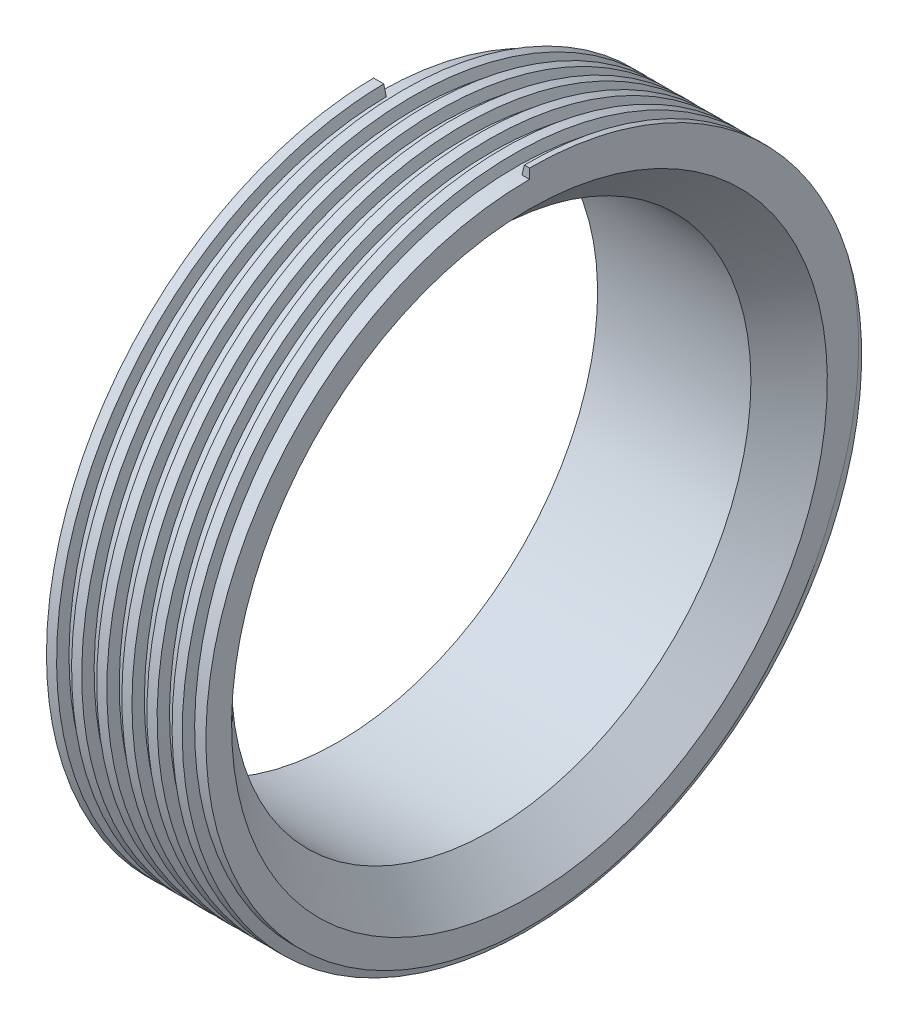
ISO-10303-21;
HEADER;
FILE_DESCRIPTION(('STEP AP214'),'2;1');
FILE_NAME('part.step','',(''),(''),'','','');
FILE_SCHEMA(('AUTOMOTIVE_DESIGN { 1 0 10303 214 1 1 1 1 }'));
ENDSEC;
DATA;
#1=APPLICATION_CONTEXT('core data for automotive mechanical design processes');
#2=APPLICATION_PROTOCOL_DEFINITION('international standard','automotive_design',2000,#1);
#3=PRODUCT_CONTEXT('',#1,'mechanical');
#4=PRODUCT('Part','Part','',(#3));
#5=PRODUCT_RELATED_PRODUCT_CATEGORY('part','',(#4));
#6=PRODUCT_DEFINITION_FORMATION('','',#4);
#7=PRODUCT_DEFINITION_CONTEXT('part definition',#1,'design');
#8=PRODUCT_DEFINITION('design','',#6,#7);
#9=PRODUCT_DEFINITION_SHAPE('','',#8);
#10=(LENGTH_UNIT() NAMED_UNIT(*) SI_UNIT(.MILLI.,.METRE.));
#11=(NAMED_UNIT(*) PLANE_ANGLE_UNIT() SI_UNIT($,.RADIAN.));
#12=(NAMED_UNIT(*) SI_UNIT($,.STERADIAN.) SOLID_ANGLE_UNIT());
#13=UNCERTAINTY_MEASURE_WITH_UNIT(LENGTH_MEASURE(1.E-05),#10,'distance_accuracy_value','');
#14=(GEOMETRIC_REPRESENTATION_CONTEXT(3) GLOBAL_UNCERTAINTY_ASSIGNED_CONTEXT((#13)) GLOBAL_UNIT_ASSIGNED_CONTEXT((#10,
#11,#12)) REPRESENTATION_CONTEXT('',''));
#15=CARTESIAN_POINT('',(0.,0.,0.));
#16=DIRECTION('',(0.,0.,1.));
#17=DIRECTION('',(1.,0.,0.));
#18=AXIS2_PLACEMENT_3D('',#15,#16,#17);
#19=CARTESIAN_POINT('',(4.7244,34.925,0.));
#20=DIRECTION('',(-1.,0.,0.));
#21=DIRECTION('',(0.,-1.,0.));
#22=AXIS2_PLACEMENT_3D('',#19,#20,#21);
#23=PLANE('',#22);
#24=DIRECTION('',(0.,-0.99999999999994,-3.47551411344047E-07));
#25=VECTOR('',#24,1.);
#26=CARTESIAN_POINT('',(4.7244,34.9249999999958,1.2138233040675E-05));
#27=LINE('',#26,#25);
#28=CARTESIAN_POINT('',(4.7244,37.5030999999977,1.30342553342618E-05));
#29=VERTEX_POINT('',#28);
#30=CARTESIAN_POINT('',(4.7244,36.804355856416,1.27914058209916E-05));
#31=VERTEX_POINT('',#30);
#32=EDGE_CURVE('E125',#29,#31,#27,.T.);
#33=ORIENTED_EDGE('',*,*,#32,.F.);
#34=CARTESIAN_POINT('',(4.7244,0.,0.));
#35=DIRECTION('',(1.,0.,0.));
#36=DIRECTION('',(0.,1.,0.));
#37=AXIS2_PLACEMENT_3D('',#34,#35,#36);
#38=CIRCLE('',#37,37.5031);
#39=CARTESIAN_POINT('',(4.7244,-12.3624586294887,35.4069502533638));
#40=VERTEX_POINT('',#39);
#41=EDGE_CURVE('E124',#40,#29,#38,.T.);
#42=ORIENTED_EDGE('',*,*,#41,.F.);
#43=CARTESIAN_POINT('',(4.72439999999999,-2.0233363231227,37.9531372));
#44=CARTESIAN_POINT('',(4.7244,-2.35428769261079,37.9195641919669));
#45=CARTESIAN_POINT('',(4.7244,-2.68479696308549,37.8816507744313));
#46=CARTESIAN_POINT('',(4.7244,-3.34463680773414,37.7971821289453));
#47=CARTESIAN_POINT('',(4.7244,-3.67396762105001,37.7506287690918));
#48=CARTESIAN_POINT('',(4.7244,-4.33194712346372,37.6488044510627));
#49=CARTESIAN_POINT('',(4.7244,-4.66059318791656,37.5935164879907));
#50=CARTESIAN_POINT('',(4.7244,-5.31637680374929,37.4743196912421));
#51=CARTESIAN_POINT('',(4.72439999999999,-5.64351401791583,37.4104090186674));
#52=CARTESIAN_POINT('',(4.72439999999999,-6.66197232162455,37.1975087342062));
#53=CARTESIAN_POINT('',(4.72439999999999,-7.35024374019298,37.0334908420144));
#54=CARTESIAN_POINT('',(4.7244,-8.37504450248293,36.7588873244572));
#55=CARTESIAN_POINT('',(4.7244,-8.71548048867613,36.6625560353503));
#56=CARTESIAN_POINT('',(4.7244,-9.3935479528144,36.4604396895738));
#57=CARTESIAN_POINT('',(4.7244,-9.73117944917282,36.3546546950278));
#58=CARTESIAN_POINT('',(4.7244,-10.4034130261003,36.1336871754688));
#59=CARTESIAN_POINT('',(4.7244,-10.7380145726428,36.0185030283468));
#60=CARTESIAN_POINT('',(4.7244,-11.403889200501,35.7788814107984));
#61=CARTESIAN_POINT('',(4.7244,-11.7351622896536,35.6544439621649));
#62=CARTESIAN_POINT('',(4.7244,-12.3942840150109,35.3959689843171));
#63=CARTESIAN_POINT('',(4.7244,-12.7221293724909,35.2619230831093));
#64=CARTESIAN_POINT('',(4.7244,-13.3738225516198,34.9844705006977));
#65=CARTESIAN_POINT('',(4.7244,-13.6976703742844,34.8410638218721));
#66=CARTESIAN_POINT('',(4.7244,-14.6626877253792,34.397022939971));
#67=CARTESIAN_POINT('',(4.72439999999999,-15.2975277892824,34.0824907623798));
#68=CARTESIAN_POINT('',(4.7244,-16.5478789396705,33.417556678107));
#69=CARTESIAN_POINT('',(4.7244,-17.1633956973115,33.0671654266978));
#70=CARTESIAN_POINT('',(4.7244,-18.1661438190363,32.4575283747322));
#71=CARTESIAN_POINT('',(4.7244,-18.5594002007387,32.2081365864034));
#72=CARTESIAN_POINT('',(4.7244,-19.3361537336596,31.6946957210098));
#73=CARTESIAN_POINT('',(4.7244,-19.7196524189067,31.4306489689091));
#74=CARTESIAN_POINT('',(4.7244,-20.476353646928,30.8882779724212));
#75=CARTESIAN_POINT('',(4.7244,-20.8495569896,30.6099548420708));
#76=CARTESIAN_POINT('',(4.7244,-21.7679076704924,29.8976609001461));
#77=CARTESIAN_POINT('',(4.7244,-22.3063850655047,29.4550459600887));
#78=CARTESIAN_POINT('',(4.7244,-23.3577535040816,28.5398229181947));
#79=CARTESIAN_POINT('',(4.7244,-23.8706298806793,28.0671979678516));
#80=CARTESIAN_POINT('',(4.7244,-24.3696543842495,27.580437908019));
#81=B_SPLINE_CURVE_WITH_KNOTS('',3,(#43,#44,#45,#46,#47,#48,#49,#50,#51,#52,#53,#54,#55,#56,#57,
#58,#59,#60,#61,#62,#63,#64,#65,#66,#67,#68,#69,#70,#71,#72,#73,#74,#75,#76,#77,#78,#79,#80),
.UNSPECIFIED.,.F.,.F.,(4,2,2,2,2,2,2,2,2,2,2,2,2,2,2,2,2,2,4),(0.,0.997917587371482,
1.99561965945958,2.99528859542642,3.99517106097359,6.11647865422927,7.17778501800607,
8.23908440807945,9.30056734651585,10.362047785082,11.4244646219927,12.4868811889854,
14.6110815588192,16.734652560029,18.1313536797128,19.5278338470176,20.9242052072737,
23.0141626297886,25.1053039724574),.UNSPECIFIED.);
#82=CARTESIAN_POINT('',(4.7244,-24.3696543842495,27.580437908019));
#83=VERTEX_POINT('',#82);
#84=EDGE_CURVE('E64',#40,#83,#81,.T.);
#85=ORIENTED_EDGE('',*,*,#84,.T.);
#86=CARTESIAN_POINT('',(4.7244,-24.3696543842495,27.580437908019));
#87=CARTESIAN_POINT('',(4.7244,-24.1034161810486,27.8156838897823));
#88=CARTESIAN_POINT('',(4.7244,-23.8337703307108,28.0470720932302));
#89=CARTESIAN_POINT('',(4.7244,-23.2879518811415,28.5018954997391));
#90=CARTESIAN_POINT('',(4.7244,-23.011780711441,28.7253324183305));
#91=CARTESIAN_POINT('',(4.7244,-22.4526021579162,29.1644968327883));
#92=CARTESIAN_POINT('',(4.7244,-22.1695837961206,29.3802103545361));
#93=CARTESIAN_POINT('',(4.7244,-21.5973521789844,29.8033832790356));
#94=CARTESIAN_POINT('',(4.7244,-21.3081375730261,30.0108408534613));
#95=CARTESIAN_POINT('',(4.7244,-20.5916712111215,30.5091917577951));
#96=CARTESIAN_POINT('',(4.7244,-20.1611410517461,30.7953911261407));
#97=CARTESIAN_POINT('',(4.72439999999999,-19.2883916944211,31.3494140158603));
#98=CARTESIAN_POINT('',(4.7244,-18.8461717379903,31.6172363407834));
#99=CARTESIAN_POINT('',(4.7244,-17.9506869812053,32.1341058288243));
#100=CARTESIAN_POINT('',(4.7244,-17.4974186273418,32.3831468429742));
#101=CARTESIAN_POINT('',(4.7244,-16.5807222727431,32.8619506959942));
#102=CARTESIAN_POINT('',(4.7244,-16.1172920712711,33.0917093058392));
#103=CARTESIAN_POINT('',(4.7244,-14.7121250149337,33.751820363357));
#104=CARTESIAN_POINT('',(4.7244,-13.756278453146,34.1525655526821));
#105=CARTESIAN_POINT('',(4.72439999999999,-11.8141842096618,34.8720233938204));
#106=CARTESIAN_POINT('',(4.72439999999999,-10.8279361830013,35.1907351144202));
#107=CARTESIAN_POINT('',(4.72439999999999,-9.33152021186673,35.6054966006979));
#108=CARTESIAN_POINT('',(4.7244,-8.82993481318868,35.7331880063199));
#109=CARTESIAN_POINT('',(4.7244,-7.82192757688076,35.9672856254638));
#110=CARTESIAN_POINT('',(4.7244,-7.31550702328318,36.0736973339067));
#111=CARTESIAN_POINT('',(4.7244,-6.29856534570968,36.2650853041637));
#112=CARTESIAN_POINT('',(4.7244,-5.78804371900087,36.350058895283));
#113=CARTESIAN_POINT('',(4.7244,-4.76387062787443,36.4984108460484));
#114=CARTESIAN_POINT('',(4.7244,-4.25021895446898,36.5617877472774));
#115=CARTESIAN_POINT('',(4.7244,-2.70630985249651,36.7192863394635));
#116=CARTESIAN_POINT('',(4.7244,-1.67253495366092,36.7808818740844));
#117=CARTESIAN_POINT('',(4.72439999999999,0.396380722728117,36.8167666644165));
#118=CARTESIAN_POINT('',(4.72439999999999,1.43152149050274,36.7910565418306));
#119=CARTESIAN_POINT('',(4.72439999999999,3.49612631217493,36.6525321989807));
#120=CARTESIAN_POINT('',(4.72439999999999,4.5255896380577,36.53970705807));
#121=CARTESIAN_POINT('',(4.7244,6.5713441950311,36.2277341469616));
#122=CARTESIAN_POINT('',(4.7244,7.58763540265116,36.0285862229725));
#123=CARTESIAN_POINT('',(4.7244,9.59987121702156,35.5453759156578));
#124=CARTESIAN_POINT('',(4.72439999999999,10.595815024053,35.2613102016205));
#125=CARTESIAN_POINT('',(4.7244,12.5602302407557,34.610286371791));
#126=CARTESIAN_POINT('',(4.7244,13.5287016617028,34.2433282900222));
#127=CARTESIAN_POINT('',(4.7244,15.4312788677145,33.4291326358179));
#128=CARTESIAN_POINT('',(4.7244,16.3653849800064,32.9818958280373));
#129=CARTESIAN_POINT('',(4.7244,18.192600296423,32.0103198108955));
#130=CARTESIAN_POINT('',(4.7244,19.0857094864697,31.4859805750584));
#131=CARTESIAN_POINT('',(4.7244,20.8245634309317,30.3639390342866));
#132=CARTESIAN_POINT('',(4.72439999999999,21.6703091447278,29.7662382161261));
#133=CARTESIAN_POINT('',(4.7244,23.3084419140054,28.5017151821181));
#134=CARTESIAN_POINT('',(4.7244,24.1008290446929,27.8348930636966));
#135=CARTESIAN_POINT('',(4.7244,25.6265479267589,26.4369266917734));
#136=CARTESIAN_POINT('',(4.7244,26.3598846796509,25.7057878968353));
#137=CARTESIAN_POINT('',(4.7244,27.762369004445,24.1843323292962));
#138=CARTESIAN_POINT('',(4.7244,28.431516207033,23.3940152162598));
#139=CARTESIAN_POINT('',(4.7244,29.7009841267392,21.759665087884));
#140=CARTESIAN_POINT('',(4.72439999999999,30.3012913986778,20.9156216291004));
#141=CARTESIAN_POINT('',(4.7244,31.4286466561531,19.1799789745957));
#142=CARTESIAN_POINT('',(4.7244,31.9556963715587,18.2883809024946));
#143=CARTESIAN_POINT('',(4.7244,32.9329997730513,16.4635910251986));
#144=CARTESIAN_POINT('',(4.7244,33.3832228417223,15.5303828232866));
#145=CARTESIAN_POINT('',(4.7244,34.2034547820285,13.6292373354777));
#146=CARTESIAN_POINT('',(4.7244,34.5734558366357,12.6612966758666));
#147=CARTESIAN_POINT('',(4.7244,35.230249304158,10.6986089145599));
#148=CARTESIAN_POINT('',(4.72439999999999,35.5171173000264,9.70388706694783));
#149=CARTESIAN_POINT('',(4.7244,36.0059846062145,7.69405344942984));
#150=CARTESIAN_POINT('',(4.7244,36.2080163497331,6.67894962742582));
#151=CARTESIAN_POINT('',(4.7244,36.4397805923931,5.18920020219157));
#152=CARTESIAN_POINT('',(4.7244,36.5035662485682,4.71962777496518));
#153=CARTESIAN_POINT('',(4.72439999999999,36.6129493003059,3.77846578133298));
#154=CARTESIAN_POINT('',(4.72439999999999,36.6585510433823,3.30687672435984));
#155=CARTESIAN_POINT('',(4.7244,36.7678759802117,1.89172094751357));
#156=CARTESIAN_POINT('',(4.7244,36.804396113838,0.945980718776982));
#157=CARTESIAN_POINT('',(4.72439999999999,36.804355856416,1.27914058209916E-05));
#158=B_SPLINE_CURVE_WITH_KNOTS('',3,(#86,#87,#88,#89,#90,#91,#92,#93,#94,#95,#96,#97,#98,#99,
#100,#101,#102,#103,#104,#105,#106,#107,#108,#109,#110,#111,#112,#113,#114,#115,#116,#117,#118,
#119,#120,#121,#122,#123,#124,#125,#126,#127,#128,#129,#130,#131,#132,#133,#134,#135,#136,#137,
#138,#139,#140,#141,#142,#143,#144,#145,#146,#147,#148,#149,#150,#151,#152,#153,#154,#155,#156,
#157),.UNSPECIFIED.,.F.,.F.,(4,2,2,2,2,2,2,2,2,2,2,2,2,2,2,2,2,2,2,2,2,2,2,2,2,2,2,2,2,2,2,2,2,
2,2,4),(0.,1.06579944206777,2.13136752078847,3.19877502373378,4.26641760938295,5.81686540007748,
7.36741403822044,8.91846813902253,10.4698615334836,13.5752955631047,16.6807648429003,
18.2331308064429,19.7850953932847,21.3372532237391,22.8895158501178,25.9923267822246,
29.0951156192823,32.1982934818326,35.3014768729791,38.4047819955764,41.5080858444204,
44.6113601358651,47.7146354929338,50.8178479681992,53.9210560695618,57.0240010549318,
60.1269638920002,63.2305317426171,66.3340262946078,69.4387547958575,72.5437856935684,
75.6459846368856,78.7469965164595,80.1683651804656,81.5893938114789,84.426047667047),.UNSPECIFIED.);
#159=EDGE_CURVE('E159',#83,#31,#158,.T.);
#160=ORIENTED_EDGE('',*,*,#159,.T.);
#161=EDGE_LOOP('',(#33,#42,#85,#160));
#162=FACE_BOUND('',#161,.T.);
#163=CARTESIAN_POINT('',(4.7244,0.,0.));
#164=DIRECTION('',(1.,0.,0.));
#165=DIRECTION('',(0.,1.,0.));
#166=AXIS2_PLACEMENT_3D('',#163,#164,#165);
#167=CIRCLE('',#166,34.925);
#168=CARTESIAN_POINT('',(4.7244,34.925,0.));
#169=VERTEX_POINT('',#168);
#170=EDGE_CURVE('E128',#169,#169,#167,.T.);
#171=ORIENTED_EDGE('',*,*,#170,.T.);
#172=EDGE_LOOP('',(#171));
#173=FACE_BOUND('',#172,.T.);
#174=ADVANCED_FACE('F34',(#162,#173),#23,.T.);
#175=CARTESIAN_POINT('',(0.,0.,0.));
#176=DIRECTION('',(-1.,0.,0.));
#177=DIRECTION('',(0.,-1.,0.));
#178=AXIS2_PLACEMENT_3D('',#175,#176,#177);
#179=PLANE('',#178);
#180=CARTESIAN_POINT('',(0.,0.,0.));
#181=DIRECTION('',(-1.,0.,0.));
#182=DIRECTION('',(0.,-1.,0.));
#183=AXIS2_PLACEMENT_3D('',#180,#181,#182);
#184=CIRCLE('',#183,30.099);
#185=CARTESIAN_POINT('',(0.,-30.099,0.));
#186=VERTEX_POINT('',#185);
#187=EDGE_CURVE('E111',#186,#186,#184,.T.);
#188=ORIENTED_EDGE('',*,*,#187,.F.);
#189=EDGE_LOOP('',(#188));
#190=FACE_BOUND('',#189,.T.);
#191=CARTESIAN_POINT('',(0.,0.,0.));
#192=DIRECTION('',(1.,0.,0.));
#193=DIRECTION('',(0.,1.,0.));
#194=AXIS2_PLACEMENT_3D('',#191,#192,#193);
#195=CIRCLE('',#194,31.75);
#196=CARTESIAN_POINT('',(0.,31.75,0.));
#197=VERTEX_POINT('',#196);
#198=EDGE_CURVE('E137',#197,#197,#195,.T.);
#199=ORIENTED_EDGE('',*,*,#198,.F.);
#200=EDGE_LOOP('',(#199));
#201=FACE_BOUND('',#200,.T.);
#202=ADVANCED_FACE('F238',(#190,#201),#179,.T.);
#203=CARTESIAN_POINT('',(22.1996,0.,0.));
#204=DIRECTION('',(1.,0.,0.));
#205=DIRECTION('',(0.,1.,0.));
#206=AXIS2_PLACEMENT_3D('',#203,#204,#205);
#207=CYLINDRICAL_SURFACE('',#206,31.75);
#208=ORIENTED_EDGE('',*,*,#198,.T.);
#209=EDGE_LOOP('',(#208));
#210=FACE_BOUND('',#209,.T.);
#211=CARTESIAN_POINT('',(1.5494,0.,0.));
#212=DIRECTION('',(1.,0.,0.));
#213=DIRECTION('',(0.,1.,0.));
#214=AXIS2_PLACEMENT_3D('',#211,#212,#213);
#215=CIRCLE('',#214,31.75);
#216=CARTESIAN_POINT('',(1.5494,31.75,0.));
#217=VERTEX_POINT('',#216);
#218=EDGE_CURVE('E134',#217,#217,#215,.T.);
#219=ORIENTED_EDGE('',*,*,#218,.F.);
#220=EDGE_LOOP('',(#219));
#221=FACE_BOUND('',#220,.T.);
#222=ADVANCED_FACE('F243',(#210,#221),#207,.T.);
#223=CARTESIAN_POINT('',(1.5494,0.,0.));
#224=DIRECTION('',(1.,0.,0.));
#225=DIRECTION('',(0.,1.,0.));
#226=AXIS2_PLACEMENT_3D('',#223,#224,#225);
#227=TOROIDAL_SURFACE('',#226,34.925,3.175);
#228=ORIENTED_EDGE('',*,*,#218,.T.);
#229=EDGE_LOOP('',(#228));
#230=FACE_BOUND('',#229,.T.);
#231=ORIENTED_EDGE('',*,*,#170,.F.);
#232=EDGE_LOOP('',(#231));
#233=FACE_BOUND('',#232,.T.);
#234=ADVANCED_FACE('F249',(#230,#233),#227,.F.);
#235=CARTESIAN_POINT('',(4.7244,0.,0.));
#236=DIRECTION('',(1.,0.,0.));
#237=DIRECTION('',(0.,1.,0.));
#238=AXIS2_PLACEMENT_3D('',#235,#236,#237);
#239=CYLINDRICAL_SURFACE('',#238,37.5031);
#240=DIRECTION('',(1.,0.,0.));
#241=VECTOR('',#240,1.);
#242=CARTESIAN_POINT('',(4.7244,37.5030999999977,1.30342553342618E-05));
#243=LINE('',#242,#241);
#244=CARTESIAN_POINT('',(5.60794675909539,37.5030999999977,1.30342553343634E-05));
#245=VERTEX_POINT('',#244);
#246=EDGE_CURVE('E56',#245,#29,#243,.F.);
#247=ORIENTED_EDGE('',*,*,#246,.F.);
#248=CARTESIAN_POINT('',(23.0831467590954,37.5030999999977,1.30342553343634E-05));
#249=CARTESIAN_POINT('',(22.9375200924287,37.503104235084,-12.1854828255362));
#250=CARTESIAN_POINT('',(22.7918934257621,30.3406529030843,-22.0437585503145));
#251=CARTESIAN_POINT('',(22.6462667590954,23.1782015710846,-31.9020342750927));
#252=CARTESIAN_POINT('',(22.5006400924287,11.5891076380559,-35.6675636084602));
#253=CARTESIAN_POINT('',(22.3550134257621,1.37050271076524E-05,-39.4330929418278));
#254=CARTESIAN_POINT('',(22.2093867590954,-11.5890828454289,-35.667571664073));
#255=CARTESIAN_POINT('',(22.0637600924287,-23.1781793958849,-31.9020503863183));
#256=CARTESIAN_POINT('',(21.9181334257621,-30.3406375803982,-22.0437796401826));
#257=CARTESIAN_POINT('',(21.7725067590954,-37.5030957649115,-12.1855088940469));
#258=CARTESIAN_POINT('',(21.6268800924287,-37.5030999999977,-1.30342553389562E-05));
#259=CARTESIAN_POINT('',(21.4812534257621,-37.503104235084,12.1854828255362));
#260=CARTESIAN_POINT('',(21.3356267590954,-30.3406529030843,22.0437585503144));
#261=CARTESIAN_POINT('',(21.1900000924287,-23.1782015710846,31.9020342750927));
#262=CARTESIAN_POINT('',(21.0443734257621,-11.5891076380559,35.6675636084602));
#263=CARTESIAN_POINT('',(20.8987467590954,-1.3705027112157E-05,39.4330929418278));
#264=CARTESIAN_POINT('',(20.7531200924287,11.5890828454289,35.667571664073));
#265=CARTESIAN_POINT('',(20.6074934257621,23.1781793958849,31.9020503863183));
#266=CARTESIAN_POINT('',(20.4618667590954,30.3406375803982,22.0437796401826));
#267=CARTESIAN_POINT('',(20.3162400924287,37.5030957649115,12.1855088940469));
#268=CARTESIAN_POINT('',(20.1706134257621,37.5030999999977,1.30342553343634E-05));
#269=CARTESIAN_POINT('',(20.0249867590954,37.503104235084,-12.1854828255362));
#270=CARTESIAN_POINT('',(19.8793600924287,30.3406529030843,-22.0437585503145));
#271=CARTESIAN_POINT('',(19.7337334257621,23.1782015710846,-31.9020342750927));
#272=CARTESIAN_POINT('',(19.5881067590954,11.5891076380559,-35.6675636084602));
#273=CARTESIAN_POINT('',(19.4424800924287,1.37050271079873E-05,-39.4330929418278));
#274=CARTESIAN_POINT('',(19.2968534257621,-11.5890828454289,-35.667571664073));
#275=CARTESIAN_POINT('',(19.1512267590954,-23.1781793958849,-31.9020503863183));
#276=CARTESIAN_POINT('',(19.0056000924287,-30.3406375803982,-22.0437796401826));
#277=CARTESIAN_POINT('',(18.8599734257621,-37.5030957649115,-12.1855088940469));
#278=CARTESIAN_POINT('',(18.7143467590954,-37.5030999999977,-1.30342553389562E-05));
#279=CARTESIAN_POINT('',(18.5687200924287,-37.503104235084,12.1854828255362));
#280=CARTESIAN_POINT('',(18.4230934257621,-30.3406529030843,22.0437585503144));
#281=CARTESIAN_POINT('',(18.2774667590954,-23.1782015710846,31.9020342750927));
#282=CARTESIAN_POINT('',(18.1318400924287,-11.5891076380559,35.6675636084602));
#283=CARTESIAN_POINT('',(17.9862134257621,-1.37050271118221E-05,39.4330929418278));
#284=CARTESIAN_POINT('',(17.8405867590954,11.5890828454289,35.667571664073));
#285=CARTESIAN_POINT('',(17.6949600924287,23.1781793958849,31.9020503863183));
#286=CARTESIAN_POINT('',(17.5493334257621,30.3406375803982,22.0437796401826));
#287=CARTESIAN_POINT('',(17.4037067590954,37.5030957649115,12.1855088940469));
#288=CARTESIAN_POINT('',(17.2580800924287,37.5030999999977,1.30342553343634E-05));
#289=CARTESIAN_POINT('',(17.1124534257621,37.503104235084,-12.1854828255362));
#290=CARTESIAN_POINT('',(16.9668267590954,30.3406529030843,-22.0437585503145));
#291=CARTESIAN_POINT('',(16.8212000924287,23.1782015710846,-31.9020342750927));
#292=CARTESIAN_POINT('',(16.6755734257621,11.5891076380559,-35.6675636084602));
#293=CARTESIAN_POINT('',(16.5299467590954,1.37050271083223E-05,-39.4330929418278));
#294=CARTESIAN_POINT('',(16.3843200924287,-11.5890828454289,-35.667571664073));
#295=CARTESIAN_POINT('',(16.2386934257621,-23.1781793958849,-31.9020503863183));
#296=CARTESIAN_POINT('',(16.0930667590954,-30.3406375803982,-22.0437796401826));
#297=CARTESIAN_POINT('',(15.9474400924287,-37.5030957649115,-12.1855088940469));
#298=CARTESIAN_POINT('',(15.801813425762,-37.5030999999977,-1.30342553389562E-05));
#299=CARTESIAN_POINT('',(15.6561867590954,-37.503104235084,12.1854828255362));
#300=CARTESIAN_POINT('',(15.5105600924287,-30.3406529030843,22.0437585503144));
#301=CARTESIAN_POINT('',(15.3649334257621,-23.1782015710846,31.9020342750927));
#302=CARTESIAN_POINT('',(15.2193067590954,-11.5891076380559,35.6675636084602));
#303=CARTESIAN_POINT('',(15.0736800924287,-1.37050271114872E-05,39.4330929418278));
#304=CARTESIAN_POINT('',(14.9280534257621,11.5890828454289,35.667571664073));
#305=CARTESIAN_POINT('',(14.7824267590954,23.1781793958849,31.9020503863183));
#306=CARTESIAN_POINT('',(14.6368000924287,30.3406375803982,22.0437796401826));
#307=CARTESIAN_POINT('',(14.4911734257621,37.5030957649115,12.1855088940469));
#308=CARTESIAN_POINT('',(14.3455467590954,37.5030999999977,1.30342553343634E-05));
#309=CARTESIAN_POINT('',(14.1999200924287,37.503104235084,-12.1854828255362));
#310=CARTESIAN_POINT('',(14.0542934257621,30.3406529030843,-22.0437585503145));
#311=CARTESIAN_POINT('',(13.9086667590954,23.1782015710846,-31.9020342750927));
#312=CARTESIAN_POINT('',(13.7630400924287,11.5891076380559,-35.6675636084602));
#313=CARTESIAN_POINT('',(13.6174134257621,1.37050271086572E-05,-39.4330929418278));
#314=CARTESIAN_POINT('',(13.4717867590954,-11.5890828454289,-35.667571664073));
#315=CARTESIAN_POINT('',(13.3261600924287,-23.1781793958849,-31.9020503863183));
#316=CARTESIAN_POINT('',(13.1805334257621,-30.3406375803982,-22.0437796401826));
#317=CARTESIAN_POINT('',(13.0349067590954,-37.5030957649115,-12.1855088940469));
#318=CARTESIAN_POINT('',(12.8892800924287,-37.5030999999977,-1.30342553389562E-05));
#319=CARTESIAN_POINT('',(12.7436534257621,-37.503104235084,12.1854828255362));
#320=CARTESIAN_POINT('',(12.5980267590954,-30.3406529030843,22.0437585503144));
#321=CARTESIAN_POINT('',(12.4524000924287,-23.1782015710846,31.9020342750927));
#322=CARTESIAN_POINT('',(12.3067734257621,-11.5891076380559,35.6675636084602));
#323=CARTESIAN_POINT('',(12.1611467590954,-1.37050271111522E-05,39.4330929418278));
#324=CARTESIAN_POINT('',(12.0155200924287,11.5890828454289,35.667571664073));
#325=CARTESIAN_POINT('',(11.8698934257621,23.1781793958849,31.9020503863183));
#326=CARTESIAN_POINT('',(11.7242667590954,30.3406375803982,22.0437796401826));
#327=CARTESIAN_POINT('',(11.5786400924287,37.5030957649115,12.1855088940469));
#328=CARTESIAN_POINT('',(11.4330134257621,37.5030999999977,1.30342553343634E-05));
#329=CARTESIAN_POINT('',(11.2873867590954,37.503104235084,-12.1854828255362));
#330=CARTESIAN_POINT('',(11.1417600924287,30.3406529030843,-22.0437585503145));
#331=CARTESIAN_POINT('',(10.9961334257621,23.1782015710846,-31.9020342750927));
#332=CARTESIAN_POINT('',(10.8505067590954,11.5891076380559,-35.6675636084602));
#333=CARTESIAN_POINT('',(10.7048800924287,1.37050271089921E-05,-39.4330929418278));
#334=CARTESIAN_POINT('',(10.5592534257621,-11.5890828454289,-35.667571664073));
#335=CARTESIAN_POINT('',(10.4136267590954,-23.1781793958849,-31.9020503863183));
#336=CARTESIAN_POINT('',(10.2680000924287,-30.3406375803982,-22.0437796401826));
#337=CARTESIAN_POINT('',(10.1223734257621,-37.5030957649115,-12.1855088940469));
#338=CARTESIAN_POINT('',(9.97674675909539,-37.5030999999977,-1.30342553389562E-05));
#339=CARTESIAN_POINT('',(9.83112009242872,-37.503104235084,12.1854828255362));
#340=CARTESIAN_POINT('',(9.68549342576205,-30.3406529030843,22.0437585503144));
#341=CARTESIAN_POINT('',(9.53986675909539,-23.1782015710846,31.9020342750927));
#342=CARTESIAN_POINT('',(9.39424009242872,-11.5891076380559,35.6675636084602));
#343=CARTESIAN_POINT('',(9.24861342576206,-1.37050271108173E-05,39.4330929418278));
#344=CARTESIAN_POINT('',(9.10298675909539,11.5890828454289,35.667571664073));
#345=CARTESIAN_POINT('',(8.95736009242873,23.1781793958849,31.9020503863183));
#346=CARTESIAN_POINT('',(8.81173342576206,30.3406375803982,22.0437796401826));
#347=CARTESIAN_POINT('',(8.66610675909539,37.5030957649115,12.1855088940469));
#348=CARTESIAN_POINT('',(8.52048009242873,37.5030999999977,1.30342553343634E-05));
#349=CARTESIAN_POINT('',(8.37485342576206,37.503104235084,-12.1854828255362));
#350=CARTESIAN_POINT('',(8.22922675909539,30.3406529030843,-22.0437585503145));
#351=CARTESIAN_POINT('',(8.08360009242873,23.1782015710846,-31.9020342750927));
#352=CARTESIAN_POINT('',(7.93797342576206,11.5891076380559,-35.6675636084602));
#353=CARTESIAN_POINT('',(7.79234675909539,1.37050271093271E-05,-39.4330929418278));
#354=CARTESIAN_POINT('',(7.64672009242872,-11.5890828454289,-35.667571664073));
#355=CARTESIAN_POINT('',(7.50109342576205,-23.1781793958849,-31.9020503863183));
#356=CARTESIAN_POINT('',(7.35546675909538,-30.3406375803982,-22.0437796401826));
#357=CARTESIAN_POINT('',(7.20984009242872,-37.5030957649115,-12.1855088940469));
#358=CARTESIAN_POINT('',(7.06421342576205,-37.5030999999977,-1.30342553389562E-05));
#359=CARTESIAN_POINT('',(6.91858675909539,-37.503104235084,12.1854828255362));
#360=CARTESIAN_POINT('',(6.77296009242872,-30.3406529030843,22.0437585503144));
#361=CARTESIAN_POINT('',(6.62733342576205,-23.1782015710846,31.9020342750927));
#362=CARTESIAN_POINT('',(6.48170675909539,-11.5891076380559,35.6675636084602));
#363=CARTESIAN_POINT('',(6.33608009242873,-1.37050271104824E-05,39.4330929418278));
#364=CARTESIAN_POINT('',(6.19045342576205,11.5890828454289,35.667571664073));
#365=CARTESIAN_POINT('',(6.04482675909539,23.1781793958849,31.9020503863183));
#366=CARTESIAN_POINT('',(5.89920009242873,30.3406375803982,22.0437796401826));
#367=CARTESIAN_POINT('',(5.75357342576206,37.5030957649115,12.1855088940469));
#368=CARTESIAN_POINT('',(5.60794675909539,37.5030999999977,1.30342553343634E-05));
#369=(BOUNDED_CURVE() B_SPLINE_CURVE(2,(#248,#249,#250,#251,#252,#253,#254,#255,#256,#257,#258,
#259,#260,#261,#262,#263,#264,#265,#266,#267,#268,#269,#270,#271,#272,#273,#274,#275,#276,#277,
#278,#279,#280,#281,#282,#283,#284,#285,#286,#287,#288,#289,#290,#291,#292,#293,#294,#295,#296,
#297,#298,#299,#300,#301,#302,#303,#304,#305,#306,#307,#308,#309,#310,#311,#312,#313,#314,#315,
#316,#317,#318,#319,#320,#321,#322,#323,#324,#325,#326,#327,#328,#329,#330,#331,#332,#333,#334,
#335,#336,#337,#338,#339,#340,#341,#342,#343,#344,#345,#346,#347,#348,#349,#350,#351,#352,#353,
#354,#355,#356,#357,#358,#359,#360,#361,#362,#363,#364,#365,#366,#367,#368),.UNSPECIFIED.,.F.,
.F.) B_SPLINE_CURVE_WITH_KNOTS((3,2,2,2,2,2,2,2,2,2,2,2,2,2,2,2,2,2,2,2,2,2,2,2,2,2,2,2,2,2,2,2,
2,2,2,2,2,2,2,2,2,2,2,2,2,2,2,2,2,2,2,2,2,2,2,2,2,2,2,2,3),(0.,0.0166666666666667,
0.0333333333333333,0.05,0.0666666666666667,0.0833333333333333,0.1,0.116666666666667,
0.133333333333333,0.15,0.166666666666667,0.183333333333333,0.2,0.216666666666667,
0.233333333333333,0.25,0.266666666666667,0.283333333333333,0.3,0.316666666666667,
0.333333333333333,0.35,0.366666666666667,0.383333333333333,0.4,0.416666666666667,
0.433333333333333,0.45,0.466666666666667,0.483333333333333,0.5,0.516666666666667,
0.533333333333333,0.55,0.566666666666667,0.583333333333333,0.6,0.616666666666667,
0.633333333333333,0.65,0.666666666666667,0.683333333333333,0.7,0.716666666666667,
0.733333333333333,0.75,0.766666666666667,0.783333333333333,0.8,0.816666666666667,
0.833333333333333,0.85,0.866666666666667,0.883333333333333,0.9,0.916666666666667,
0.933333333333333,0.95,0.966666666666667,0.983333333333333,1.),
.UNSPECIFIED.) CURVE() GEOMETRIC_REPRESENTATION_ITEM() RATIONAL_B_SPLINE_CURVE((1.,
0.951056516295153,1.,0.951056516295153,1.,0.951056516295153,1.,0.951056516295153,1.,
0.951056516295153,1.,0.951056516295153,1.,0.951056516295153,1.,0.951056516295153,1.,
0.951056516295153,1.,0.951056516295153,1.,0.951056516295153,1.,0.951056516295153,1.,
0.951056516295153,1.,0.951056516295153,1.,0.951056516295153,1.,0.951056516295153,1.,
0.951056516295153,1.,0.951056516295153,1.,0.951056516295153,1.,0.951056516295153,1.,
0.951056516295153,1.,0.951056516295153,1.,0.951056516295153,1.,0.951056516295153,1.,
0.951056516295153,1.,0.951056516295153,1.,0.951056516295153,1.,0.951056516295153,1.,
0.951056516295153,1.,0.951056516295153,1.,0.951056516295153,1.,0.951056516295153,1.,
0.951056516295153,1.,0.951056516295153,1.,0.951056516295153,1.,0.951056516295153,1.,
0.951056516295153,1.,0.951056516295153,1.,0.951056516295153,1.,0.951056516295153,1.,
0.951056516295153,1.,0.951056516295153,1.,0.951056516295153,1.,0.951056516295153,1.,
0.951056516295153,1.,0.951056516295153,1.,0.951056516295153,1.,0.951056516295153,1.,
0.951056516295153,1.,0.951056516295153,1.,0.951056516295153,1.,0.951056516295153,1.,
0.951056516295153,1.,0.951056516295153,1.,0.951056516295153,1.,0.951056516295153,1.,
0.951056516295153,1.,0.951056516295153,1.,0.951056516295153,1.,0.951056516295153,1.)) REPRESENTATION_ITEM(''));
#370=CARTESIAN_POINT('',(22.1996,-12.3624340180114,-35.4069588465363));
#371=VERTEX_POINT('',#370);
#372=EDGE_CURVE('E120',#371,#245,#369,.T.);
#373=ORIENTED_EDGE('',*,*,#372,.F.);
#374=CARTESIAN_POINT('',(22.1996,0.,0.));
#375=DIRECTION('',(1.,0.,0.));
#376=DIRECTION('',(0.,1.,0.));
#377=AXIS2_PLACEMENT_3D('',#374,#375,#376);
#378=CIRCLE('',#377,37.5031);
#379=CARTESIAN_POINT('',(22.1996,37.5030999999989,1.30342553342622E-05));
#380=VERTEX_POINT('',#379);
#381=EDGE_CURVE('E105',#380,#371,#378,.T.);
#382=ORIENTED_EDGE('',*,*,#381,.F.);
#383=DIRECTION('',(1.,0.,0.));
#384=VECTOR('',#383,1.);
#385=CARTESIAN_POINT('',(4.7244,37.5030999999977,1.30342553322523E-05));
#386=LINE('',#385,#384);
#387=CARTESIAN_POINT('',(21.3160532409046,37.5030999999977,1.30342553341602E-05));
#388=VERTEX_POINT('',#387);
#389=EDGE_CURVE('E115',#388,#380,#386,.T.);
#390=ORIENTED_EDGE('',*,*,#389,.F.);
#391=CARTESIAN_POINT('',(21.3160532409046,37.5030999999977,1.30342553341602E-05));
#392=CARTESIAN_POINT('',(21.1704265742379,37.503104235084,-12.1854828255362));
#393=CARTESIAN_POINT('',(21.0247999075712,30.3406529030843,-22.0437585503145));
#394=CARTESIAN_POINT('',(20.8791732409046,23.1782015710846,-31.9020342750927));
#395=CARTESIAN_POINT('',(20.7335465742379,11.5891076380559,-35.6675636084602));
#396=CARTESIAN_POINT('',(20.5879199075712,1.3705027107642E-05,-39.4330929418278));
#397=CARTESIAN_POINT('',(20.4422932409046,-11.5890828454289,-35.667571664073));
#398=CARTESIAN_POINT('',(20.2966665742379,-23.178179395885,-31.9020503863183));
#399=CARTESIAN_POINT('',(20.1510399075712,-30.3406375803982,-22.0437796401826));
#400=CARTESIAN_POINT('',(20.0054132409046,-37.5030957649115,-12.1855088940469));
#401=CARTESIAN_POINT('',(19.8597865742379,-37.5030999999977,-1.3034255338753E-05));
#402=CARTESIAN_POINT('',(19.7141599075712,-37.503104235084,12.1854828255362));
#403=CARTESIAN_POINT('',(19.5685332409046,-30.3406529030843,22.0437585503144));
#404=CARTESIAN_POINT('',(19.4229065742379,-23.1782015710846,31.9020342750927));
#405=CARTESIAN_POINT('',(19.2772799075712,-11.5891076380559,35.6675636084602));
#406=CARTESIAN_POINT('',(19.1316532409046,-1.37050271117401E-05,39.4330929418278));
#407=CARTESIAN_POINT('',(18.9860265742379,11.5890828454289,35.667571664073));
#408=CARTESIAN_POINT('',(18.8403999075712,23.1781793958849,31.9020503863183));
#409=CARTESIAN_POINT('',(18.6947732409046,30.3406375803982,22.0437796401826));
#410=CARTESIAN_POINT('',(18.5491465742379,37.5030957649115,12.1855088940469));
#411=CARTESIAN_POINT('',(18.4035199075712,37.5030999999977,1.30342553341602E-05));
#412=CARTESIAN_POINT('',(18.2578932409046,37.503104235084,-12.1854828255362));
#413=CARTESIAN_POINT('',(18.1122665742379,30.3406529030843,-22.0437585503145));
#414=CARTESIAN_POINT('',(17.9666399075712,23.1782015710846,-31.9020342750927));
#415=CARTESIAN_POINT('',(17.8210132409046,11.5891076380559,-35.6675636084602));
#416=CARTESIAN_POINT('',(17.6753865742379,1.37050271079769E-05,-39.4330929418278));
#417=CARTESIAN_POINT('',(17.5297599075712,-11.5890828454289,-35.667571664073));
#418=CARTESIAN_POINT('',(17.3841332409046,-23.178179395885,-31.9020503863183));
#419=CARTESIAN_POINT('',(17.2385065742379,-30.3406375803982,-22.0437796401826));
#420=CARTESIAN_POINT('',(17.0928799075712,-37.5030957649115,-12.1855088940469));
#421=CARTESIAN_POINT('',(16.9472532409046,-37.5030999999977,-1.3034255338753E-05));
#422=CARTESIAN_POINT('',(16.8016265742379,-37.503104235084,12.1854828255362));
#423=CARTESIAN_POINT('',(16.6559999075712,-30.3406529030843,22.0437585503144));
#424=CARTESIAN_POINT('',(16.5103732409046,-23.1782015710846,31.9020342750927));
#425=CARTESIAN_POINT('',(16.3647465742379,-11.5891076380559,35.6675636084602));
#426=CARTESIAN_POINT('',(16.2191199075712,-1.37050271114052E-05,39.4330929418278));
#427=CARTESIAN_POINT('',(16.0734932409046,11.5890828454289,35.667571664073));
#428=CARTESIAN_POINT('',(15.9278665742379,23.1781793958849,31.9020503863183));
#429=CARTESIAN_POINT('',(15.7822399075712,30.3406375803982,22.0437796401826));
#430=CARTESIAN_POINT('',(15.6366132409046,37.5030957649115,12.1855088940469));
#431=CARTESIAN_POINT('',(15.4909865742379,37.5030999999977,1.30342553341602E-05));
#432=CARTESIAN_POINT('',(15.3453599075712,37.503104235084,-12.1854828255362));
#433=CARTESIAN_POINT('',(15.1997332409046,30.3406529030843,-22.0437585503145));
#434=CARTESIAN_POINT('',(15.0541065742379,23.1782015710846,-31.9020342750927));
#435=CARTESIAN_POINT('',(14.9084799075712,11.5891076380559,-35.6675636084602));
#436=CARTESIAN_POINT('',(14.7628532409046,1.37050271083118E-05,-39.4330929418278));
#437=CARTESIAN_POINT('',(14.6172265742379,-11.5890828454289,-35.667571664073));
#438=CARTESIAN_POINT('',(14.4715999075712,-23.178179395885,-31.9020503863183));
#439=CARTESIAN_POINT('',(14.3259732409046,-30.3406375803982,-22.0437796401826));
#440=CARTESIAN_POINT('',(14.1803465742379,-37.5030957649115,-12.1855088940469));
#441=CARTESIAN_POINT('',(14.0347199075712,-37.5030999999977,-1.3034255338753E-05));
#442=CARTESIAN_POINT('',(13.8890932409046,-37.503104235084,12.1854828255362));
#443=CARTESIAN_POINT('',(13.7434665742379,-30.3406529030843,22.0437585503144));
#444=CARTESIAN_POINT('',(13.5978399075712,-23.1782015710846,31.9020342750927));
#445=CARTESIAN_POINT('',(13.4522132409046,-11.5891076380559,35.6675636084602));
#446=CARTESIAN_POINT('',(13.3065865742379,-1.37050271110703E-05,39.4330929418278));
#447=CARTESIAN_POINT('',(13.1609599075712,11.5890828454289,35.667571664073));
#448=CARTESIAN_POINT('',(13.0153332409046,23.1781793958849,31.9020503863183));
#449=CARTESIAN_POINT('',(12.8697065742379,30.3406375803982,22.0437796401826));
#450=CARTESIAN_POINT('',(12.7240799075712,37.5030957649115,12.1855088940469));
#451=CARTESIAN_POINT('',(12.5784532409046,37.5030999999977,1.30342553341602E-05));
#452=CARTESIAN_POINT('',(12.4328265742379,37.503104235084,-12.1854828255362));
#453=CARTESIAN_POINT('',(12.2871999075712,30.3406529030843,-22.0437585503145));
#454=CARTESIAN_POINT('',(12.1415732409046,23.1782015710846,-31.9020342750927));
#455=CARTESIAN_POINT('',(11.9959465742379,11.5891076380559,-35.6675636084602));
#456=CARTESIAN_POINT('',(11.8503199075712,1.37050271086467E-05,-39.4330929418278));
#457=CARTESIAN_POINT('',(11.7046932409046,-11.5890828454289,-35.667571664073));
#458=CARTESIAN_POINT('',(11.5590665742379,-23.178179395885,-31.9020503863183));
#459=CARTESIAN_POINT('',(11.4134399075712,-30.3406375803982,-22.0437796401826));
#460=CARTESIAN_POINT('',(11.2678132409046,-37.5030957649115,-12.1855088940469));
#461=CARTESIAN_POINT('',(11.1221865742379,-37.5030999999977,-1.3034255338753E-05));
#462=CARTESIAN_POINT('',(10.9765599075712,-37.503104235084,12.1854828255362));
#463=CARTESIAN_POINT('',(10.8309332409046,-30.3406529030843,22.0437585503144));
#464=CARTESIAN_POINT('',(10.6853065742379,-23.1782015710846,31.9020342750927));
#465=CARTESIAN_POINT('',(10.5396799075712,-11.5891076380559,35.6675636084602));
#466=CARTESIAN_POINT('',(10.3940532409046,-1.37050271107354E-05,39.4330929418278));
#467=CARTESIAN_POINT('',(10.2484265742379,11.5890828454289,35.667571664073));
#468=CARTESIAN_POINT('',(10.1027999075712,23.1781793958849,31.9020503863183));
#469=CARTESIAN_POINT('',(9.95717324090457,30.3406375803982,22.0437796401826));
#470=CARTESIAN_POINT('',(9.81154657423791,37.5030957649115,12.1855088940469));
#471=CARTESIAN_POINT('',(9.66591990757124,37.5030999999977,1.30342553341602E-05));
#472=CARTESIAN_POINT('',(9.52029324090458,37.503104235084,-12.1854828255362));
#473=CARTESIAN_POINT('',(9.37466657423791,30.3406529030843,-22.0437585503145));
#474=CARTESIAN_POINT('',(9.22903990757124,23.1782015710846,-31.9020342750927));
#475=CARTESIAN_POINT('',(9.08341324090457,11.5891076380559,-35.6675636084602));
#476=CARTESIAN_POINT('',(8.9377865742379,1.37050271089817E-05,-39.4330929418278));
#477=CARTESIAN_POINT('',(8.79215990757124,-11.5890828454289,-35.667571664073));
#478=CARTESIAN_POINT('',(8.64653324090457,-23.178179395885,-31.9020503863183));
#479=CARTESIAN_POINT('',(8.5009065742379,-30.3406375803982,-22.0437796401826));
#480=CARTESIAN_POINT('',(8.35527990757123,-37.5030957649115,-12.1855088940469));
#481=CARTESIAN_POINT('',(8.20965324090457,-37.5030999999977,-1.3034255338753E-05));
#482=CARTESIAN_POINT('',(8.0640265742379,-37.503104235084,12.1854828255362));
#483=CARTESIAN_POINT('',(7.91839990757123,-30.3406529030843,22.0437585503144));
#484=CARTESIAN_POINT('',(7.77277324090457,-23.1782015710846,31.9020342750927));
#485=CARTESIAN_POINT('',(7.6271465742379,-11.5891076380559,35.6675636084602));
#486=CARTESIAN_POINT('',(7.48151990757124,-1.37050271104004E-05,39.4330929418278));
#487=CARTESIAN_POINT('',(7.33589324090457,11.5890828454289,35.667571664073));
#488=CARTESIAN_POINT('',(7.19026657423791,23.1781793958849,31.9020503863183));
#489=CARTESIAN_POINT('',(7.04463990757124,30.3406375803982,22.0437796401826));
#490=CARTESIAN_POINT('',(6.89901324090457,37.5030957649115,12.1855088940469));
#491=CARTESIAN_POINT('',(6.75338657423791,37.5030999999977,1.30342553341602E-05));
#492=CARTESIAN_POINT('',(6.60775990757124,37.503104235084,-12.1854828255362));
#493=CARTESIAN_POINT('',(6.46213324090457,30.3406529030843,-22.0437585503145));
#494=CARTESIAN_POINT('',(6.31650657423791,23.1782015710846,-31.9020342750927));
#495=CARTESIAN_POINT('',(6.17087990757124,11.5891076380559,-35.6675636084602));
#496=CARTESIAN_POINT('',(6.02525324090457,1.37050271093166E-05,-39.4330929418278));
#497=CARTESIAN_POINT('',(5.8796265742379,-11.5890828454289,-35.667571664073));
#498=CARTESIAN_POINT('',(5.73399990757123,-23.1781793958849,-31.9020503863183));
#499=CARTESIAN_POINT('',(5.58837324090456,-30.3406375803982,-22.0437796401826));
#500=CARTESIAN_POINT('',(5.4427465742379,-37.5030957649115,-12.1855088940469));
#501=CARTESIAN_POINT('',(5.29711990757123,-37.5030999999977,-1.3034255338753E-05));
#502=CARTESIAN_POINT('',(5.15149324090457,-37.503104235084,12.1854828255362));
#503=CARTESIAN_POINT('',(5.0058665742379,-30.3406529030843,22.0437585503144));
#504=CARTESIAN_POINT('',(4.86023990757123,-23.1782015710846,31.9020342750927));
#505=CARTESIAN_POINT('',(4.71461324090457,-11.5891076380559,35.6675636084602));
#506=CARTESIAN_POINT('',(4.56898657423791,-1.37050271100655E-05,39.4330929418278));
#507=CARTESIAN_POINT('',(4.42335990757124,11.5890828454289,35.667571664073));
#508=CARTESIAN_POINT('',(4.27773324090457,23.178179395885,31.9020503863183));
#509=CARTESIAN_POINT('',(4.13210657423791,30.3406375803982,22.0437796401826));
#510=CARTESIAN_POINT('',(3.98647990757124,37.5030957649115,12.1855088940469));
#511=CARTESIAN_POINT('',(3.84085324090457,37.5030999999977,1.30342553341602E-05));
#512=(BOUNDED_CURVE() B_SPLINE_CURVE(2,(#391,#392,#393,#394,#395,#396,#397,#398,#399,#400,#401,
#402,#403,#404,#405,#406,#407,#408,#409,#410,#411,#412,#413,#414,#415,#416,#417,#418,#419,#420,
#421,#422,#423,#424,#425,#426,#427,#428,#429,#430,#431,#432,#433,#434,#435,#436,#437,#438,#439,
#440,#441,#442,#443,#444,#445,#446,#447,#448,#449,#450,#451,#452,#453,#454,#455,#456,#457,#458,
#459,#460,#461,#462,#463,#464,#465,#466,#467,#468,#469,#470,#471,#472,#473,#474,#475,#476,#477,
#478,#479,#480,#481,#482,#483,#484,#485,#486,#487,#488,#489,#490,#491,#492,#493,#494,#495,#496,
#497,#498,#499,#500,#501,#502,#503,#504,#505,#506,#507,#508,#509,#510,#511),.UNSPECIFIED.,.F.,
.F.) B_SPLINE_CURVE_WITH_KNOTS((3,2,2,2,2,2,2,2,2,2,2,2,2,2,2,2,2,2,2,2,2,2,2,2,2,2,2,2,2,2,2,2,
2,2,2,2,2,2,2,2,2,2,2,2,2,2,2,2,2,2,2,2,2,2,2,2,2,2,2,2,3),(0.,0.0166666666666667,
0.0333333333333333,0.05,0.0666666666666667,0.0833333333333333,0.1,0.116666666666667,
0.133333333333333,0.15,0.166666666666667,0.183333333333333,0.2,0.216666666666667,
0.233333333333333,0.25,0.266666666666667,0.283333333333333,0.3,0.316666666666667,
0.333333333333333,0.35,0.366666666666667,0.383333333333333,0.4,0.416666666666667,
0.433333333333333,0.45,0.466666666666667,0.483333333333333,0.5,0.516666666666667,
0.533333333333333,0.55,0.566666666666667,0.583333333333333,0.6,0.616666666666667,
0.633333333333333,0.65,0.666666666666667,0.683333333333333,0.7,0.716666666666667,
0.733333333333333,0.75,0.766666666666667,0.783333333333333,0.8,0.816666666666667,
0.833333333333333,0.85,0.866666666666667,0.883333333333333,0.9,0.916666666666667,
0.933333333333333,0.95,0.966666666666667,0.983333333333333,1.),
.UNSPECIFIED.) CURVE() GEOMETRIC_REPRESENTATION_ITEM() RATIONAL_B_SPLINE_CURVE((1.,
0.951056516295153,1.,0.951056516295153,1.,0.951056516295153,1.,0.951056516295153,1.,
0.951056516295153,1.,0.951056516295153,1.,0.951056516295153,1.,0.951056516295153,1.,
0.951056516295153,1.,0.951056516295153,1.,0.951056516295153,1.,0.951056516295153,1.,
0.951056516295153,1.,0.951056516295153,1.,0.951056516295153,1.,0.951056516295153,1.,
0.951056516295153,1.,0.951056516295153,1.,0.951056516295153,1.,0.951056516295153,1.,
0.951056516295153,1.,0.951056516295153,1.,0.951056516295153,1.,0.951056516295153,1.,
0.951056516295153,1.,0.951056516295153,1.,0.951056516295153,1.,0.951056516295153,1.,
0.951056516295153,1.,0.951056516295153,1.,0.951056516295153,1.,0.951056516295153,1.,
0.951056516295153,1.,0.951056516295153,1.,0.951056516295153,1.,0.951056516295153,1.,
0.951056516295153,1.,0.951056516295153,1.,0.951056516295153,1.,0.951056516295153,1.,
0.951056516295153,1.,0.951056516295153,1.,0.951056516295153,1.,0.951056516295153,1.,
0.951056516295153,1.,0.951056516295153,1.,0.951056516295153,1.,0.951056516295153,1.,
0.951056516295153,1.,0.951056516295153,1.,0.951056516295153,1.,0.951056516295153,1.,
0.951056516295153,1.,0.951056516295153,1.,0.951056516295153,1.,0.951056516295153,1.,
0.951056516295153,1.,0.951056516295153,1.,0.951056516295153,1.,0.951056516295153,1.)) REPRESENTATION_ITEM(''));
#513=EDGE_CURVE('E140',#40,#388,#512,.F.);
#514=ORIENTED_EDGE('',*,*,#513,.F.);
#515=ORIENTED_EDGE('',*,*,#41,.T.);
#516=EDGE_LOOP('',(#247,#373,#382,#390,#514,#515));
#517=FACE_BOUND('',#516,.T.);
#518=ADVANCED_FACE('F123',(#517),#239,.T.);
#519=CARTESIAN_POINT('',(22.1996,38.6461,0.));
#520=DIRECTION('',(1.,0.,0.));
#521=DIRECTION('',(0.,1.,0.));
#522=AXIS2_PLACEMENT_3D('',#519,#520,#521);
#523=PLANE('',#522);
#524=CARTESIAN_POINT('',(22.1996,0.,0.));
#525=DIRECTION('',(1.,0.,0.));
#526=DIRECTION('',(0.,1.,0.));
#527=AXIS2_PLACEMENT_3D('',#524,#525,#526);
#528=CIRCLE('',#527,34.5287600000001);
#529=CARTESIAN_POINT('',(22.1996,34.5287600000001,0.));
#530=VERTEX_POINT('',#529);
#531=EDGE_CURVE('E12',#530,#530,#528,.F.);
#532=ORIENTED_EDGE('',*,*,#531,.T.);
#533=EDGE_LOOP('',(#532));
#534=FACE_BOUND('',#533,.T.);
#535=CARTESIAN_POINT('',(22.1996,11.4909339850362,-36.8979757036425));
#536=CARTESIAN_POINT('',(22.1996,11.8652573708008,-36.7814020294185));
#537=CARTESIAN_POINT('',(22.1996,12.2377826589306,-36.6591395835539));
#538=CARTESIAN_POINT('',(22.1996,12.9793390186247,-36.4032000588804));
#539=CARTESIAN_POINT('',(22.1996,13.3483659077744,-36.269510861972));
#540=CARTESIAN_POINT('',(22.1996,14.4554702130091,-35.8492427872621));
#541=CARTESIAN_POINT('',(22.1996,15.1871060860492,-35.5454750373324));
#542=CARTESIAN_POINT('',(22.1996,16.630525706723,-34.8934844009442));
#543=CARTESIAN_POINT('',(22.1996,17.342302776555,-34.5452467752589));
#544=CARTESIAN_POINT('',(22.1996,18.7432236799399,-33.8056382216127));
#545=CARTESIAN_POINT('',(22.1996,19.4323644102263,-33.414261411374));
#546=CARTESIAN_POINT('',(22.1996,20.7851083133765,-32.5900080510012));
#547=CARTESIAN_POINT('',(22.1996,21.4487182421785,-32.1571425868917));
#548=CARTESIAN_POINT('',(22.1996,22.7433700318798,-31.2547495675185));
#549=CARTESIAN_POINT('',(22.1996,23.3746134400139,-30.7855111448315));
#550=CARTESIAN_POINT('',(22.1996,24.606965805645,-29.8096763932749));
#551=CARTESIAN_POINT('',(22.1996,25.2080911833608,-29.3031008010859));
#552=CARTESIAN_POINT('',(22.1996,26.3784758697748,-28.2541298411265));
#553=CARTESIAN_POINT('',(22.1996,26.9477279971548,-27.7117264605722));
#554=CARTESIAN_POINT('',(22.1996,28.0521572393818,-26.5931658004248));
#555=CARTESIAN_POINT('',(22.1996,28.5873308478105,-26.0170050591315));
#556=CARTESIAN_POINT('',(22.1996,29.6214975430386,-24.8331768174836));
#557=CARTESIAN_POINT('',(22.1996,30.1204945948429,-24.2255127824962));
#558=CARTESIAN_POINT('',(22.1996,31.0805466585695,-22.9808559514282));
#559=CARTESIAN_POINT('',(22.1996,31.5415972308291,-22.3438597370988));
#560=CARTESIAN_POINT('',(22.1996,32.583890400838,-20.8071695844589));
#561=CARTESIAN_POINT('',(22.1996,33.1481802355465,-19.8958948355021));
#562=CARTESIAN_POINT('',(22.1996,34.1991694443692,-18.0296004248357));
#563=CARTESIAN_POINT('',(22.1996,34.6858574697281,-17.0745743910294));
#564=CARTESIAN_POINT('',(22.1996,35.5782309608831,-15.1273910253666));
#565=CARTESIAN_POINT('',(22.1996,35.9839278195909,-14.1352389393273));
#566=CARTESIAN_POINT('',(22.1996,36.5295800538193,-12.6245398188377));
#567=CARTESIAN_POINT('',(22.1996,36.701003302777,-12.11714917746));
#568=CARTESIAN_POINT('',(22.1996,37.0226423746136,-11.0956224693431));
#569=CARTESIAN_POINT('',(22.1996,37.172856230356,-10.581485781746));
#570=CARTESIAN_POINT('',(22.1996,37.5330416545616,-9.24613983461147));
#571=CARTESIAN_POINT('',(22.1996,37.726851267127,-8.42051647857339));
#572=CARTESIAN_POINT('',(22.1996,38.0597952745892,-6.75818259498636));
#573=CARTESIAN_POINT('',(22.1996,38.1989180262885,-5.92146974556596));
#574=CARTESIAN_POINT('',(22.1996,38.4220453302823,-4.23907528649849));
#575=CARTESIAN_POINT('',(22.1996,38.5059432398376,-3.39337950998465));
#576=CARTESIAN_POINT('',(22.1996,38.6178657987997,-1.69845498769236));
#577=CARTESIAN_POINT('',(22.1996,38.6459006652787,-0.849226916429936));
#578=CARTESIAN_POINT('',(22.1996,38.6458558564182,0.));
#579=B_SPLINE_CURVE_WITH_KNOTS('',3,(#535,#536,#537,#538,#539,#540,#541,#542,#543,#544,#545,
#546,#547,#548,#549,#550,#551,#552,#553,#554,#555,#556,#557,#558,#559,#560,#561,#562,#563,#564,
#565,#566,#567,#568,#569,#570,#571,#572,#573,#574,#575,#576,#577,#578),.UNSPECIFIED.,.F.,.F.,(4,
2,2,2,2,2,2,2,2,2,2,2,2,2,2,2,2,2,2,2,2,4),(0.,1.17607023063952,2.35340354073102,
4.72834852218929,7.10408271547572,9.48014125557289,11.8555666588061,14.2137381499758,
16.5706096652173,18.9280100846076,21.2856526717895,23.6430364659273,26.0006956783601,
29.2123169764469,32.4244075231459,35.6360459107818,37.24235517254,38.8488133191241,
41.391065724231,43.9338590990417,46.4815484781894,49.0287718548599),.UNSPECIFIED.);
#580=CARTESIAN_POINT('',(22.1996,38.645858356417,6.71571087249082E-06));
#581=VERTEX_POINT('',#580);
#582=CARTESIAN_POINT('',(22.1996,11.4909339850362,-36.8979757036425));
#583=VERTEX_POINT('',#582);
#584=EDGE_CURVE('E108',#581,#583,#579,.F.);
#585=ORIENTED_EDGE('',*,*,#584,.F.);
#586=DIRECTION('',(0.,-0.99999999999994,-3.47551411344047E-07));
#587=VECTOR('',#586,1.);
#588=CARTESIAN_POINT('',(22.1996,37.7251058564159,1.31114137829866E-05));
#589=LINE('',#588,#587);
#590=EDGE_CURVE('E101',#581,#380,#589,.T.);
#591=ORIENTED_EDGE('',*,*,#590,.T.);
#592=ORIENTED_EDGE('',*,*,#381,.T.);
#593=CARTESIAN_POINT('',(22.1996,11.4909339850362,-36.8979757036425));
#594=CARTESIAN_POINT('',(22.1996,10.8469070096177,-37.0671937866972));
#595=CARTESIAN_POINT('',(22.1996,10.1984334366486,-37.2194836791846));
#596=CARTESIAN_POINT('',(22.1996,8.89440680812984,-37.4898563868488));
#597=CARTESIAN_POINT('',(22.1996,8.2388538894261,-37.6079398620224));
#598=CARTESIAN_POINT('',(22.1996,6.92244422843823,-37.8095575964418));
#599=CARTESIAN_POINT('',(22.1996,6.26158738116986,-37.8930911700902));
#600=CARTESIAN_POINT('',(22.1996,4.93640959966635,-38.0253772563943));
#601=CARTESIAN_POINT('',(22.1996,4.27208873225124,-38.0741304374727));
#602=CARTESIAN_POINT('',(22.1996,2.99241880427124,-38.1343400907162));
#603=CARTESIAN_POINT('',(22.1996,2.3771885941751,-38.1483515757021));
#604=CARTESIAN_POINT('',(22.1996,1.14687049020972,-38.1465378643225));
#605=CARTESIAN_POINT('',(22.1996,0.531782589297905,-38.1307174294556));
#606=CARTESIAN_POINT('',(22.1996,-0.747389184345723,-38.0667591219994));
#607=CARTESIAN_POINT('',(22.1996,-1.41134706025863,-38.0160731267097));
#608=CARTESIAN_POINT('',(22.1996,-2.73613092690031,-37.8799045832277));
#609=CARTESIAN_POINT('',(22.1996,-3.39695450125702,-37.7943985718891));
#610=CARTESIAN_POINT('',(22.1996,-4.75857840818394,-37.5817385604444));
#611=CARTESIAN_POINT('',(22.1996,-5.4589944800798,-37.4521199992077));
#612=CARTESIAN_POINT('',(22.1996,-6.85186921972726,-37.1537056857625));
#613=CARTESIAN_POINT('',(22.1996,-7.54432332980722,-36.9848885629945));
#614=CARTESIAN_POINT('',(22.1996,-8.57506987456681,-36.7027248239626));
#615=CARTESIAN_POINT('',(22.1996,-8.91738044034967,-36.6038302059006));
#616=CARTESIAN_POINT('',(22.1996,-9.59910249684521,-36.396468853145));
#617=CARTESIAN_POINT('',(22.1996,-9.93851396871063,-36.2880020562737));
#618=CARTESIAN_POINT('',(22.1996,-10.6147483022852,-36.0613753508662));
#619=CARTESIAN_POINT('',(22.1996,-10.951565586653,-35.9431987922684));
#620=CARTESIAN_POINT('',(22.1996,-11.454197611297,-35.7588907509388));
#621=CARTESIAN_POINT('',(22.1996,-11.6213099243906,-35.696280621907));
#622=CARTESIAN_POINT('',(22.1996,-11.9546114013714,-35.5686470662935));
#623=CARTESIAN_POINT('',(22.1996,-12.1208005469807,-35.5036235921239));
#624=CARTESIAN_POINT('',(22.1996,-12.9491483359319,-35.1725796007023));
#625=CARTESIAN_POINT('',(22.1996,-13.6042203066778,-34.8885123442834));
#626=CARTESIAN_POINT('',(22.1996,-14.8966246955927,-34.2829955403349));
#627=CARTESIAN_POINT('',(22.1996,-15.5339609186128,-33.9615540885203));
#628=CARTESIAN_POINT('',(22.1996,-16.6614561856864,-33.3513103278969));
#629=CARTESIAN_POINT('',(22.1996,-17.1552151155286,-33.0691400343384));
#630=CARTESIAN_POINT('',(22.1996,-18.1291575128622,-32.4823229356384));
#631=CARTESIAN_POINT('',(22.1996,-18.60934185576,-32.1776775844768));
#632=CARTESIAN_POINT('',(22.1996,-19.5551201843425,-31.5465564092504));
#633=CARTESIAN_POINT('',(22.1996,-20.020714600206,-31.2200812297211));
#634=CARTESIAN_POINT('',(22.1996,-20.9355392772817,-30.5465749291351));
#635=CARTESIAN_POINT('',(22.1996,-21.384796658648,-30.1995806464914));
#636=CARTESIAN_POINT('',(22.1996,-22.2668541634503,-29.4852471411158));
#637=CARTESIAN_POINT('',(22.1996,-22.6996538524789,-29.1179073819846));
#638=CARTESIAN_POINT('',(22.1996,-23.5478974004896,-28.3636575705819));
#639=CARTESIAN_POINT('',(22.1996,-23.9633402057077,-27.9767463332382));
#640=CARTESIAN_POINT('',(22.1996,-24.3696352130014,-27.5804548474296));
#641=B_SPLINE_CURVE_WITH_KNOTS('',3,(#593,#594,#595,#596,#597,#598,#599,#600,#601,#602,#603,
#604,#605,#606,#607,#608,#609,#610,#611,#612,#613,#614,#615,#616,#617,#618,#619,#620,#621,#622,
#623,#624,#625,#626,#627,#628,#629,#630,#631,#632,#633,#634,#635,#636,#637,#638,#639,#640),
.UNSPECIFIED.,.F.,.F.,(4,2,2,2,2,2,2,2,2,2,2,2,2,2,2,2,2,2,2,2,2,2,2,4),(0.,1.99743073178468,
3.99482292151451,5.99225474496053,7.98964817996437,9.83510193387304,11.6802611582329,
13.6770009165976,15.6750883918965,17.8109062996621,19.9478913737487,21.0167050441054,
22.0855256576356,23.1562189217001,23.6915695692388,24.2269307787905,26.367619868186,
28.5078461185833,30.2133554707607,31.918754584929,33.6241033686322,35.3264783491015,
37.0288982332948,38.7314213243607),.UNSPECIFIED.);
#642=EDGE_CURVE('E154',#583,#371,#641,.T.);
#643=ORIENTED_EDGE('',*,*,#642,.F.);
#644=EDGE_LOOP('',(#585,#591,#592,#643));
#645=FACE_BOUND('',#644,.T.);
#646=ADVANCED_FACE('F103',(#534,#645),#523,.T.);
#647=CARTESIAN_POINT('',(23.2638542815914,36.804355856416,1.2791405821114E-05));
#648=CARTESIAN_POINT('',(23.1182276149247,36.8043600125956,-11.9584473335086));
#649=CARTESIAN_POINT('',(22.972600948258,29.7753568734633,-21.6330472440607));
#650=CARTESIAN_POINT('',(22.8269742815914,22.746353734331,-31.3076471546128));
#651=CARTESIAN_POINT('',(22.6813476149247,11.3731835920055,-35.0030185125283));
#652=CARTESIAN_POINT('',(22.535720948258,1.34496800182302E-05,-38.6983898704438));
#653=CARTESIAN_POINT('',(22.3900942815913,-11.3731592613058,-35.0030264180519));
#654=CARTESIAN_POINT('',(22.2444676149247,-22.7463319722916,-31.3076629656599));
#655=CARTESIAN_POINT('',(22.098840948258,-29.7753418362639,-21.6330679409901));
#656=CARTESIAN_POINT('',(21.9532142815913,-36.8043517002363,-11.9584729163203));
#657=CARTESIAN_POINT('',(21.8075876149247,-36.804355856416,-1.27914058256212E-05));
#658=CARTESIAN_POINT('',(21.661960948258,-36.8043600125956,11.9584473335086));
#659=CARTESIAN_POINT('',(21.5163342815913,-29.7753568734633,21.6330472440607));
#660=CARTESIAN_POINT('',(21.3707076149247,-22.746353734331,31.3076471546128));
#661=CARTESIAN_POINT('',(21.225080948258,-11.3731835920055,35.0030185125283));
#662=CARTESIAN_POINT('',(21.0794542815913,-1.34496800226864E-05,38.6983898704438));
#663=CARTESIAN_POINT('',(20.9338276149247,11.3731592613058,35.0030264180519));
#664=CARTESIAN_POINT('',(20.788200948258,22.7463319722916,31.3076629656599));
#665=CARTESIAN_POINT('',(20.6425742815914,29.7753418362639,21.6330679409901));
#666=CARTESIAN_POINT('',(20.4969476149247,36.8043517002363,11.9584729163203));
#667=CARTESIAN_POINT('',(20.351320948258,36.804355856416,1.2791405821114E-05));
#668=CARTESIAN_POINT('',(20.2056942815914,36.8043600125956,-11.9584473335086));
#669=CARTESIAN_POINT('',(20.0600676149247,29.7753568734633,-21.6330472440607));
#670=CARTESIAN_POINT('',(19.914440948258,22.746353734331,-31.3076471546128));
#671=CARTESIAN_POINT('',(19.7688142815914,11.3731835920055,-35.0030185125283));
#672=CARTESIAN_POINT('',(19.6231876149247,1.34496800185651E-05,-38.6983898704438));
#673=CARTESIAN_POINT('',(19.477560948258,-11.3731592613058,-35.0030264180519));
#674=CARTESIAN_POINT('',(19.3319342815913,-22.7463319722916,-31.3076629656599));
#675=CARTESIAN_POINT('',(19.1863076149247,-29.7753418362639,-21.6330679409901));
#676=CARTESIAN_POINT('',(19.040680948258,-36.8043517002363,-11.9584729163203));
#677=CARTESIAN_POINT('',(18.8950542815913,-36.804355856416,-1.27914058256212E-05));
#678=CARTESIAN_POINT('',(18.7494276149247,-36.8043600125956,11.9584473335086));
#679=CARTESIAN_POINT('',(18.603800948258,-29.7753568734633,21.6330472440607));
#680=CARTESIAN_POINT('',(18.4581742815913,-22.746353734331,31.3076471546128));
#681=CARTESIAN_POINT('',(18.3125476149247,-11.3731835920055,35.0030185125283));
#682=CARTESIAN_POINT('',(18.166920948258,-1.34496800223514E-05,38.6983898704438));
#683=CARTESIAN_POINT('',(18.0212942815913,11.3731592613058,35.0030264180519));
#684=CARTESIAN_POINT('',(17.8756676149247,22.7463319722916,31.3076629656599));
#685=CARTESIAN_POINT('',(17.730040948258,29.7753418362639,21.6330679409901));
#686=CARTESIAN_POINT('',(17.5844142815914,36.8043517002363,11.9584729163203));
#687=CARTESIAN_POINT('',(17.4387876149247,36.804355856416,1.2791405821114E-05));
#688=CARTESIAN_POINT('',(17.293160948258,36.8043600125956,-11.9584473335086));
#689=CARTESIAN_POINT('',(17.1475342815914,29.7753568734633,-21.6330472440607));
#690=CARTESIAN_POINT('',(17.0019076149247,22.746353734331,-31.3076471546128));
#691=CARTESIAN_POINT('',(16.856280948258,11.3731835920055,-35.0030185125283));
#692=CARTESIAN_POINT('',(16.7106542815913,1.34496800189E-05,-38.6983898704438));
#693=CARTESIAN_POINT('',(16.5650276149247,-11.3731592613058,-35.0030264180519));
#694=CARTESIAN_POINT('',(16.419400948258,-22.7463319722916,-31.3076629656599));
#695=CARTESIAN_POINT('',(16.2737742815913,-29.7753418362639,-21.6330679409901));
#696=CARTESIAN_POINT('',(16.1281476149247,-36.8043517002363,-11.9584729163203));
#697=CARTESIAN_POINT('',(15.982520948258,-36.804355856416,-1.27914058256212E-05));
#698=CARTESIAN_POINT('',(15.8368942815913,-36.8043600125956,11.9584473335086));
#699=CARTESIAN_POINT('',(15.6912676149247,-29.7753568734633,21.6330472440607));
#700=CARTESIAN_POINT('',(15.545640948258,-22.746353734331,31.3076471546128));
#701=CARTESIAN_POINT('',(15.4000142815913,-11.3731835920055,35.0030185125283));
#702=CARTESIAN_POINT('',(15.2543876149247,-1.34496800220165E-05,38.6983898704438));
#703=CARTESIAN_POINT('',(15.108760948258,11.3731592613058,35.0030264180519));
#704=CARTESIAN_POINT('',(14.9631342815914,22.7463319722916,31.3076629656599));
#705=CARTESIAN_POINT('',(14.8175076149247,29.7753418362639,21.6330679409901));
#706=CARTESIAN_POINT('',(14.671880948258,36.8043517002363,11.9584729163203));
#707=CARTESIAN_POINT('',(14.5262542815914,36.804355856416,1.2791405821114E-05));
#708=CARTESIAN_POINT('',(14.3806276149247,36.8043600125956,-11.9584473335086));
#709=CARTESIAN_POINT('',(14.235000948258,29.7753568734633,-21.6330472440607));
#710=CARTESIAN_POINT('',(14.0893742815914,22.746353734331,-31.3076471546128));
#711=CARTESIAN_POINT('',(13.9437476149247,11.3731835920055,-35.0030185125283));
#712=CARTESIAN_POINT('',(13.798120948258,1.3449680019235E-05,-38.6983898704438));
#713=CARTESIAN_POINT('',(13.6524942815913,-11.3731592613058,-35.0030264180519));
#714=CARTESIAN_POINT('',(13.5068676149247,-22.7463319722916,-31.3076629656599));
#715=CARTESIAN_POINT('',(13.361240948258,-29.7753418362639,-21.6330679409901));
#716=CARTESIAN_POINT('',(13.2156142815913,-36.8043517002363,-11.9584729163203));
#717=CARTESIAN_POINT('',(13.0699876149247,-36.804355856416,-1.27914058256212E-05));
#718=CARTESIAN_POINT('',(12.924360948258,-36.8043600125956,11.9584473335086));
#719=CARTESIAN_POINT('',(12.7787342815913,-29.7753568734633,21.6330472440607));
#720=CARTESIAN_POINT('',(12.6331076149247,-22.746353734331,31.3076471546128));
#721=CARTESIAN_POINT('',(12.487480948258,-11.3731835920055,35.0030185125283));
#722=CARTESIAN_POINT('',(12.3418542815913,-1.34496800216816E-05,38.6983898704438));
#723=CARTESIAN_POINT('',(12.1962276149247,11.3731592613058,35.0030264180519));
#724=CARTESIAN_POINT('',(12.050600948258,22.7463319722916,31.3076629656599));
#725=CARTESIAN_POINT('',(11.9049742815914,29.7753418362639,21.6330679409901));
#726=CARTESIAN_POINT('',(11.7593476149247,36.8043517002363,11.9584729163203));
#727=CARTESIAN_POINT('',(11.613720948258,36.804355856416,1.2791405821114E-05));
#728=CARTESIAN_POINT('',(11.4680942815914,36.8043600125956,-11.9584473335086));
#729=CARTESIAN_POINT('',(11.3224676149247,29.7753568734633,-21.6330472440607));
#730=CARTESIAN_POINT('',(11.176840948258,22.746353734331,-31.3076471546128));
#731=CARTESIAN_POINT('',(11.0312142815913,11.3731835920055,-35.0030185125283));
#732=CARTESIAN_POINT('',(10.8855876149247,1.34496800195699E-05,-38.6983898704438));
#733=CARTESIAN_POINT('',(10.739960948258,-11.3731592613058,-35.0030264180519));
#734=CARTESIAN_POINT('',(10.5943342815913,-22.7463319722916,-31.3076629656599));
#735=CARTESIAN_POINT('',(10.4487076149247,-29.7753418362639,-21.6330679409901));
#736=CARTESIAN_POINT('',(10.303080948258,-36.8043517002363,-11.9584729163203));
#737=CARTESIAN_POINT('',(10.1574542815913,-36.804355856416,-1.27914058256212E-05));
#738=CARTESIAN_POINT('',(10.0118276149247,-36.8043600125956,11.9584473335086));
#739=CARTESIAN_POINT('',(9.86620094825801,-29.7753568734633,21.6330472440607));
#740=CARTESIAN_POINT('',(9.72057428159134,-22.746353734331,31.3076471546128));
#741=CARTESIAN_POINT('',(9.57494761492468,-11.3731835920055,35.0030185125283));
#742=CARTESIAN_POINT('',(9.42932094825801,-1.34496800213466E-05,38.6983898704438));
#743=CARTESIAN_POINT('',(9.28369428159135,11.3731592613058,35.0030264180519));
#744=CARTESIAN_POINT('',(9.13806761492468,22.7463319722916,31.3076629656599));
#745=CARTESIAN_POINT('',(8.99244094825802,29.7753418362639,21.6330679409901));
#746=CARTESIAN_POINT('',(8.84681428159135,36.8043517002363,11.9584729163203));
#747=CARTESIAN_POINT('',(8.70118761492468,36.804355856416,1.2791405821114E-05));
#748=CARTESIAN_POINT('',(8.55556094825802,36.8043600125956,-11.9584473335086));
#749=CARTESIAN_POINT('',(8.40993428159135,29.7753568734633,-21.6330472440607));
#750=CARTESIAN_POINT('',(8.26430761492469,22.746353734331,-31.3076471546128));
#751=CARTESIAN_POINT('',(8.11868094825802,11.3731835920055,-35.0030185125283));
#752=CARTESIAN_POINT('',(7.97305428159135,1.34496800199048E-05,-38.6983898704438));
#753=CARTESIAN_POINT('',(7.82742761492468,-11.3731592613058,-35.0030264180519));
#754=CARTESIAN_POINT('',(7.68180094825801,-22.7463319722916,-31.3076629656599));
#755=CARTESIAN_POINT('',(7.53617428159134,-29.7753418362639,-21.6330679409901));
#756=CARTESIAN_POINT('',(7.39054761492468,-36.8043517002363,-11.9584729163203));
#757=CARTESIAN_POINT('',(7.24492094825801,-36.804355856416,-1.27914058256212E-05));
#758=CARTESIAN_POINT('',(7.09929428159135,-36.8043600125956,11.9584473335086));
#759=CARTESIAN_POINT('',(6.95366761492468,-29.7753568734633,21.6330472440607));
#760=CARTESIAN_POINT('',(6.80804094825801,-22.746353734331,31.3076471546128));
#761=CARTESIAN_POINT('',(6.66241428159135,-11.3731835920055,35.0030185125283));
#762=CARTESIAN_POINT('',(6.51678761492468,-1.34496800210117E-05,38.6983898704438));
#763=CARTESIAN_POINT('',(6.37116094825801,11.3731592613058,35.0030264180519));
#764=CARTESIAN_POINT('',(6.22553428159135,22.7463319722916,31.3076629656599));
#765=CARTESIAN_POINT('',(6.07990761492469,29.7753418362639,21.6330679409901));
#766=CARTESIAN_POINT('',(5.93428094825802,36.8043517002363,11.9584729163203));
#767=CARTESIAN_POINT('',(5.78865428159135,36.804355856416,1.2791405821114E-05));
#768=CARTESIAN_POINT('',(22.78761,38.6458558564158,1.34314217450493E-05));
#769=CARTESIAN_POINT('',(22.6419833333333,38.6458602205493,-12.5567863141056));
#770=CARTESIAN_POINT('',(22.4963566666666,31.2651620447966,-22.7154532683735));
#771=CARTESIAN_POINT('',(22.35073,23.8844638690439,-32.8741202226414));
#772=CARTESIAN_POINT('',(22.2051033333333,11.9422389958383,-36.7543888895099));
#773=CARTESIAN_POINT('',(22.0594766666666,1.41226325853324E-05,-40.6346575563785));
#774=CARTESIAN_POINT('',(21.91385,-11.9422134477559,-36.7543971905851));
#775=CARTESIAN_POINT('',(21.7682233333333,-23.8844410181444,-32.8741368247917));
#776=CARTESIAN_POINT('',(21.6225966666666,-31.2651462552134,-22.7154750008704));
#777=CARTESIAN_POINT('',(21.47697,-38.6458514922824,-12.5568131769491));
#778=CARTESIAN_POINT('',(21.3313433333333,-38.6458558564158,-1.3431421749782E-05));
#779=CARTESIAN_POINT('',(21.1857166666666,-38.6458602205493,12.5567863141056));
#780=CARTESIAN_POINT('',(21.04009,-31.2651620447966,22.7154532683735));
#781=CARTESIAN_POINT('',(20.8944633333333,-23.8844638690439,32.8741202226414));
#782=CARTESIAN_POINT('',(20.7488366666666,-11.9422389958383,36.7543888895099));
#783=CARTESIAN_POINT('',(20.60321,-1.41226325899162E-05,40.6346575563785));
#784=CARTESIAN_POINT('',(20.4575833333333,11.9422134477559,36.7543971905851));
#785=CARTESIAN_POINT('',(20.3119566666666,23.8844410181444,32.8741368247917));
#786=CARTESIAN_POINT('',(20.16633,31.2651462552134,22.7154750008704));
#787=CARTESIAN_POINT('',(20.0207033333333,38.6458514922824,12.5568131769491));
#788=CARTESIAN_POINT('',(19.8750766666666,38.6458558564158,1.34314217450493E-05));
#789=CARTESIAN_POINT('',(19.72945,38.6458602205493,-12.5567863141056));
#790=CARTESIAN_POINT('',(19.5838233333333,31.2651620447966,-22.7154532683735));
#791=CARTESIAN_POINT('',(19.4381966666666,23.8844638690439,-32.8741202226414));
#792=CARTESIAN_POINT('',(19.29257,11.9422389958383,-36.7543888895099));
#793=CARTESIAN_POINT('',(19.1469433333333,1.41226325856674E-05,-40.6346575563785));
#794=CARTESIAN_POINT('',(19.0013166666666,-11.9422134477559,-36.7543971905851));
#795=CARTESIAN_POINT('',(18.85569,-23.8844410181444,-32.8741368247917));
#796=CARTESIAN_POINT('',(18.7100633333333,-31.2651462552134,-22.7154750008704));
#797=CARTESIAN_POINT('',(18.5644366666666,-38.6458514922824,-12.5568131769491));
#798=CARTESIAN_POINT('',(18.41881,-38.6458558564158,-1.3431421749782E-05));
#799=CARTESIAN_POINT('',(18.2731833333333,-38.6458602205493,12.5567863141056));
#800=CARTESIAN_POINT('',(18.1275566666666,-31.2651620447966,22.7154532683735));
#801=CARTESIAN_POINT('',(17.98193,-23.8844638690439,32.8741202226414));
#802=CARTESIAN_POINT('',(17.8363033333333,-11.9422389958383,36.7543888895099));
#803=CARTESIAN_POINT('',(17.6906766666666,-1.41226325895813E-05,40.6346575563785));
#804=CARTESIAN_POINT('',(17.54505,11.9422134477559,36.7543971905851));
#805=CARTESIAN_POINT('',(17.3994233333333,23.8844410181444,32.8741368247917));
#806=CARTESIAN_POINT('',(17.2537966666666,31.2651462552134,22.7154750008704));
#807=CARTESIAN_POINT('',(17.10817,38.6458514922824,12.5568131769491));
#808=CARTESIAN_POINT('',(16.9625433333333,38.6458558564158,1.34314217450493E-05));
#809=CARTESIAN_POINT('',(16.8169166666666,38.6458602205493,-12.5567863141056));
#810=CARTESIAN_POINT('',(16.67129,31.2651620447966,-22.7154532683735));
#811=CARTESIAN_POINT('',(16.5256633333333,23.8844638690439,-32.8741202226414));
#812=CARTESIAN_POINT('',(16.3800366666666,11.9422389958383,-36.7543888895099));
#813=CARTESIAN_POINT('',(16.23441,1.41226325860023E-05,-40.6346575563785));
#814=CARTESIAN_POINT('',(16.0887833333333,-11.9422134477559,-36.7543971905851));
#815=CARTESIAN_POINT('',(15.9431566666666,-23.8844410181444,-32.8741368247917));
#816=CARTESIAN_POINT('',(15.79753,-31.2651462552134,-22.7154750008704));
#817=CARTESIAN_POINT('',(15.6519033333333,-38.6458514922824,-12.5568131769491));
#818=CARTESIAN_POINT('',(15.5062766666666,-38.6458558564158,-1.3431421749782E-05));
#819=CARTESIAN_POINT('',(15.36065,-38.6458602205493,12.5567863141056));
#820=CARTESIAN_POINT('',(15.2150233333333,-31.2651620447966,22.7154532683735));
#821=CARTESIAN_POINT('',(15.0693966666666,-23.8844638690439,32.8741202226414));
#822=CARTESIAN_POINT('',(14.92377,-11.9422389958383,36.7543888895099));
#823=CARTESIAN_POINT('',(14.7781433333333,-1.41226325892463E-05,40.6346575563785));
#824=CARTESIAN_POINT('',(14.6325166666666,11.9422134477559,36.7543971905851));
#825=CARTESIAN_POINT('',(14.48689,23.8844410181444,32.8741368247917));
#826=CARTESIAN_POINT('',(14.3412633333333,31.2651462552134,22.7154750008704));
#827=CARTESIAN_POINT('',(14.1956366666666,38.6458514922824,12.5568131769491));
#828=CARTESIAN_POINT('',(14.05001,38.6458558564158,1.34314217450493E-05));
#829=CARTESIAN_POINT('',(13.9043833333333,38.6458602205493,-12.5567863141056));
#830=CARTESIAN_POINT('',(13.7587566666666,31.2651620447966,-22.7154532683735));
#831=CARTESIAN_POINT('',(13.61313,23.8844638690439,-32.8741202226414));
#832=CARTESIAN_POINT('',(13.4675033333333,11.9422389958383,-36.7543888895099));
#833=CARTESIAN_POINT('',(13.3218766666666,1.41226325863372E-05,-40.6346575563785));
#834=CARTESIAN_POINT('',(13.17625,-11.9422134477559,-36.7543971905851));
#835=CARTESIAN_POINT('',(13.0306233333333,-23.8844410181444,-32.8741368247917));
#836=CARTESIAN_POINT('',(12.8849966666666,-31.2651462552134,-22.7154750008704));
#837=CARTESIAN_POINT('',(12.73937,-38.6458514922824,-12.5568131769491));
#838=CARTESIAN_POINT('',(12.5937433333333,-38.6458558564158,-1.3431421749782E-05));
#839=CARTESIAN_POINT('',(12.4481166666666,-38.6458602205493,12.5567863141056));
#840=CARTESIAN_POINT('',(12.30249,-31.2651620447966,22.7154532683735));
#841=CARTESIAN_POINT('',(12.1568633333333,-23.8844638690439,32.8741202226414));
#842=CARTESIAN_POINT('',(12.0112366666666,-11.9422389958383,36.7543888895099));
#843=CARTESIAN_POINT('',(11.86561,-1.41226325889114E-05,40.6346575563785));
#844=CARTESIAN_POINT('',(11.7199833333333,11.9422134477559,36.7543971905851));
#845=CARTESIAN_POINT('',(11.5743566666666,23.8844410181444,32.8741368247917));
#846=CARTESIAN_POINT('',(11.42873,31.2651462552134,22.7154750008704));
#847=CARTESIAN_POINT('',(11.2831033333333,38.6458514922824,12.5568131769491));
#848=CARTESIAN_POINT('',(11.1374766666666,38.6458558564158,1.34314217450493E-05));
#849=CARTESIAN_POINT('',(10.99185,38.6458602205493,-12.5567863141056));
#850=CARTESIAN_POINT('',(10.8462233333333,31.2651620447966,-22.7154532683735));
#851=CARTESIAN_POINT('',(10.7005966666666,23.8844638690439,-32.8741202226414));
#852=CARTESIAN_POINT('',(10.55497,11.9422389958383,-36.7543888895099));
#853=CARTESIAN_POINT('',(10.4093433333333,1.41226325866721E-05,-40.6346575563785));
#854=CARTESIAN_POINT('',(10.2637166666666,-11.9422134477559,-36.7543971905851));
#855=CARTESIAN_POINT('',(10.11809,-23.8844410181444,-32.8741368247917));
#856=CARTESIAN_POINT('',(9.97246333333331,-31.2651462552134,-22.7154750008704));
#857=CARTESIAN_POINT('',(9.82683666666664,-38.6458514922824,-12.5568131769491));
#858=CARTESIAN_POINT('',(9.68120999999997,-38.6458558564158,-1.3431421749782E-05));
#859=CARTESIAN_POINT('',(9.5355833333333,-38.6458602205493,12.5567863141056));
#860=CARTESIAN_POINT('',(9.38995666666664,-31.2651620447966,22.7154532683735));
#861=CARTESIAN_POINT('',(9.24432999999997,-23.8844638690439,32.8741202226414));
#862=CARTESIAN_POINT('',(9.09870333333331,-11.9422389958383,36.7543888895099));
#863=CARTESIAN_POINT('',(8.95307666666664,-1.41226325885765E-05,40.6346575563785));
#864=CARTESIAN_POINT('',(8.80744999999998,11.9422134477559,36.7543971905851));
#865=CARTESIAN_POINT('',(8.66182333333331,23.8844410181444,32.8741368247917));
#866=CARTESIAN_POINT('',(8.51619666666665,31.2651462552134,22.7154750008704));
#867=CARTESIAN_POINT('',(8.37056999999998,38.6458514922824,12.5568131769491));
#868=CARTESIAN_POINT('',(8.22494333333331,38.6458558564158,1.34314217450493E-05));
#869=CARTESIAN_POINT('',(8.07931666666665,38.6458602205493,-12.5567863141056));
#870=CARTESIAN_POINT('',(7.93368999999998,31.2651620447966,-22.7154532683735));
#871=CARTESIAN_POINT('',(7.78806333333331,23.8844638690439,-32.8741202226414));
#872=CARTESIAN_POINT('',(7.64243666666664,11.9422389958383,-36.7543888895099));
#873=CARTESIAN_POINT('',(7.49680999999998,1.41226325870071E-05,-40.6346575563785));
#874=CARTESIAN_POINT('',(7.35118333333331,-11.9422134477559,-36.7543971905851));
#875=CARTESIAN_POINT('',(7.20555666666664,-23.8844410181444,-32.8741368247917));
#876=CARTESIAN_POINT('',(7.05992999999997,-31.2651462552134,-22.7154750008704));
#877=CARTESIAN_POINT('',(6.91430333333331,-38.6458514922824,-12.5568131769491));
#878=CARTESIAN_POINT('',(6.76867666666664,-38.6458558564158,-1.3431421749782E-05));
#879=CARTESIAN_POINT('',(6.62304999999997,-38.6458602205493,12.5567863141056));
#880=CARTESIAN_POINT('',(6.4774233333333,-31.2651620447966,22.7154532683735));
#881=CARTESIAN_POINT('',(6.33179666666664,-23.8844638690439,32.8741202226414));
#882=CARTESIAN_POINT('',(6.18616999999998,-11.9422389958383,36.7543888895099));
#883=CARTESIAN_POINT('',(6.04054333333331,-1.41226325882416E-05,40.6346575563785));
#884=CARTESIAN_POINT('',(5.89491666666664,11.9422134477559,36.7543971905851));
#885=CARTESIAN_POINT('',(5.74928999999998,23.8844410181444,32.8741368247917));
#886=CARTESIAN_POINT('',(5.60366333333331,31.2651462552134,22.7154750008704));
#887=CARTESIAN_POINT('',(5.45803666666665,38.6458514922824,12.5568131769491));
#888=CARTESIAN_POINT('',(5.31240999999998,38.6458558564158,1.34314217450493E-05));
#889=(BOUNDED_SURFACE() B_SPLINE_SURFACE(1,2,((#647,#648,#649,#650,#651,#652,#653,#654,#655,
#656,#657,#658,#659,#660,#661,#662,#663,#664,#665,#666,#667,#668,#669,#670,#671,#672,#673,#674,
#675,#676,#677,#678,#679,#680,#681,#682,#683,#684,#685,#686,#687,#688,#689,#690,#691,#692,#693,
#694,#695,#696,#697,#698,#699,#700,#701,#702,#703,#704,#705,#706,#707,#708,#709,#710,#711,#712,
#713,#714,#715,#716,#717,#718,#719,#720,#721,#722,#723,#724,#725,#726,#727,#728,#729,#730,#731,
#732,#733,#734,#735,#736,#737,#738,#739,#740,#741,#742,#743,#744,#745,#746,#747,#748,#749,#750,
#751,#752,#753,#754,#755,#756,#757,#758,#759,#760,#761,#762,#763,#764,#765,#766,#767),(#768,
#769,#770,#771,#772,#773,#774,#775,#776,#777,#778,#779,#780,#781,#782,#783,#784,#785,#786,#787,
#788,#789,#790,#791,#792,#793,#794,#795,#796,#797,#798,#799,#800,#801,#802,#803,#804,#805,#806,
#807,#808,#809,#810,#811,#812,#813,#814,#815,#816,#817,#818,#819,#820,#821,#822,#823,#824,#825,
#826,#827,#828,#829,#830,#831,#832,#833,#834,#835,#836,#837,#838,#839,#840,#841,#842,#843,#844,
#845,#846,#847,#848,#849,#850,#851,#852,#853,#854,#855,#856,#857,#858,#859,#860,#861,#862,#863,
#864,#865,#866,#867,#868,#869,#870,#871,#872,#873,#874,#875,#876,#877,#878,#879,#880,#881,#882,
#883,#884,#885,#886,#887,#888)),.UNSPECIFIED.,.F.,.F.,.F.) B_SPLINE_SURFACE_WITH_KNOTS((2,2),(3,
2,2,2,2,2,2,2,2,2,2,2,2,2,2,2,2,2,2,2,2,2,2,2,2,2,2,2,2,2,2,2,2,2,2,2,2,2,2,2,2,2,2,2,2,2,2,2,2,
2,2,2,2,2,2,2,2,2,2,2,3),(0.,1.),(0.,0.0166666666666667,0.0333333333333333,0.05,
0.0666666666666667,0.0833333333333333,0.1,0.116666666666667,0.133333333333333,0.15,
0.166666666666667,0.183333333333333,0.2,0.216666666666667,0.233333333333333,0.25,
0.266666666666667,0.283333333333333,0.3,0.316666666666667,0.333333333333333,0.35,
0.366666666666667,0.383333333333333,0.4,0.416666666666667,0.433333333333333,0.45,
0.466666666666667,0.483333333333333,0.5,0.516666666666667,0.533333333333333,0.55,
0.566666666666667,0.583333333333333,0.6,0.616666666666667,0.633333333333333,0.65,
0.666666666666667,0.683333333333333,0.7,0.716666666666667,0.733333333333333,0.75,
0.766666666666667,0.783333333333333,0.8,0.816666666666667,0.833333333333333,0.85,
0.866666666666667,0.883333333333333,0.9,0.916666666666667,0.933333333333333,0.95,
0.966666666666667,0.983333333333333,1.),
.UNSPECIFIED.) GEOMETRIC_REPRESENTATION_ITEM() RATIONAL_B_SPLINE_SURFACE(((1.,0.951056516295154,
1.,0.951056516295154,1.,0.951056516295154,1.,0.951056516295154,1.,0.951056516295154,1.,
0.951056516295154,1.,0.951056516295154,1.,0.951056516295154,1.,0.951056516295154,1.,
0.951056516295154,1.,0.951056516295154,1.,0.951056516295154,1.,0.951056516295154,1.,
0.951056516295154,1.,0.951056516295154,1.,0.951056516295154,1.,0.951056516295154,1.,
0.951056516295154,1.,0.951056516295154,1.,0.951056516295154,1.,0.951056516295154,1.,
0.951056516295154,1.,0.951056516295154,1.,0.951056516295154,1.,0.951056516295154,1.,
0.951056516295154,1.,0.951056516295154,1.,0.951056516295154,1.,0.951056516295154,1.,
0.951056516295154,1.,0.951056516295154,1.,0.951056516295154,1.,0.951056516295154,1.,
0.951056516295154,1.,0.951056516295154,1.,0.951056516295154,1.,0.951056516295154,1.,
0.951056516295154,1.,0.951056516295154,1.,0.951056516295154,1.,0.951056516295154,1.,
0.951056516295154,1.,0.951056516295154,1.,0.951056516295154,1.,0.951056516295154,1.,
0.951056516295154,1.,0.951056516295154,1.,0.951056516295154,1.,0.951056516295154,1.,
0.951056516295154,1.,0.951056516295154,1.,0.951056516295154,1.,0.951056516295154,1.,
0.951056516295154,1.,0.951056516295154,1.,0.951056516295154,1.,0.951056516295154,1.,
0.951056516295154,1.,0.951056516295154,1.,0.951056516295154,1.),(1.,0.951056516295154,1.,
0.951056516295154,1.,0.951056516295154,1.,0.951056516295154,1.,0.951056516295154,1.,
0.951056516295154,1.,0.951056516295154,1.,0.951056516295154,1.,0.951056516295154,1.,
0.951056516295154,1.,0.951056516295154,1.,0.951056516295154,1.,0.951056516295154,1.,
0.951056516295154,1.,0.951056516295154,1.,0.951056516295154,1.,0.951056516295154,1.,
0.951056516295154,1.,0.951056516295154,1.,0.951056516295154,1.,0.951056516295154,1.,
0.951056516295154,1.,0.951056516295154,1.,0.951056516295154,1.,0.951056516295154,1.,
0.951056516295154,1.,0.951056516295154,1.,0.951056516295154,1.,0.951056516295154,1.,
0.951056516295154,1.,0.951056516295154,1.,0.951056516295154,1.,0.951056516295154,1.,
0.951056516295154,1.,0.951056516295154,1.,0.951056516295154,1.,0.951056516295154,1.,
0.951056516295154,1.,0.951056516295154,1.,0.951056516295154,1.,0.951056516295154,1.,
0.951056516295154,1.,0.951056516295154,1.,0.951056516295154,1.,0.951056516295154,1.,
0.951056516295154,1.,0.951056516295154,1.,0.951056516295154,1.,0.951056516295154,1.,
0.951056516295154,1.,0.951056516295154,1.,0.951056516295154,1.,0.951056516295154,1.,
0.951056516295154,1.,0.951056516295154,1.,0.951056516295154,1.,0.951056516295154,1.,
0.951056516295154,1.,0.951056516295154,1.,0.951056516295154,1.))) REPRESENTATION_ITEM('') SURFACE());
#890=CARTESIAN_POINT('',(22.78761,38.6458558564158,1.34314217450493E-05));
#891=CARTESIAN_POINT('',(22.6419833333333,38.6458602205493,-12.5567863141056));
#892=CARTESIAN_POINT('',(22.4963566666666,31.2651620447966,-22.7154532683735));
#893=CARTESIAN_POINT('',(22.35073,23.8844638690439,-32.8741202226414));
#894=CARTESIAN_POINT('',(22.2051033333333,11.9422389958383,-36.7543888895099));
#895=CARTESIAN_POINT('',(22.0594766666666,1.41226325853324E-05,-40.6346575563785));
#896=CARTESIAN_POINT('',(21.91385,-11.9422134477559,-36.7543971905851));
#897=CARTESIAN_POINT('',(21.7682233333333,-23.8844410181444,-32.8741368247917));
#898=CARTESIAN_POINT('',(21.6225966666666,-31.2651462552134,-22.7154750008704));
#899=CARTESIAN_POINT('',(21.47697,-38.6458514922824,-12.5568131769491));
#900=CARTESIAN_POINT('',(21.3313433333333,-38.6458558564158,-1.3431421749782E-05));
#901=CARTESIAN_POINT('',(21.1857166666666,-38.6458602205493,12.5567863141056));
#902=CARTESIAN_POINT('',(21.04009,-31.2651620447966,22.7154532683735));
#903=CARTESIAN_POINT('',(20.8944633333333,-23.8844638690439,32.8741202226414));
#904=CARTESIAN_POINT('',(20.7488366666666,-11.9422389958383,36.7543888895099));
#905=CARTESIAN_POINT('',(20.60321,-1.41226325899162E-05,40.6346575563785));
#906=CARTESIAN_POINT('',(20.4575833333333,11.9422134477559,36.7543971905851));
#907=CARTESIAN_POINT('',(20.3119566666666,23.8844410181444,32.8741368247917));
#908=CARTESIAN_POINT('',(20.16633,31.2651462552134,22.7154750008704));
#909=CARTESIAN_POINT('',(20.0207033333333,38.6458514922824,12.5568131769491));
#910=CARTESIAN_POINT('',(19.8750766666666,38.6458558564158,1.34314217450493E-05));
#911=CARTESIAN_POINT('',(19.72945,38.6458602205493,-12.5567863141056));
#912=CARTESIAN_POINT('',(19.5838233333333,31.2651620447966,-22.7154532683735));
#913=CARTESIAN_POINT('',(19.4381966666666,23.8844638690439,-32.8741202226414));
#914=CARTESIAN_POINT('',(19.29257,11.9422389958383,-36.7543888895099));
#915=CARTESIAN_POINT('',(19.1469433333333,1.41226325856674E-05,-40.6346575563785));
#916=CARTESIAN_POINT('',(19.0013166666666,-11.9422134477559,-36.7543971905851));
#917=CARTESIAN_POINT('',(18.85569,-23.8844410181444,-32.8741368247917));
#918=CARTESIAN_POINT('',(18.7100633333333,-31.2651462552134,-22.7154750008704));
#919=CARTESIAN_POINT('',(18.5644366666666,-38.6458514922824,-12.5568131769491));
#920=CARTESIAN_POINT('',(18.41881,-38.6458558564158,-1.3431421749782E-05));
#921=CARTESIAN_POINT('',(18.2731833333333,-38.6458602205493,12.5567863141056));
#922=CARTESIAN_POINT('',(18.1275566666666,-31.2651620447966,22.7154532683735));
#923=CARTESIAN_POINT('',(17.98193,-23.8844638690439,32.8741202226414));
#924=CARTESIAN_POINT('',(17.8363033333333,-11.9422389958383,36.7543888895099));
#925=CARTESIAN_POINT('',(17.6906766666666,-1.41226325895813E-05,40.6346575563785));
#926=CARTESIAN_POINT('',(17.54505,11.9422134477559,36.7543971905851));
#927=CARTESIAN_POINT('',(17.3994233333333,23.8844410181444,32.8741368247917));
#928=CARTESIAN_POINT('',(17.2537966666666,31.2651462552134,22.7154750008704));
#929=CARTESIAN_POINT('',(17.10817,38.6458514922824,12.5568131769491));
#930=CARTESIAN_POINT('',(16.9625433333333,38.6458558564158,1.34314217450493E-05));
#931=CARTESIAN_POINT('',(16.8169166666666,38.6458602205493,-12.5567863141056));
#932=CARTESIAN_POINT('',(16.67129,31.2651620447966,-22.7154532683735));
#933=CARTESIAN_POINT('',(16.5256633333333,23.8844638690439,-32.8741202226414));
#934=CARTESIAN_POINT('',(16.3800366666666,11.9422389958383,-36.7543888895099));
#935=CARTESIAN_POINT('',(16.23441,1.41226325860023E-05,-40.6346575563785));
#936=CARTESIAN_POINT('',(16.0887833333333,-11.9422134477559,-36.7543971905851));
#937=CARTESIAN_POINT('',(15.9431566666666,-23.8844410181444,-32.8741368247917));
#938=CARTESIAN_POINT('',(15.79753,-31.2651462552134,-22.7154750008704));
#939=CARTESIAN_POINT('',(15.6519033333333,-38.6458514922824,-12.5568131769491));
#940=CARTESIAN_POINT('',(15.5062766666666,-38.6458558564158,-1.3431421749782E-05));
#941=CARTESIAN_POINT('',(15.36065,-38.6458602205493,12.5567863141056));
#942=CARTESIAN_POINT('',(15.2150233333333,-31.2651620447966,22.7154532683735));
#943=CARTESIAN_POINT('',(15.0693966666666,-23.8844638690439,32.8741202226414));
#944=CARTESIAN_POINT('',(14.92377,-11.9422389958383,36.7543888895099));
#945=CARTESIAN_POINT('',(14.7781433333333,-1.41226325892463E-05,40.6346575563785));
#946=CARTESIAN_POINT('',(14.6325166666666,11.9422134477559,36.7543971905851));
#947=CARTESIAN_POINT('',(14.48689,23.8844410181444,32.8741368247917));
#948=CARTESIAN_POINT('',(14.3412633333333,31.2651462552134,22.7154750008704));
#949=CARTESIAN_POINT('',(14.1956366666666,38.6458514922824,12.5568131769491));
#950=CARTESIAN_POINT('',(14.05001,38.6458558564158,1.34314217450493E-05));
#951=CARTESIAN_POINT('',(13.9043833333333,38.6458602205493,-12.5567863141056));
#952=CARTESIAN_POINT('',(13.7587566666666,31.2651620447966,-22.7154532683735));
#953=CARTESIAN_POINT('',(13.61313,23.8844638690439,-32.8741202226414));
#954=CARTESIAN_POINT('',(13.4675033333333,11.9422389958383,-36.7543888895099));
#955=CARTESIAN_POINT('',(13.3218766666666,1.41226325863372E-05,-40.6346575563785));
#956=CARTESIAN_POINT('',(13.17625,-11.9422134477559,-36.7543971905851));
#957=CARTESIAN_POINT('',(13.0306233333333,-23.8844410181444,-32.8741368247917));
#958=CARTESIAN_POINT('',(12.8849966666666,-31.2651462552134,-22.7154750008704));
#959=CARTESIAN_POINT('',(12.73937,-38.6458514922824,-12.5568131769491));
#960=CARTESIAN_POINT('',(12.5937433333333,-38.6458558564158,-1.3431421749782E-05));
#961=CARTESIAN_POINT('',(12.4481166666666,-38.6458602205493,12.5567863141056));
#962=CARTESIAN_POINT('',(12.30249,-31.2651620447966,22.7154532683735));
#963=CARTESIAN_POINT('',(12.1568633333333,-23.8844638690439,32.8741202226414));
#964=CARTESIAN_POINT('',(12.0112366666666,-11.9422389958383,36.7543888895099));
#965=CARTESIAN_POINT('',(11.86561,-1.41226325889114E-05,40.6346575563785));
#966=CARTESIAN_POINT('',(11.7199833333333,11.9422134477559,36.7543971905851));
#967=CARTESIAN_POINT('',(11.5743566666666,23.8844410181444,32.8741368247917));
#968=CARTESIAN_POINT('',(11.42873,31.2651462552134,22.7154750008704));
#969=CARTESIAN_POINT('',(11.2831033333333,38.6458514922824,12.5568131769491));
#970=CARTESIAN_POINT('',(11.1374766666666,38.6458558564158,1.34314217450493E-05));
#971=CARTESIAN_POINT('',(10.99185,38.6458602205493,-12.5567863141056));
#972=CARTESIAN_POINT('',(10.8462233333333,31.2651620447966,-22.7154532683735));
#973=CARTESIAN_POINT('',(10.7005966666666,23.8844638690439,-32.8741202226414));
#974=CARTESIAN_POINT('',(10.55497,11.9422389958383,-36.7543888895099));
#975=CARTESIAN_POINT('',(10.4093433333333,1.41226325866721E-05,-40.6346575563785));
#976=CARTESIAN_POINT('',(10.2637166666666,-11.9422134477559,-36.7543971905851));
#977=CARTESIAN_POINT('',(10.11809,-23.8844410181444,-32.8741368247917));
#978=CARTESIAN_POINT('',(9.97246333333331,-31.2651462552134,-22.7154750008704));
#979=CARTESIAN_POINT('',(9.82683666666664,-38.6458514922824,-12.5568131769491));
#980=CARTESIAN_POINT('',(9.68120999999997,-38.6458558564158,-1.3431421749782E-05));
#981=CARTESIAN_POINT('',(9.5355833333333,-38.6458602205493,12.5567863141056));
#982=CARTESIAN_POINT('',(9.38995666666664,-31.2651620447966,22.7154532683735));
#983=CARTESIAN_POINT('',(9.24432999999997,-23.8844638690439,32.8741202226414));
#984=CARTESIAN_POINT('',(9.09870333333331,-11.9422389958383,36.7543888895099));
#985=CARTESIAN_POINT('',(8.95307666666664,-1.41226325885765E-05,40.6346575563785));
#986=CARTESIAN_POINT('',(8.80744999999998,11.9422134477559,36.7543971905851));
#987=CARTESIAN_POINT('',(8.66182333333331,23.8844410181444,32.8741368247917));
#988=CARTESIAN_POINT('',(8.51619666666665,31.2651462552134,22.7154750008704));
#989=CARTESIAN_POINT('',(8.37056999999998,38.6458514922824,12.5568131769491));
#990=CARTESIAN_POINT('',(8.22494333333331,38.6458558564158,1.34314217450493E-05));
#991=CARTESIAN_POINT('',(8.07931666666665,38.6458602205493,-12.5567863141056));
#992=CARTESIAN_POINT('',(7.93368999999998,31.2651620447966,-22.7154532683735));
#993=CARTESIAN_POINT('',(7.78806333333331,23.8844638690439,-32.8741202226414));
#994=CARTESIAN_POINT('',(7.64243666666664,11.9422389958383,-36.7543888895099));
#995=CARTESIAN_POINT('',(7.49680999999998,1.41226325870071E-05,-40.6346575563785));
#996=CARTESIAN_POINT('',(7.35118333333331,-11.9422134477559,-36.7543971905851));
#997=CARTESIAN_POINT('',(7.20555666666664,-23.8844410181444,-32.8741368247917));
#998=CARTESIAN_POINT('',(7.05992999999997,-31.2651462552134,-22.7154750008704));
#999=CARTESIAN_POINT('',(6.91430333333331,-38.6458514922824,-12.5568131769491));
#1000=CARTESIAN_POINT('',(6.76867666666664,-38.6458558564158,-1.3431421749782E-05));
#1001=CARTESIAN_POINT('',(6.62304999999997,-38.6458602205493,12.5567863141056));
#1002=CARTESIAN_POINT('',(6.4774233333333,-31.2651620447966,22.7154532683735));
#1003=CARTESIAN_POINT('',(6.33179666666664,-23.8844638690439,32.8741202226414));
#1004=CARTESIAN_POINT('',(6.18616999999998,-11.9422389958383,36.7543888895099));
#1005=CARTESIAN_POINT('',(6.04054333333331,-1.41226325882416E-05,40.6346575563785));
#1006=CARTESIAN_POINT('',(5.89491666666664,11.9422134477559,36.7543971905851));
#1007=CARTESIAN_POINT('',(5.74928999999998,23.8844410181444,32.8741368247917));
#1008=CARTESIAN_POINT('',(5.60366333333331,31.2651462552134,22.7154750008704));
#1009=CARTESIAN_POINT('',(5.45803666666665,38.6458514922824,12.5568131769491));
#1010=CARTESIAN_POINT('',(5.31240999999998,38.6458558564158,1.34314217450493E-05));
#1011=(BOUNDED_CURVE() B_SPLINE_CURVE(2,(#890,#891,#892,#893,#894,#895,#896,#897,#898,#899,#900,
#901,#902,#903,#904,#905,#906,#907,#908,#909,#910,#911,#912,#913,#914,#915,#916,#917,#918,#919,
#920,#921,#922,#923,#924,#925,#926,#927,#928,#929,#930,#931,#932,#933,#934,#935,#936,#937,#938,
#939,#940,#941,#942,#943,#944,#945,#946,#947,#948,#949,#950,#951,#952,#953,#954,#955,#956,#957,
#958,#959,#960,#961,#962,#963,#964,#965,#966,#967,#968,#969,#970,#971,#972,#973,#974,#975,#976,
#977,#978,#979,#980,#981,#982,#983,#984,#985,#986,#987,#988,#989,#990,#991,#992,#993,#994,#995,
#996,#997,#998,#999,#1000,#1001,#1002,#1003,#1004,#1005,#1006,#1007,#1008,#1009,#1010),
.UNSPECIFIED.,.F.,.F.) B_SPLINE_CURVE_WITH_KNOTS((3,2,2,2,2,2,2,2,2,2,2,2,2,2,2,2,2,2,2,2,2,2,2,
2,2,2,2,2,2,2,2,2,2,2,2,2,2,2,2,2,2,2,2,2,2,2,2,2,2,2,2,2,2,2,2,2,2,2,2,2,3),(0.,
0.0166666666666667,0.0333333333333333,0.05,0.0666666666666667,0.0833333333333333,0.1,
0.116666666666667,0.133333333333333,0.15,0.166666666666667,0.183333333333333,0.2,
0.216666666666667,0.233333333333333,0.25,0.266666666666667,0.283333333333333,0.3,
0.316666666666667,0.333333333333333,0.35,0.366666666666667,0.383333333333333,0.4,
0.416666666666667,0.433333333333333,0.45,0.466666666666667,0.483333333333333,0.5,
0.516666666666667,0.533333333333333,0.55,0.566666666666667,0.583333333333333,0.6,
0.616666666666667,0.633333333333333,0.65,0.666666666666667,0.683333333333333,0.7,
0.716666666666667,0.733333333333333,0.75,0.766666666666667,0.783333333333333,0.8,
0.816666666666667,0.833333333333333,0.85,0.866666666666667,0.883333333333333,0.9,
0.916666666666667,0.933333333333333,0.95,0.966666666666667,0.983333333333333,1.),
.UNSPECIFIED.) CURVE() GEOMETRIC_REPRESENTATION_ITEM() RATIONAL_B_SPLINE_CURVE((1.,
0.951056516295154,1.,0.951056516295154,1.,0.951056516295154,1.,0.951056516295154,1.,
0.951056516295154,1.,0.951056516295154,1.,0.951056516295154,1.,0.951056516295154,1.,
0.951056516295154,1.,0.951056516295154,1.,0.951056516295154,1.,0.951056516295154,1.,
0.951056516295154,1.,0.951056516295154,1.,0.951056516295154,1.,0.951056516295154,1.,
0.951056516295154,1.,0.951056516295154,1.,0.951056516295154,1.,0.951056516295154,1.,
0.951056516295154,1.,0.951056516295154,1.,0.951056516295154,1.,0.951056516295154,1.,
0.951056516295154,1.,0.951056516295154,1.,0.951056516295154,1.,0.951056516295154,1.,
0.951056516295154,1.,0.951056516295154,1.,0.951056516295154,1.,0.951056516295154,1.,
0.951056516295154,1.,0.951056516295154,1.,0.951056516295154,1.,0.951056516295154,1.,
0.951056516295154,1.,0.951056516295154,1.,0.951056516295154,1.,0.951056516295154,1.,
0.951056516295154,1.,0.951056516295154,1.,0.951056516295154,1.,0.951056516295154,1.,
0.951056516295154,1.,0.951056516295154,1.,0.951056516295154,1.,0.951056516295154,1.,
0.951056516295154,1.,0.951056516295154,1.,0.951056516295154,1.,0.951056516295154,1.,
0.951056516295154,1.,0.951056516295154,1.,0.951056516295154,1.,0.951056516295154,1.,
0.951056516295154,1.,0.951056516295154,1.,0.951056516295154,1.,0.951056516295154,1.)) REPRESENTATION_ITEM(''));
#1012=CARTESIAN_POINT('',(5.31240999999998,38.6458558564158,1.34314217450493E-05));
#1013=VERTEX_POINT('',#1012);
#1014=EDGE_CURVE('E365',#583,#1013,#1011,.T.);
#1015=DIRECTION('',(0.250380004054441,-0.968147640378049,-3.36481078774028E-07));
#1016=VECTOR('',#1015,1.);
#1017=CARTESIAN_POINT('',(5.55053214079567,37.7251058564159,1.31114137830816E-05));
#1018=LINE('',#1017,#1016);
#1019=EDGE_CURVE('E167',#1013,#245,#1018,.T.);
#1020=ORIENTED_EDGE('',*,*,#1014,.F.);
#1021=ORIENTED_EDGE('',*,*,#642,.T.);
#1022=ORIENTED_EDGE('',*,*,#372,.T.);
#1023=ORIENTED_EDGE('',*,*,#1019,.F.);
#1024=EDGE_LOOP('',(#1020,#1021,#1022,#1023));
#1025=FACE_BOUND('',#1024,.T.);
#1026=ADVANCED_FACE('F180',(#1025),#889,.F.);
#1027=CARTESIAN_POINT('',(21.1353457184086,36.804355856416,1.27914058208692E-05));
#1028=CARTESIAN_POINT('',(20.989719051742,36.8043600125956,-11.9584473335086));
#1029=CARTESIAN_POINT('',(20.8440923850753,29.7753568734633,-21.6330472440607));
#1030=CARTESIAN_POINT('',(20.6984657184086,22.746353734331,-31.3076471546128));
#1031=CARTESIAN_POINT('',(20.5528390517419,11.3731835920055,-35.0030185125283));
#1032=CARTESIAN_POINT('',(20.4072123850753,1.34496800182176E-05,-38.6983898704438));
#1033=CARTESIAN_POINT('',(20.2615857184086,-11.3731592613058,-35.0030264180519));
#1034=CARTESIAN_POINT('',(20.1159590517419,-22.7463319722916,-31.3076629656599));
#1035=CARTESIAN_POINT('',(19.9703323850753,-29.7753418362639,-21.6330679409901));
#1036=CARTESIAN_POINT('',(19.8247057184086,-36.8043517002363,-11.9584729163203));
#1037=CARTESIAN_POINT('',(19.6790790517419,-36.804355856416,-1.27914058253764E-05));
#1038=CARTESIAN_POINT('',(19.5334523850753,-36.8043600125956,11.9584473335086));
#1039=CARTESIAN_POINT('',(19.3878257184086,-29.7753568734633,21.6330472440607));
#1040=CARTESIAN_POINT('',(19.2421990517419,-22.746353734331,31.3076471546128));
#1041=CARTESIAN_POINT('',(19.0965723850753,-11.3731835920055,35.0030185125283));
#1042=CARTESIAN_POINT('',(18.9509457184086,-1.34496800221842E-05,38.6983898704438));
#1043=CARTESIAN_POINT('',(18.805319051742,11.3731592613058,35.0030264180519));
#1044=CARTESIAN_POINT('',(18.6596923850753,22.7463319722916,31.3076629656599));
#1045=CARTESIAN_POINT('',(18.5140657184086,29.7753418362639,21.6330679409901));
#1046=CARTESIAN_POINT('',(18.368439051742,36.8043517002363,11.9584729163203));
#1047=CARTESIAN_POINT('',(18.2228123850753,36.804355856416,1.27914058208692E-05));
#1048=CARTESIAN_POINT('',(18.0771857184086,36.8043600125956,-11.9584473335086));
#1049=CARTESIAN_POINT('',(17.9315590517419,29.7753568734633,-21.6330472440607));
#1050=CARTESIAN_POINT('',(17.7859323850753,22.746353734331,-31.3076471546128));
#1051=CARTESIAN_POINT('',(17.6403057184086,11.3731835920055,-35.0030185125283));
#1052=CARTESIAN_POINT('',(17.4946790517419,1.34496800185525E-05,-38.6983898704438));
#1053=CARTESIAN_POINT('',(17.3490523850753,-11.3731592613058,-35.0030264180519));
#1054=CARTESIAN_POINT('',(17.2034257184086,-22.7463319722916,-31.3076629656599));
#1055=CARTESIAN_POINT('',(17.0577990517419,-29.7753418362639,-21.6330679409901));
#1056=CARTESIAN_POINT('',(16.9121723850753,-36.8043517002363,-11.9584729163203));
#1057=CARTESIAN_POINT('',(16.7665457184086,-36.804355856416,-1.27914058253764E-05));
#1058=CARTESIAN_POINT('',(16.6209190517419,-36.8043600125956,11.9584473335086));
#1059=CARTESIAN_POINT('',(16.4752923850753,-29.7753568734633,21.6330472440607));
#1060=CARTESIAN_POINT('',(16.3296657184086,-22.746353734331,31.3076471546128));
#1061=CARTESIAN_POINT('',(16.1840390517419,-11.3731835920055,35.0030185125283));
#1062=CARTESIAN_POINT('',(16.0384123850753,-1.34496800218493E-05,38.6983898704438));
#1063=CARTESIAN_POINT('',(15.8927857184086,11.3731592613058,35.0030264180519));
#1064=CARTESIAN_POINT('',(15.747159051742,22.7463319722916,31.3076629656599));
#1065=CARTESIAN_POINT('',(15.6015323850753,29.7753418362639,21.6330679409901));
#1066=CARTESIAN_POINT('',(15.4559057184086,36.8043517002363,11.9584729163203));
#1067=CARTESIAN_POINT('',(15.310279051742,36.804355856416,1.27914058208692E-05));
#1068=CARTESIAN_POINT('',(15.1646523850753,36.8043600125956,-11.9584473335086));
#1069=CARTESIAN_POINT('',(15.0190257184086,29.7753568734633,-21.6330472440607));
#1070=CARTESIAN_POINT('',(14.873399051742,22.746353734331,-31.3076471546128));
#1071=CARTESIAN_POINT('',(14.7277723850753,11.3731835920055,-35.0030185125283));
#1072=CARTESIAN_POINT('',(14.5821457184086,1.34496800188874E-05,-38.6983898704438));
#1073=CARTESIAN_POINT('',(14.4365190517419,-11.3731592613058,-35.0030264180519));
#1074=CARTESIAN_POINT('',(14.2908923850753,-22.7463319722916,-31.3076629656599));
#1075=CARTESIAN_POINT('',(14.1452657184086,-29.7753418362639,-21.6330679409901));
#1076=CARTESIAN_POINT('',(13.9996390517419,-36.8043517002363,-11.9584729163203));
#1077=CARTESIAN_POINT('',(13.8540123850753,-36.804355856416,-1.27914058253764E-05));
#1078=CARTESIAN_POINT('',(13.7083857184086,-36.8043600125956,11.9584473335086));
#1079=CARTESIAN_POINT('',(13.5627590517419,-29.7753568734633,21.6330472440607));
#1080=CARTESIAN_POINT('',(13.4171323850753,-22.746353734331,31.3076471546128));
#1081=CARTESIAN_POINT('',(13.2715057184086,-11.3731835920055,35.0030185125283));
#1082=CARTESIAN_POINT('',(13.1258790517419,-1.34496800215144E-05,38.6983898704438));
#1083=CARTESIAN_POINT('',(12.9802523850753,11.3731592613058,35.0030264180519));
#1084=CARTESIAN_POINT('',(12.8346257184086,22.7463319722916,31.3076629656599));
#1085=CARTESIAN_POINT('',(12.688999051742,29.7753418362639,21.6330679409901));
#1086=CARTESIAN_POINT('',(12.5433723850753,36.8043517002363,11.9584729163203));
#1087=CARTESIAN_POINT('',(12.3977457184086,36.804355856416,1.27914058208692E-05));
#1088=CARTESIAN_POINT('',(12.252119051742,36.8043600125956,-11.9584473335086));
#1089=CARTESIAN_POINT('',(12.1064923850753,29.7753568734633,-21.6330472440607));
#1090=CARTESIAN_POINT('',(11.9608657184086,22.746353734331,-31.3076471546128));
#1091=CARTESIAN_POINT('',(11.8152390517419,11.3731835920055,-35.0030185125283));
#1092=CARTESIAN_POINT('',(11.6696123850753,1.34496800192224E-05,-38.6983898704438));
#1093=CARTESIAN_POINT('',(11.5239857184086,-11.3731592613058,-35.0030264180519));
#1094=CARTESIAN_POINT('',(11.3783590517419,-22.7463319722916,-31.3076629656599));
#1095=CARTESIAN_POINT('',(11.2327323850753,-29.7753418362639,-21.6330679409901));
#1096=CARTESIAN_POINT('',(11.0871057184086,-36.8043517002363,-11.9584729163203));
#1097=CARTESIAN_POINT('',(10.9414790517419,-36.804355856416,-1.27914058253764E-05));
#1098=CARTESIAN_POINT('',(10.7958523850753,-36.8043600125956,11.9584473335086));
#1099=CARTESIAN_POINT('',(10.6502257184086,-29.7753568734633,21.6330472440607));
#1100=CARTESIAN_POINT('',(10.5045990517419,-22.746353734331,31.3076471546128));
#1101=CARTESIAN_POINT('',(10.3589723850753,-11.3731835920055,35.0030185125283));
#1102=CARTESIAN_POINT('',(10.2133457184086,-1.34496800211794E-05,38.6983898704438));
#1103=CARTESIAN_POINT('',(10.0677190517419,11.3731592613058,35.0030264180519));
#1104=CARTESIAN_POINT('',(9.92209238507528,22.7463319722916,31.3076629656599));
#1105=CARTESIAN_POINT('',(9.77646571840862,29.7753418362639,21.6330679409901));
#1106=CARTESIAN_POINT('',(9.63083905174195,36.8043517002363,11.9584729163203));
#1107=CARTESIAN_POINT('',(9.48521238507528,36.804355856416,1.27914058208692E-05));
#1108=CARTESIAN_POINT('',(9.33958571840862,36.8043600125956,-11.9584473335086));
#1109=CARTESIAN_POINT('',(9.19395905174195,29.7753568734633,-21.6330472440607));
#1110=CARTESIAN_POINT('',(9.04833238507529,22.746353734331,-31.3076471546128));
#1111=CARTESIAN_POINT('',(8.90270571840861,11.3731835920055,-35.0030185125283));
#1112=CARTESIAN_POINT('',(8.75707905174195,1.34496800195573E-05,-38.6983898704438));
#1113=CARTESIAN_POINT('',(8.61145238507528,-11.3731592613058,-35.0030264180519));
#1114=CARTESIAN_POINT('',(8.46582571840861,-22.7463319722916,-31.3076629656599));
#1115=CARTESIAN_POINT('',(8.32019905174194,-29.7753418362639,-21.6330679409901));
#1116=CARTESIAN_POINT('',(8.17457238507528,-36.8043517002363,-11.9584729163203));
#1117=CARTESIAN_POINT('',(8.02894571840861,-36.804355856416,-1.27914058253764E-05));
#1118=CARTESIAN_POINT('',(7.88331905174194,-36.8043600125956,11.9584473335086));
#1119=CARTESIAN_POINT('',(7.73769238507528,-29.7753568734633,21.6330472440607));
#1120=CARTESIAN_POINT('',(7.59206571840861,-22.746353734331,31.3076471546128));
#1121=CARTESIAN_POINT('',(7.44643905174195,-11.3731835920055,35.0030185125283));
#1122=CARTESIAN_POINT('',(7.30081238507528,-1.34496800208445E-05,38.6983898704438));
#1123=CARTESIAN_POINT('',(7.15518571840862,11.3731592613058,35.0030264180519));
#1124=CARTESIAN_POINT('',(7.00955905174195,22.7463319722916,31.3076629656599));
#1125=CARTESIAN_POINT('',(6.86393238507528,29.7753418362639,21.6330679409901));
#1126=CARTESIAN_POINT('',(6.71830571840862,36.8043517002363,11.9584729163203));
#1127=CARTESIAN_POINT('',(6.57267905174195,36.804355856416,1.27914058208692E-05));
#1128=CARTESIAN_POINT('',(6.42705238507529,36.8043600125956,-11.9584473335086));
#1129=CARTESIAN_POINT('',(6.28142571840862,29.7753568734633,-21.6330472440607));
#1130=CARTESIAN_POINT('',(6.13579905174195,22.746353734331,-31.3076471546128));
#1131=CARTESIAN_POINT('',(5.99017238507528,11.3731835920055,-35.0030185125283));
#1132=CARTESIAN_POINT('',(5.84454571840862,1.34496800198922E-05,-38.6983898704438));
#1133=CARTESIAN_POINT('',(5.69891905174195,-11.3731592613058,-35.0030264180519));
#1134=CARTESIAN_POINT('',(5.55329238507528,-22.7463319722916,-31.3076629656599));
#1135=CARTESIAN_POINT('',(5.40766571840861,-29.7753418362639,-21.6330679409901));
#1136=CARTESIAN_POINT('',(5.26203905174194,-36.8043517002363,-11.9584729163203));
#1137=CARTESIAN_POINT('',(5.11641238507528,-36.804355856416,-1.27914058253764E-05));
#1138=CARTESIAN_POINT('',(4.97078571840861,-36.8043600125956,11.9584473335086));
#1139=CARTESIAN_POINT('',(4.82515905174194,-29.7753568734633,21.6330472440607));
#1140=CARTESIAN_POINT('',(4.67953238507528,-22.746353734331,31.3076471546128));
#1141=CARTESIAN_POINT('',(4.53390571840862,-11.3731835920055,35.0030185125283));
#1142=CARTESIAN_POINT('',(4.38827905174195,-1.34496800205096E-05,38.6983898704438));
#1143=CARTESIAN_POINT('',(4.24265238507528,11.3731592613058,35.0030264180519));
#1144=CARTESIAN_POINT('',(4.09702571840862,22.7463319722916,31.3076629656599));
#1145=CARTESIAN_POINT('',(3.95139905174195,29.7753418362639,21.6330679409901));
#1146=CARTESIAN_POINT('',(3.80577238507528,36.8043517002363,11.9584729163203));
#1147=CARTESIAN_POINT('',(3.66014571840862,36.804355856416,1.27914058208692E-05));
#1148=CARTESIAN_POINT('',(23.2638542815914,36.804355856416,1.2791405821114E-05));
#1149=CARTESIAN_POINT('',(23.1182276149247,36.8043600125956,-11.9584473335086));
#1150=CARTESIAN_POINT('',(22.972600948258,29.7753568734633,-21.6330472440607));
#1151=CARTESIAN_POINT('',(22.8269742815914,22.746353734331,-31.3076471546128));
#1152=CARTESIAN_POINT('',(22.6813476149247,11.3731835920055,-35.0030185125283));
#1153=CARTESIAN_POINT('',(22.535720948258,1.34496800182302E-05,-38.6983898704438));
#1154=CARTESIAN_POINT('',(22.3900942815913,-11.3731592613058,-35.0030264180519));
#1155=CARTESIAN_POINT('',(22.2444676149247,-22.7463319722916,-31.3076629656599));
#1156=CARTESIAN_POINT('',(22.098840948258,-29.7753418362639,-21.6330679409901));
#1157=CARTESIAN_POINT('',(21.9532142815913,-36.8043517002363,-11.9584729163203));
#1158=CARTESIAN_POINT('',(21.8075876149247,-36.804355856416,-1.27914058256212E-05));
#1159=CARTESIAN_POINT('',(21.661960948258,-36.8043600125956,11.9584473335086));
#1160=CARTESIAN_POINT('',(21.5163342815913,-29.7753568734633,21.6330472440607));
#1161=CARTESIAN_POINT('',(21.3707076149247,-22.746353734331,31.3076471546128));
#1162=CARTESIAN_POINT('',(21.225080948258,-11.3731835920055,35.0030185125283));
#1163=CARTESIAN_POINT('',(21.0794542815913,-1.34496800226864E-05,38.6983898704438));
#1164=CARTESIAN_POINT('',(20.9338276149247,11.3731592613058,35.0030264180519));
#1165=CARTESIAN_POINT('',(20.788200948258,22.7463319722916,31.3076629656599));
#1166=CARTESIAN_POINT('',(20.6425742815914,29.7753418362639,21.6330679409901));
#1167=CARTESIAN_POINT('',(20.4969476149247,36.8043517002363,11.9584729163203));
#1168=CARTESIAN_POINT('',(20.351320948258,36.804355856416,1.2791405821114E-05));
#1169=CARTESIAN_POINT('',(20.2056942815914,36.8043600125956,-11.9584473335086));
#1170=CARTESIAN_POINT('',(20.0600676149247,29.7753568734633,-21.6330472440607));
#1171=CARTESIAN_POINT('',(19.914440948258,22.746353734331,-31.3076471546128));
#1172=CARTESIAN_POINT('',(19.7688142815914,11.3731835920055,-35.0030185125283));
#1173=CARTESIAN_POINT('',(19.6231876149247,1.34496800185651E-05,-38.6983898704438));
#1174=CARTESIAN_POINT('',(19.477560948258,-11.3731592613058,-35.0030264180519));
#1175=CARTESIAN_POINT('',(19.3319342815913,-22.7463319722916,-31.3076629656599));
#1176=CARTESIAN_POINT('',(19.1863076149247,-29.7753418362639,-21.6330679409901));
#1177=CARTESIAN_POINT('',(19.040680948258,-36.8043517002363,-11.9584729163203));
#1178=CARTESIAN_POINT('',(18.8950542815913,-36.804355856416,-1.27914058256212E-05));
#1179=CARTESIAN_POINT('',(18.7494276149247,-36.8043600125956,11.9584473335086));
#1180=CARTESIAN_POINT('',(18.603800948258,-29.7753568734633,21.6330472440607));
#1181=CARTESIAN_POINT('',(18.4581742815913,-22.746353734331,31.3076471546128));
#1182=CARTESIAN_POINT('',(18.3125476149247,-11.3731835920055,35.0030185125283));
#1183=CARTESIAN_POINT('',(18.166920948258,-1.34496800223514E-05,38.6983898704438));
#1184=CARTESIAN_POINT('',(18.0212942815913,11.3731592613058,35.0030264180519));
#1185=CARTESIAN_POINT('',(17.8756676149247,22.7463319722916,31.3076629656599));
#1186=CARTESIAN_POINT('',(17.730040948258,29.7753418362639,21.6330679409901));
#1187=CARTESIAN_POINT('',(17.5844142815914,36.8043517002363,11.9584729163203));
#1188=CARTESIAN_POINT('',(17.4387876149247,36.804355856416,1.2791405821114E-05));
#1189=CARTESIAN_POINT('',(17.293160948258,36.8043600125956,-11.9584473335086));
#1190=CARTESIAN_POINT('',(17.1475342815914,29.7753568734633,-21.6330472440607));
#1191=CARTESIAN_POINT('',(17.0019076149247,22.746353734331,-31.3076471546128));
#1192=CARTESIAN_POINT('',(16.856280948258,11.3731835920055,-35.0030185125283));
#1193=CARTESIAN_POINT('',(16.7106542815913,1.34496800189E-05,-38.6983898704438));
#1194=CARTESIAN_POINT('',(16.5650276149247,-11.3731592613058,-35.0030264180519));
#1195=CARTESIAN_POINT('',(16.419400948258,-22.7463319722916,-31.3076629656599));
#1196=CARTESIAN_POINT('',(16.2737742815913,-29.7753418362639,-21.6330679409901));
#1197=CARTESIAN_POINT('',(16.1281476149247,-36.8043517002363,-11.9584729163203));
#1198=CARTESIAN_POINT('',(15.982520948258,-36.804355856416,-1.27914058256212E-05));
#1199=CARTESIAN_POINT('',(15.8368942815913,-36.8043600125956,11.9584473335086));
#1200=CARTESIAN_POINT('',(15.6912676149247,-29.7753568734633,21.6330472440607));
#1201=CARTESIAN_POINT('',(15.545640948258,-22.746353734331,31.3076471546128));
#1202=CARTESIAN_POINT('',(15.4000142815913,-11.3731835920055,35.0030185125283));
#1203=CARTESIAN_POINT('',(15.2543876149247,-1.34496800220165E-05,38.6983898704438));
#1204=CARTESIAN_POINT('',(15.108760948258,11.3731592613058,35.0030264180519));
#1205=CARTESIAN_POINT('',(14.9631342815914,22.7463319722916,31.3076629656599));
#1206=CARTESIAN_POINT('',(14.8175076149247,29.7753418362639,21.6330679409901));
#1207=CARTESIAN_POINT('',(14.671880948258,36.8043517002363,11.9584729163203));
#1208=CARTESIAN_POINT('',(14.5262542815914,36.804355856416,1.2791405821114E-05));
#1209=CARTESIAN_POINT('',(14.3806276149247,36.8043600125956,-11.9584473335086));
#1210=CARTESIAN_POINT('',(14.235000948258,29.7753568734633,-21.6330472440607));
#1211=CARTESIAN_POINT('',(14.0893742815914,22.746353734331,-31.3076471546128));
#1212=CARTESIAN_POINT('',(13.9437476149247,11.3731835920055,-35.0030185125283));
#1213=CARTESIAN_POINT('',(13.798120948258,1.3449680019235E-05,-38.6983898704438));
#1214=CARTESIAN_POINT('',(13.6524942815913,-11.3731592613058,-35.0030264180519));
#1215=CARTESIAN_POINT('',(13.5068676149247,-22.7463319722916,-31.3076629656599));
#1216=CARTESIAN_POINT('',(13.361240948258,-29.7753418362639,-21.6330679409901));
#1217=CARTESIAN_POINT('',(13.2156142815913,-36.8043517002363,-11.9584729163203));
#1218=CARTESIAN_POINT('',(13.0699876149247,-36.804355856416,-1.27914058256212E-05));
#1219=CARTESIAN_POINT('',(12.924360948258,-36.8043600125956,11.9584473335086));
#1220=CARTESIAN_POINT('',(12.7787342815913,-29.7753568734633,21.6330472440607));
#1221=CARTESIAN_POINT('',(12.6331076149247,-22.746353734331,31.3076471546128));
#1222=CARTESIAN_POINT('',(12.487480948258,-11.3731835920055,35.0030185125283));
#1223=CARTESIAN_POINT('',(12.3418542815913,-1.34496800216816E-05,38.6983898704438));
#1224=CARTESIAN_POINT('',(12.1962276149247,11.3731592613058,35.0030264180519));
#1225=CARTESIAN_POINT('',(12.050600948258,22.7463319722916,31.3076629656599));
#1226=CARTESIAN_POINT('',(11.9049742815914,29.7753418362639,21.6330679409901));
#1227=CARTESIAN_POINT('',(11.7593476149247,36.8043517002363,11.9584729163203));
#1228=CARTESIAN_POINT('',(11.613720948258,36.804355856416,1.2791405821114E-05));
#1229=CARTESIAN_POINT('',(11.4680942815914,36.8043600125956,-11.9584473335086));
#1230=CARTESIAN_POINT('',(11.3224676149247,29.7753568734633,-21.6330472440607));
#1231=CARTESIAN_POINT('',(11.176840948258,22.746353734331,-31.3076471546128));
#1232=CARTESIAN_POINT('',(11.0312142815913,11.3731835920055,-35.0030185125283));
#1233=CARTESIAN_POINT('',(10.8855876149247,1.34496800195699E-05,-38.6983898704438));
#1234=CARTESIAN_POINT('',(10.739960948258,-11.3731592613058,-35.0030264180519));
#1235=CARTESIAN_POINT('',(10.5943342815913,-22.7463319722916,-31.3076629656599));
#1236=CARTESIAN_POINT('',(10.4487076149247,-29.7753418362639,-21.6330679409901));
#1237=CARTESIAN_POINT('',(10.303080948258,-36.8043517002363,-11.9584729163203));
#1238=CARTESIAN_POINT('',(10.1574542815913,-36.804355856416,-1.27914058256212E-05));
#1239=CARTESIAN_POINT('',(10.0118276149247,-36.8043600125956,11.9584473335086));
#1240=CARTESIAN_POINT('',(9.86620094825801,-29.7753568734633,21.6330472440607));
#1241=CARTESIAN_POINT('',(9.72057428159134,-22.746353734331,31.3076471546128));
#1242=CARTESIAN_POINT('',(9.57494761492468,-11.3731835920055,35.0030185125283));
#1243=CARTESIAN_POINT('',(9.42932094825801,-1.34496800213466E-05,38.6983898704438));
#1244=CARTESIAN_POINT('',(9.28369428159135,11.3731592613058,35.0030264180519));
#1245=CARTESIAN_POINT('',(9.13806761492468,22.7463319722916,31.3076629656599));
#1246=CARTESIAN_POINT('',(8.99244094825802,29.7753418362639,21.6330679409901));
#1247=CARTESIAN_POINT('',(8.84681428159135,36.8043517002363,11.9584729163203));
#1248=CARTESIAN_POINT('',(8.70118761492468,36.804355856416,1.2791405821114E-05));
#1249=CARTESIAN_POINT('',(8.55556094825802,36.8043600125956,-11.9584473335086));
#1250=CARTESIAN_POINT('',(8.40993428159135,29.7753568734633,-21.6330472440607));
#1251=CARTESIAN_POINT('',(8.26430761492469,22.746353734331,-31.3076471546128));
#1252=CARTESIAN_POINT('',(8.11868094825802,11.3731835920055,-35.0030185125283));
#1253=CARTESIAN_POINT('',(7.97305428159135,1.34496800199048E-05,-38.6983898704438));
#1254=CARTESIAN_POINT('',(7.82742761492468,-11.3731592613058,-35.0030264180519));
#1255=CARTESIAN_POINT('',(7.68180094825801,-22.7463319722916,-31.3076629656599));
#1256=CARTESIAN_POINT('',(7.53617428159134,-29.7753418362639,-21.6330679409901));
#1257=CARTESIAN_POINT('',(7.39054761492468,-36.8043517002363,-11.9584729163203));
#1258=CARTESIAN_POINT('',(7.24492094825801,-36.804355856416,-1.27914058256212E-05));
#1259=CARTESIAN_POINT('',(7.09929428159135,-36.8043600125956,11.9584473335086));
#1260=CARTESIAN_POINT('',(6.95366761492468,-29.7753568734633,21.6330472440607));
#1261=CARTESIAN_POINT('',(6.80804094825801,-22.746353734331,31.3076471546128));
#1262=CARTESIAN_POINT('',(6.66241428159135,-11.3731835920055,35.0030185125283));
#1263=CARTESIAN_POINT('',(6.51678761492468,-1.34496800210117E-05,38.6983898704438));
#1264=CARTESIAN_POINT('',(6.37116094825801,11.3731592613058,35.0030264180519));
#1265=CARTESIAN_POINT('',(6.22553428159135,22.7463319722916,31.3076629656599));
#1266=CARTESIAN_POINT('',(6.07990761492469,29.7753418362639,21.6330679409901));
#1267=CARTESIAN_POINT('',(5.93428094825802,36.8043517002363,11.9584729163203));
#1268=CARTESIAN_POINT('',(5.78865428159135,36.804355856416,1.2791405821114E-05));
#1269=(BOUNDED_SURFACE() B_SPLINE_SURFACE(1,2,((#1027,#1028,#1029,#1030,#1031,#1032,#1033,#1034,
#1035,#1036,#1037,#1038,#1039,#1040,#1041,#1042,#1043,#1044,#1045,#1046,#1047,#1048,#1049,#1050,
#1051,#1052,#1053,#1054,#1055,#1056,#1057,#1058,#1059,#1060,#1061,#1062,#1063,#1064,#1065,#1066,
#1067,#1068,#1069,#1070,#1071,#1072,#1073,#1074,#1075,#1076,#1077,#1078,#1079,#1080,#1081,#1082,
#1083,#1084,#1085,#1086,#1087,#1088,#1089,#1090,#1091,#1092,#1093,#1094,#1095,#1096,#1097,#1098,
#1099,#1100,#1101,#1102,#1103,#1104,#1105,#1106,#1107,#1108,#1109,#1110,#1111,#1112,#1113,#1114,
#1115,#1116,#1117,#1118,#1119,#1120,#1121,#1122,#1123,#1124,#1125,#1126,#1127,#1128,#1129,#1130,
#1131,#1132,#1133,#1134,#1135,#1136,#1137,#1138,#1139,#1140,#1141,#1142,#1143,#1144,#1145,#1146,
#1147),(#1148,#1149,#1150,#1151,#1152,#1153,#1154,#1155,#1156,#1157,#1158,#1159,#1160,#1161,
#1162,#1163,#1164,#1165,#1166,#1167,#1168,#1169,#1170,#1171,#1172,#1173,#1174,#1175,#1176,#1177,
#1178,#1179,#1180,#1181,#1182,#1183,#1184,#1185,#1186,#1187,#1188,#1189,#1190,#1191,#1192,#1193,
#1194,#1195,#1196,#1197,#1198,#1199,#1200,#1201,#1202,#1203,#1204,#1205,#1206,#1207,#1208,#1209,
#1210,#1211,#1212,#1213,#1214,#1215,#1216,#1217,#1218,#1219,#1220,#1221,#1222,#1223,#1224,#1225,
#1226,#1227,#1228,#1229,#1230,#1231,#1232,#1233,#1234,#1235,#1236,#1237,#1238,#1239,#1240,#1241,
#1242,#1243,#1244,#1245,#1246,#1247,#1248,#1249,#1250,#1251,#1252,#1253,#1254,#1255,#1256,#1257,
#1258,#1259,#1260,#1261,#1262,#1263,#1264,#1265,#1266,#1267,#1268)),.UNSPECIFIED.,.F.,.F.,
.F.) B_SPLINE_SURFACE_WITH_KNOTS((2,2),(3,2,2,2,2,2,2,2,2,2,2,2,2,2,2,2,2,2,2,2,2,2,2,2,2,2,2,2,
2,2,2,2,2,2,2,2,2,2,2,2,2,2,2,2,2,2,2,2,2,2,2,2,2,2,2,2,2,2,2,2,3),(0.,1.),(0.,
0.0166666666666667,0.0333333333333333,0.05,0.0666666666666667,0.0833333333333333,0.1,
0.116666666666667,0.133333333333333,0.15,0.166666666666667,0.183333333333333,0.2,
0.216666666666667,0.233333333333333,0.25,0.266666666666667,0.283333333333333,0.3,
0.316666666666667,0.333333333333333,0.35,0.366666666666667,0.383333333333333,0.4,
0.416666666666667,0.433333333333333,0.45,0.466666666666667,0.483333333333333,0.5,
0.516666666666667,0.533333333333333,0.55,0.566666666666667,0.583333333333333,0.6,
0.616666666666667,0.633333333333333,0.65,0.666666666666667,0.683333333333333,0.7,
0.716666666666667,0.733333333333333,0.75,0.766666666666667,0.783333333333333,0.8,
0.816666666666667,0.833333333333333,0.85,0.866666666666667,0.883333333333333,0.9,
0.916666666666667,0.933333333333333,0.95,0.966666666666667,0.983333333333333,1.),
.UNSPECIFIED.) GEOMETRIC_REPRESENTATION_ITEM() RATIONAL_B_SPLINE_SURFACE(((1.,0.951056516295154,
1.,0.951056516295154,1.,0.951056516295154,1.,0.951056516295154,1.,0.951056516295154,1.,
0.951056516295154,1.,0.951056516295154,1.,0.951056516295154,1.,0.951056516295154,1.,
0.951056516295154,1.,0.951056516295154,1.,0.951056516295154,1.,0.951056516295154,1.,
0.951056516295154,1.,0.951056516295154,1.,0.951056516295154,1.,0.951056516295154,1.,
0.951056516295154,1.,0.951056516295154,1.,0.951056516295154,1.,0.951056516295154,1.,
0.951056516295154,1.,0.951056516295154,1.,0.951056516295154,1.,0.951056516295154,1.,
0.951056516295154,1.,0.951056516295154,1.,0.951056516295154,1.,0.951056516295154,1.,
0.951056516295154,1.,0.951056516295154,1.,0.951056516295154,1.,0.951056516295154,1.,
0.951056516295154,1.,0.951056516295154,1.,0.951056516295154,1.,0.951056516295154,1.,
0.951056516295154,1.,0.951056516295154,1.,0.951056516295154,1.,0.951056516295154,1.,
0.951056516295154,1.,0.951056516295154,1.,0.951056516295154,1.,0.951056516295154,1.,
0.951056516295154,1.,0.951056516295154,1.,0.951056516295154,1.,0.951056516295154,1.,
0.951056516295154,1.,0.951056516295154,1.,0.951056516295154,1.,0.951056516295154,1.,
0.951056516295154,1.,0.951056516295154,1.,0.951056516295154,1.,0.951056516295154,1.,
0.951056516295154,1.,0.951056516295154,1.,0.951056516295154,1.),(1.,0.951056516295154,1.,
0.951056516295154,1.,0.951056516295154,1.,0.951056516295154,1.,0.951056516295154,1.,
0.951056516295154,1.,0.951056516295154,1.,0.951056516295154,1.,0.951056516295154,1.,
0.951056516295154,1.,0.951056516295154,1.,0.951056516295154,1.,0.951056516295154,1.,
0.951056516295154,1.,0.951056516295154,1.,0.951056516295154,1.,0.951056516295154,1.,
0.951056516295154,1.,0.951056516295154,1.,0.951056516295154,1.,0.951056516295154,1.,
0.951056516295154,1.,0.951056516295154,1.,0.951056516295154,1.,0.951056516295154,1.,
0.951056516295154,1.,0.951056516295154,1.,0.951056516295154,1.,0.951056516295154,1.,
0.951056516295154,1.,0.951056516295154,1.,0.951056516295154,1.,0.951056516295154,1.,
0.951056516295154,1.,0.951056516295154,1.,0.951056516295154,1.,0.951056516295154,1.,
0.951056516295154,1.,0.951056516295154,1.,0.951056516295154,1.,0.951056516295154,1.,
0.951056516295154,1.,0.951056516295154,1.,0.951056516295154,1.,0.951056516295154,1.,
0.951056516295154,1.,0.951056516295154,1.,0.951056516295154,1.,0.951056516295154,1.,
0.951056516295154,1.,0.951056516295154,1.,0.951056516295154,1.,0.951056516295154,1.,
0.951056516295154,1.,0.951056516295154,1.,0.951056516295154,1.,0.951056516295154,1.,
0.951056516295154,1.,0.951056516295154,1.,0.951056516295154,1.))) REPRESENTATION_ITEM('') SURFACE());
#1270=CARTESIAN_POINT('',(21.1353457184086,36.804355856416,1.27914058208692E-05));
#1271=CARTESIAN_POINT('',(20.989719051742,36.8043600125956,-11.9584473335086));
#1272=CARTESIAN_POINT('',(20.8440923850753,29.7753568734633,-21.6330472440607));
#1273=CARTESIAN_POINT('',(20.6984657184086,22.746353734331,-31.3076471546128));
#1274=CARTESIAN_POINT('',(20.5528390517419,11.3731835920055,-35.0030185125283));
#1275=CARTESIAN_POINT('',(20.4072123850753,1.34496800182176E-05,-38.6983898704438));
#1276=CARTESIAN_POINT('',(20.2615857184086,-11.3731592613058,-35.0030264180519));
#1277=CARTESIAN_POINT('',(20.1159590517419,-22.7463319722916,-31.3076629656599));
#1278=CARTESIAN_POINT('',(19.9703323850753,-29.7753418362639,-21.6330679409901));
#1279=CARTESIAN_POINT('',(19.8247057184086,-36.8043517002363,-11.9584729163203));
#1280=CARTESIAN_POINT('',(19.6790790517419,-36.804355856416,-1.27914058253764E-05));
#1281=CARTESIAN_POINT('',(19.5334523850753,-36.8043600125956,11.9584473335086));
#1282=CARTESIAN_POINT('',(19.3878257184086,-29.7753568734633,21.6330472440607));
#1283=CARTESIAN_POINT('',(19.2421990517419,-22.746353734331,31.3076471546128));
#1284=CARTESIAN_POINT('',(19.0965723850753,-11.3731835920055,35.0030185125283));
#1285=CARTESIAN_POINT('',(18.9509457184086,-1.34496800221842E-05,38.6983898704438));
#1286=CARTESIAN_POINT('',(18.805319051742,11.3731592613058,35.0030264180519));
#1287=CARTESIAN_POINT('',(18.6596923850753,22.7463319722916,31.3076629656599));
#1288=CARTESIAN_POINT('',(18.5140657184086,29.7753418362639,21.6330679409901));
#1289=CARTESIAN_POINT('',(18.368439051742,36.8043517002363,11.9584729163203));
#1290=CARTESIAN_POINT('',(18.2228123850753,36.804355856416,1.27914058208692E-05));
#1291=CARTESIAN_POINT('',(18.0771857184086,36.8043600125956,-11.9584473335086));
#1292=CARTESIAN_POINT('',(17.9315590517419,29.7753568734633,-21.6330472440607));
#1293=CARTESIAN_POINT('',(17.7859323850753,22.746353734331,-31.3076471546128));
#1294=CARTESIAN_POINT('',(17.6403057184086,11.3731835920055,-35.0030185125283));
#1295=CARTESIAN_POINT('',(17.4946790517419,1.34496800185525E-05,-38.6983898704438));
#1296=CARTESIAN_POINT('',(17.3490523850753,-11.3731592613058,-35.0030264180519));
#1297=CARTESIAN_POINT('',(17.2034257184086,-22.7463319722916,-31.3076629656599));
#1298=CARTESIAN_POINT('',(17.0577990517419,-29.7753418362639,-21.6330679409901));
#1299=CARTESIAN_POINT('',(16.9121723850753,-36.8043517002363,-11.9584729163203));
#1300=CARTESIAN_POINT('',(16.7665457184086,-36.804355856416,-1.27914058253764E-05));
#1301=CARTESIAN_POINT('',(16.6209190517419,-36.8043600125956,11.9584473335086));
#1302=CARTESIAN_POINT('',(16.4752923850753,-29.7753568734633,21.6330472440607));
#1303=CARTESIAN_POINT('',(16.3296657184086,-22.746353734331,31.3076471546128));
#1304=CARTESIAN_POINT('',(16.1840390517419,-11.3731835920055,35.0030185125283));
#1305=CARTESIAN_POINT('',(16.0384123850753,-1.34496800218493E-05,38.6983898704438));
#1306=CARTESIAN_POINT('',(15.8927857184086,11.3731592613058,35.0030264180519));
#1307=CARTESIAN_POINT('',(15.747159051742,22.7463319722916,31.3076629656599));
#1308=CARTESIAN_POINT('',(15.6015323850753,29.7753418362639,21.6330679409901));
#1309=CARTESIAN_POINT('',(15.4559057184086,36.8043517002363,11.9584729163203));
#1310=CARTESIAN_POINT('',(15.310279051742,36.804355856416,1.27914058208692E-05));
#1311=CARTESIAN_POINT('',(15.1646523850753,36.8043600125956,-11.9584473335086));
#1312=CARTESIAN_POINT('',(15.0190257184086,29.7753568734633,-21.6330472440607));
#1313=CARTESIAN_POINT('',(14.873399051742,22.746353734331,-31.3076471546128));
#1314=CARTESIAN_POINT('',(14.7277723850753,11.3731835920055,-35.0030185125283));
#1315=CARTESIAN_POINT('',(14.5821457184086,1.34496800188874E-05,-38.6983898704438));
#1316=CARTESIAN_POINT('',(14.4365190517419,-11.3731592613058,-35.0030264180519));
#1317=CARTESIAN_POINT('',(14.2908923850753,-22.7463319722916,-31.3076629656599));
#1318=CARTESIAN_POINT('',(14.1452657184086,-29.7753418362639,-21.6330679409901));
#1319=CARTESIAN_POINT('',(13.9996390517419,-36.8043517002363,-11.9584729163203));
#1320=CARTESIAN_POINT('',(13.8540123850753,-36.804355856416,-1.27914058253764E-05));
#1321=CARTESIAN_POINT('',(13.7083857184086,-36.8043600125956,11.9584473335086));
#1322=CARTESIAN_POINT('',(13.5627590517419,-29.7753568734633,21.6330472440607));
#1323=CARTESIAN_POINT('',(13.4171323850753,-22.746353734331,31.3076471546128));
#1324=CARTESIAN_POINT('',(13.2715057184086,-11.3731835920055,35.0030185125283));
#1325=CARTESIAN_POINT('',(13.1258790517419,-1.34496800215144E-05,38.6983898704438));
#1326=CARTESIAN_POINT('',(12.9802523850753,11.3731592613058,35.0030264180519));
#1327=CARTESIAN_POINT('',(12.8346257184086,22.7463319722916,31.3076629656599));
#1328=CARTESIAN_POINT('',(12.688999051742,29.7753418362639,21.6330679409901));
#1329=CARTESIAN_POINT('',(12.5433723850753,36.8043517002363,11.9584729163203));
#1330=CARTESIAN_POINT('',(12.3977457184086,36.804355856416,1.27914058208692E-05));
#1331=CARTESIAN_POINT('',(12.252119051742,36.8043600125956,-11.9584473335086));
#1332=CARTESIAN_POINT('',(12.1064923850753,29.7753568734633,-21.6330472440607));
#1333=CARTESIAN_POINT('',(11.9608657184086,22.746353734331,-31.3076471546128));
#1334=CARTESIAN_POINT('',(11.8152390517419,11.3731835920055,-35.0030185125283));
#1335=CARTESIAN_POINT('',(11.6696123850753,1.34496800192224E-05,-38.6983898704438));
#1336=CARTESIAN_POINT('',(11.5239857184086,-11.3731592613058,-35.0030264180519));
#1337=CARTESIAN_POINT('',(11.3783590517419,-22.7463319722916,-31.3076629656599));
#1338=CARTESIAN_POINT('',(11.2327323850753,-29.7753418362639,-21.6330679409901));
#1339=CARTESIAN_POINT('',(11.0871057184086,-36.8043517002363,-11.9584729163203));
#1340=CARTESIAN_POINT('',(10.9414790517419,-36.804355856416,-1.27914058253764E-05));
#1341=CARTESIAN_POINT('',(10.7958523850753,-36.8043600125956,11.9584473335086));
#1342=CARTESIAN_POINT('',(10.6502257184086,-29.7753568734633,21.6330472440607));
#1343=CARTESIAN_POINT('',(10.5045990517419,-22.746353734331,31.3076471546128));
#1344=CARTESIAN_POINT('',(10.3589723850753,-11.3731835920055,35.0030185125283));
#1345=CARTESIAN_POINT('',(10.2133457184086,-1.34496800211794E-05,38.6983898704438));
#1346=CARTESIAN_POINT('',(10.0677190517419,11.3731592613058,35.0030264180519));
#1347=CARTESIAN_POINT('',(9.92209238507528,22.7463319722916,31.3076629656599));
#1348=CARTESIAN_POINT('',(9.77646571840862,29.7753418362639,21.6330679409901));
#1349=CARTESIAN_POINT('',(9.63083905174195,36.8043517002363,11.9584729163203));
#1350=CARTESIAN_POINT('',(9.48521238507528,36.804355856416,1.27914058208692E-05));
#1351=CARTESIAN_POINT('',(9.33958571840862,36.8043600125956,-11.9584473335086));
#1352=CARTESIAN_POINT('',(9.19395905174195,29.7753568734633,-21.6330472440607));
#1353=CARTESIAN_POINT('',(9.04833238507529,22.746353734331,-31.3076471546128));
#1354=CARTESIAN_POINT('',(8.90270571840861,11.3731835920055,-35.0030185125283));
#1355=CARTESIAN_POINT('',(8.75707905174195,1.34496800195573E-05,-38.6983898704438));
#1356=CARTESIAN_POINT('',(8.61145238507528,-11.3731592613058,-35.0030264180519));
#1357=CARTESIAN_POINT('',(8.46582571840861,-22.7463319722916,-31.3076629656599));
#1358=CARTESIAN_POINT('',(8.32019905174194,-29.7753418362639,-21.6330679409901));
#1359=CARTESIAN_POINT('',(8.17457238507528,-36.8043517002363,-11.9584729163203));
#1360=CARTESIAN_POINT('',(8.02894571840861,-36.804355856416,-1.27914058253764E-05));
#1361=CARTESIAN_POINT('',(7.88331905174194,-36.8043600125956,11.9584473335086));
#1362=CARTESIAN_POINT('',(7.73769238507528,-29.7753568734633,21.6330472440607));
#1363=CARTESIAN_POINT('',(7.59206571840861,-22.746353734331,31.3076471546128));
#1364=CARTESIAN_POINT('',(7.44643905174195,-11.3731835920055,35.0030185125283));
#1365=CARTESIAN_POINT('',(7.30081238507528,-1.34496800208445E-05,38.6983898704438));
#1366=CARTESIAN_POINT('',(7.15518571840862,11.3731592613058,35.0030264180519));
#1367=CARTESIAN_POINT('',(7.00955905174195,22.7463319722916,31.3076629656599));
#1368=CARTESIAN_POINT('',(6.86393238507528,29.7753418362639,21.6330679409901));
#1369=CARTESIAN_POINT('',(6.71830571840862,36.8043517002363,11.9584729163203));
#1370=CARTESIAN_POINT('',(6.57267905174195,36.804355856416,1.27914058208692E-05));
#1371=CARTESIAN_POINT('',(6.42705238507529,36.8043600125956,-11.9584473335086));
#1372=CARTESIAN_POINT('',(6.28142571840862,29.7753568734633,-21.6330472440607));
#1373=CARTESIAN_POINT('',(6.13579905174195,22.746353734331,-31.3076471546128));
#1374=CARTESIAN_POINT('',(5.99017238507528,11.3731835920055,-35.0030185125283));
#1375=CARTESIAN_POINT('',(5.84454571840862,1.34496800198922E-05,-38.6983898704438));
#1376=CARTESIAN_POINT('',(5.69891905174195,-11.3731592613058,-35.0030264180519));
#1377=CARTESIAN_POINT('',(5.55329238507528,-22.7463319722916,-31.3076629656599));
#1378=CARTESIAN_POINT('',(5.40766571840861,-29.7753418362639,-21.6330679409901));
#1379=CARTESIAN_POINT('',(5.26203905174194,-36.8043517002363,-11.9584729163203));
#1380=CARTESIAN_POINT('',(5.11641238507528,-36.804355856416,-1.27914058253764E-05));
#1381=CARTESIAN_POINT('',(4.97078571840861,-36.8043600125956,11.9584473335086));
#1382=CARTESIAN_POINT('',(4.82515905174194,-29.7753568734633,21.6330472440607));
#1383=CARTESIAN_POINT('',(4.67953238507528,-22.746353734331,31.3076471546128));
#1384=CARTESIAN_POINT('',(4.53390571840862,-11.3731835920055,35.0030185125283));
#1385=CARTESIAN_POINT('',(4.38827905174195,-1.34496800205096E-05,38.6983898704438));
#1386=CARTESIAN_POINT('',(4.24265238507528,11.3731592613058,35.0030264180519));
#1387=CARTESIAN_POINT('',(4.09702571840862,22.7463319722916,31.3076629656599));
#1388=CARTESIAN_POINT('',(3.95139905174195,29.7753418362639,21.6330679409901));
#1389=CARTESIAN_POINT('',(3.80577238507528,36.8043517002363,11.9584729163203));
#1390=CARTESIAN_POINT('',(3.66014571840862,36.804355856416,1.27914058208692E-05));
#1391=(BOUNDED_CURVE() B_SPLINE_CURVE(2,(#1270,#1271,#1272,#1273,#1274,#1275,#1276,#1277,#1278,
#1279,#1280,#1281,#1282,#1283,#1284,#1285,#1286,#1287,#1288,#1289,#1290,#1291,#1292,#1293,#1294,
#1295,#1296,#1297,#1298,#1299,#1300,#1301,#1302,#1303,#1304,#1305,#1306,#1307,#1308,#1309,#1310,
#1311,#1312,#1313,#1314,#1315,#1316,#1317,#1318,#1319,#1320,#1321,#1322,#1323,#1324,#1325,#1326,
#1327,#1328,#1329,#1330,#1331,#1332,#1333,#1334,#1335,#1336,#1337,#1338,#1339,#1340,#1341,#1342,
#1343,#1344,#1345,#1346,#1347,#1348,#1349,#1350,#1351,#1352,#1353,#1354,#1355,#1356,#1357,#1358,
#1359,#1360,#1361,#1362,#1363,#1364,#1365,#1366,#1367,#1368,#1369,#1370,#1371,#1372,#1373,#1374,
#1375,#1376,#1377,#1378,#1379,#1380,#1381,#1382,#1383,#1384,#1385,#1386,#1387,#1388,#1389,
#1390),.UNSPECIFIED.,.F.,.F.) B_SPLINE_CURVE_WITH_KNOTS((3,2,2,2,2,2,2,2,2,2,2,2,2,2,2,2,2,2,2,
2,2,2,2,2,2,2,2,2,2,2,2,2,2,2,2,2,2,2,2,2,2,2,2,2,2,2,2,2,2,2,2,2,2,2,2,2,2,2,2,2,3),(0.,
0.0166666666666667,0.0333333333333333,0.05,0.0666666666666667,0.0833333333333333,0.1,
0.116666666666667,0.133333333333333,0.15,0.166666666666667,0.183333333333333,0.2,
0.216666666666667,0.233333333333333,0.25,0.266666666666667,0.283333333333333,0.3,
0.316666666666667,0.333333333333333,0.35,0.366666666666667,0.383333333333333,0.4,
0.416666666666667,0.433333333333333,0.45,0.466666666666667,0.483333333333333,0.5,
0.516666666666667,0.533333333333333,0.55,0.566666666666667,0.583333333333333,0.6,
0.616666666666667,0.633333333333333,0.65,0.666666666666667,0.683333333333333,0.7,
0.716666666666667,0.733333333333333,0.75,0.766666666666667,0.783333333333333,0.8,
0.816666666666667,0.833333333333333,0.85,0.866666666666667,0.883333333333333,0.9,
0.916666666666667,0.933333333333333,0.95,0.966666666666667,0.983333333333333,1.),
.UNSPECIFIED.) CURVE() GEOMETRIC_REPRESENTATION_ITEM() RATIONAL_B_SPLINE_CURVE((1.,
0.951056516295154,1.,0.951056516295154,1.,0.951056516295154,1.,0.951056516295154,1.,
0.951056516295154,1.,0.951056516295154,1.,0.951056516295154,1.,0.951056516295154,1.,
0.951056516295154,1.,0.951056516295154,1.,0.951056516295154,1.,0.951056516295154,1.,
0.951056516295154,1.,0.951056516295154,1.,0.951056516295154,1.,0.951056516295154,1.,
0.951056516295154,1.,0.951056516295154,1.,0.951056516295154,1.,0.951056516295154,1.,
0.951056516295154,1.,0.951056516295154,1.,0.951056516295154,1.,0.951056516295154,1.,
0.951056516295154,1.,0.951056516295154,1.,0.951056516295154,1.,0.951056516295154,1.,
0.951056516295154,1.,0.951056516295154,1.,0.951056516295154,1.,0.951056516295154,1.,
0.951056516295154,1.,0.951056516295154,1.,0.951056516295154,1.,0.951056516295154,1.,
0.951056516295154,1.,0.951056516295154,1.,0.951056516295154,1.,0.951056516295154,1.,
0.951056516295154,1.,0.951056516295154,1.,0.951056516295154,1.,0.951056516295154,1.,
0.951056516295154,1.,0.951056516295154,1.,0.951056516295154,1.,0.951056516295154,1.,
0.951056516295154,1.,0.951056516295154,1.,0.951056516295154,1.,0.951056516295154,1.,
0.951056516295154,1.,0.951056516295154,1.,0.951056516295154,1.,0.951056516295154,1.,
0.951056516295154,1.,0.951056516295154,1.,0.951056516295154,1.,0.951056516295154,1.)) REPRESENTATION_ITEM(''));
#1392=CARTESIAN_POINT('',(3.66014571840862,36.804355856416,1.27914058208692E-05));
#1393=VERTEX_POINT('',#1392);
#1394=EDGE_CURVE('E364',#83,#1393,#1391,.T.);
#1395=DIRECTION('',(-1.,0.,0.));
#1396=VECTOR('',#1395,1.);
#1397=CARTESIAN_POINT('',(4.72439999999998,36.804355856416,1.27914058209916E-05));
#1398=LINE('',#1397,#1396);
#1399=EDGE_CURVE('E371',#31,#1393,#1398,.T.);
#1400=ORIENTED_EDGE('',*,*,#159,.F.);
#1401=ORIENTED_EDGE('',*,*,#1394,.T.);
#1402=ORIENTED_EDGE('',*,*,#1399,.F.);
#1403=EDGE_LOOP('',(#1400,#1401,#1402));
#1404=FACE_BOUND('',#1403,.T.);
#1405=ADVANCED_FACE('F173',(#1404),#1269,.F.);
#1406=CARTESIAN_POINT('',(23.0257321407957,37.7251058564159,1.31114137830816E-05));
#1407=DIRECTION('',(0.,-3.47551411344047E-07,0.99999999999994));
#1408=DIRECTION('',(0.,-0.99999999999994,-3.47551411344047E-07));
#1409=AXIS2_PLACEMENT_3D('',#1406,#1407,#1408);
#1410=PLANE('',#1409);
#1411=ORIENTED_EDGE('',*,*,#590,.F.);
#1412=DIRECTION('',(-1.,0.,0.));
#1413=VECTOR('',#1412,1.);
#1414=CARTESIAN_POINT('',(22.1996,38.6458558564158,1.34314217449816E-05));
#1415=LINE('',#1414,#1413);
#1416=CARTESIAN_POINT('',(21.61159,38.6458558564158,1.3431421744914E-05));
#1417=VERTEX_POINT('',#1416);
#1418=EDGE_CURVE('E151',#581,#1417,#1415,.T.);
#1419=ORIENTED_EDGE('',*,*,#1418,.T.);
#1420=DIRECTION('',(-0.250380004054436,-0.968147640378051,-3.36481078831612E-07));
#1421=VECTOR('',#1420,1.);
#1422=CARTESIAN_POINT('',(21.3734678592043,37.7251058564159,1.31114137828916E-05));
#1423=LINE('',#1422,#1421);
#1424=EDGE_CURVE('E118',#1417,#388,#1423,.T.);
#1425=ORIENTED_EDGE('',*,*,#1424,.T.);
#1426=ORIENTED_EDGE('',*,*,#389,.T.);
#1427=EDGE_LOOP('',(#1411,#1419,#1425,#1426));
#1428=FACE_BOUND('',#1427,.T.);
#1429=ADVANCED_FACE('F116',(#1428),#1410,.T.);
#1430=CARTESIAN_POINT('',(5.55053214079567,37.7251058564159,1.31114137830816E-05));
#1431=DIRECTION('',(0.,3.47551411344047E-07,-0.99999999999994));
#1432=DIRECTION('',(0.,0.99999999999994,3.47551411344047E-07));
#1433=AXIS2_PLACEMENT_3D('',#1430,#1431,#1432);
#1434=PLANE('',#1433);
#1435=ORIENTED_EDGE('',*,*,#246,.T.);
#1436=ORIENTED_EDGE('',*,*,#32,.T.);
#1437=ORIENTED_EDGE('',*,*,#1399,.T.);
#1438=DIRECTION('',(0.250380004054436,0.968147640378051,3.36481078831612E-07));
#1439=VECTOR('',#1438,1.);
#1440=CARTESIAN_POINT('',(3.8982678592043,37.7251058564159,1.31114137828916E-05));
#1441=LINE('',#1440,#1439);
#1442=CARTESIAN_POINT('',(4.13638999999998,38.6458558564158,1.3431421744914E-05));
#1443=VERTEX_POINT('',#1442);
#1444=EDGE_CURVE('E367',#1393,#1443,#1441,.T.);
#1445=ORIENTED_EDGE('',*,*,#1444,.T.);
#1446=DIRECTION('',(1.,0.,0.));
#1447=VECTOR('',#1446,1.);
#1448=CARTESIAN_POINT('',(4.72439999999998,38.6458558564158,1.34314217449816E-05));
#1449=LINE('',#1448,#1447);
#1450=EDGE_CURVE('E153',#1443,#1013,#1449,.T.);
#1451=ORIENTED_EDGE('',*,*,#1450,.T.);
#1452=ORIENTED_EDGE('',*,*,#1019,.T.);
#1453=EDGE_LOOP('',(#1435,#1436,#1437,#1445,#1451,#1452));
#1454=FACE_BOUND('',#1453,.T.);
#1455=ADVANCED_FACE('F236',(#1454),#1434,.T.);
#1456=CARTESIAN_POINT('',(21.61159,38.6458558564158,1.3431421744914E-05));
#1457=CARTESIAN_POINT('',(21.4659633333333,38.6458602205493,-12.5567863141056));
#1458=CARTESIAN_POINT('',(21.3203366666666,31.2651620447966,-22.7154532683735));
#1459=CARTESIAN_POINT('',(21.17471,23.8844638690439,-32.8741202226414));
#1460=CARTESIAN_POINT('',(21.0290833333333,11.9422389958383,-36.7543888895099));
#1461=CARTESIAN_POINT('',(20.8834566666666,1.41226325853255E-05,-40.6346575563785));
#1462=CARTESIAN_POINT('',(20.73783,-11.9422134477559,-36.7543971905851));
#1463=CARTESIAN_POINT('',(20.5922033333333,-23.8844410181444,-32.8741368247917));
#1464=CARTESIAN_POINT('',(20.4465766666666,-31.2651462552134,-22.7154750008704));
#1465=CARTESIAN_POINT('',(20.30095,-38.6458514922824,-12.5568131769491));
#1466=CARTESIAN_POINT('',(20.1553233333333,-38.6458558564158,-1.34314217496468E-05));
#1467=CARTESIAN_POINT('',(20.0096966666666,-38.6458602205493,12.5567863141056));
#1468=CARTESIAN_POINT('',(19.86407,-31.2651620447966,22.7154532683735));
#1469=CARTESIAN_POINT('',(19.7184433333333,-23.8844638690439,32.8741202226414));
#1470=CARTESIAN_POINT('',(19.5728166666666,-11.9422389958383,36.7543888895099));
#1471=CARTESIAN_POINT('',(19.42719,-1.41226325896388E-05,40.6346575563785));
#1472=CARTESIAN_POINT('',(19.2815633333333,11.9422134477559,36.7543971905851));
#1473=CARTESIAN_POINT('',(19.1359366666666,23.8844410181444,32.8741368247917));
#1474=CARTESIAN_POINT('',(18.99031,31.2651462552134,22.7154750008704));
#1475=CARTESIAN_POINT('',(18.8446833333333,38.6458514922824,12.5568131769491));
#1476=CARTESIAN_POINT('',(18.6990566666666,38.6458558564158,1.3431421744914E-05));
#1477=CARTESIAN_POINT('',(18.55343,38.6458602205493,-12.5567863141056));
#1478=CARTESIAN_POINT('',(18.4078033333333,31.2651620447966,-22.7154532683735));
#1479=CARTESIAN_POINT('',(18.2621766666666,23.8844638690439,-32.8741202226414));
#1480=CARTESIAN_POINT('',(18.11655,11.9422389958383,-36.7543888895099));
#1481=CARTESIAN_POINT('',(17.9709233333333,1.41226325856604E-05,-40.6346575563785));
#1482=CARTESIAN_POINT('',(17.8252966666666,-11.9422134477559,-36.7543971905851));
#1483=CARTESIAN_POINT('',(17.67967,-23.8844410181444,-32.8741368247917));
#1484=CARTESIAN_POINT('',(17.5340433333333,-31.2651462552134,-22.7154750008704));
#1485=CARTESIAN_POINT('',(17.3884166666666,-38.6458514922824,-12.5568131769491));
#1486=CARTESIAN_POINT('',(17.24279,-38.6458558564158,-1.34314217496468E-05));
#1487=CARTESIAN_POINT('',(17.0971633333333,-38.6458602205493,12.5567863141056));
#1488=CARTESIAN_POINT('',(16.9515366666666,-31.2651620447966,22.7154532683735));
#1489=CARTESIAN_POINT('',(16.80591,-23.8844638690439,32.8741202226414));
#1490=CARTESIAN_POINT('',(16.6602833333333,-11.9422389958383,36.7543888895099));
#1491=CARTESIAN_POINT('',(16.5146566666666,-1.41226325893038E-05,40.6346575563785));
#1492=CARTESIAN_POINT('',(16.36903,11.9422134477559,36.7543971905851));
#1493=CARTESIAN_POINT('',(16.2234033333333,23.8844410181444,32.8741368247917));
#1494=CARTESIAN_POINT('',(16.0777766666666,31.2651462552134,22.7154750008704));
#1495=CARTESIAN_POINT('',(15.93215,38.6458514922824,12.5568131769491));
#1496=CARTESIAN_POINT('',(15.7865233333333,38.6458558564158,1.3431421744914E-05));
#1497=CARTESIAN_POINT('',(15.6408966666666,38.6458602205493,-12.5567863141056));
#1498=CARTESIAN_POINT('',(15.49527,31.2651620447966,-22.7154532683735));
#1499=CARTESIAN_POINT('',(15.3496433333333,23.8844638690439,-32.8741202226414));
#1500=CARTESIAN_POINT('',(15.2040166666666,11.9422389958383,-36.7543888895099));
#1501=CARTESIAN_POINT('',(15.05839,1.41226325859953E-05,-40.6346575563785));
#1502=CARTESIAN_POINT('',(14.9127633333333,-11.9422134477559,-36.7543971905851));
#1503=CARTESIAN_POINT('',(14.7671366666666,-23.8844410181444,-32.8741368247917));
#1504=CARTESIAN_POINT('',(14.62151,-31.2651462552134,-22.7154750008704));
#1505=CARTESIAN_POINT('',(14.4758833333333,-38.6458514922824,-12.5568131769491));
#1506=CARTESIAN_POINT('',(14.3302566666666,-38.6458558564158,-1.34314217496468E-05));
#1507=CARTESIAN_POINT('',(14.18463,-38.6458602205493,12.5567863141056));
#1508=CARTESIAN_POINT('',(14.0390033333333,-31.2651620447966,22.7154532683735));
#1509=CARTESIAN_POINT('',(13.8933766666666,-23.8844638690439,32.8741202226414));
#1510=CARTESIAN_POINT('',(13.74775,-11.9422389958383,36.7543888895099));
#1511=CARTESIAN_POINT('',(13.6021233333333,-1.41226325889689E-05,40.6346575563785));
#1512=CARTESIAN_POINT('',(13.4564966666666,11.9422134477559,36.7543971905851));
#1513=CARTESIAN_POINT('',(13.31087,23.8844410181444,32.8741368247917));
#1514=CARTESIAN_POINT('',(13.1652433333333,31.2651462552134,22.7154750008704));
#1515=CARTESIAN_POINT('',(13.0196166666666,38.6458514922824,12.5568131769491));
#1516=CARTESIAN_POINT('',(12.87399,38.6458558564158,1.3431421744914E-05));
#1517=CARTESIAN_POINT('',(12.7283633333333,38.6458602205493,-12.5567863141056));
#1518=CARTESIAN_POINT('',(12.5827366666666,31.2651620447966,-22.7154532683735));
#1519=CARTESIAN_POINT('',(12.43711,23.8844638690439,-32.8741202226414));
#1520=CARTESIAN_POINT('',(12.2914833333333,11.9422389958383,-36.7543888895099));
#1521=CARTESIAN_POINT('',(12.1458566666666,1.41226325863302E-05,-40.6346575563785));
#1522=CARTESIAN_POINT('',(12.00023,-11.9422134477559,-36.7543971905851));
#1523=CARTESIAN_POINT('',(11.8546033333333,-23.8844410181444,-32.8741368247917));
#1524=CARTESIAN_POINT('',(11.7089766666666,-31.2651462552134,-22.7154750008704));
#1525=CARTESIAN_POINT('',(11.56335,-38.6458514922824,-12.5568131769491));
#1526=CARTESIAN_POINT('',(11.4177233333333,-38.6458558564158,-1.34314217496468E-05));
#1527=CARTESIAN_POINT('',(11.2720966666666,-38.6458602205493,12.5567863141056));
#1528=CARTESIAN_POINT('',(11.12647,-31.2651620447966,22.7154532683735));
#1529=CARTESIAN_POINT('',(10.9808433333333,-23.8844638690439,32.8741202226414));
#1530=CARTESIAN_POINT('',(10.8352166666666,-11.9422389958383,36.7543888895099));
#1531=CARTESIAN_POINT('',(10.68959,-1.4122632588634E-05,40.6346575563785));
#1532=CARTESIAN_POINT('',(10.5439633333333,11.9422134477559,36.7543971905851));
#1533=CARTESIAN_POINT('',(10.3983366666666,23.8844410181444,32.8741368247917));
#1534=CARTESIAN_POINT('',(10.25271,31.2651462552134,22.7154750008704));
#1535=CARTESIAN_POINT('',(10.1070833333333,38.6458514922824,12.5568131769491));
#1536=CARTESIAN_POINT('',(9.96145666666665,38.6458558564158,1.3431421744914E-05));
#1537=CARTESIAN_POINT('',(9.81582999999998,38.6458602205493,-12.5567863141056));
#1538=CARTESIAN_POINT('',(9.67020333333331,31.2651620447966,-22.7154532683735));
#1539=CARTESIAN_POINT('',(9.52457666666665,23.8844638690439,-32.8741202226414));
#1540=CARTESIAN_POINT('',(9.37894999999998,11.9422389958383,-36.7543888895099));
#1541=CARTESIAN_POINT('',(9.23332333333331,1.41226325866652E-05,-40.6346575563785));
#1542=CARTESIAN_POINT('',(9.08769666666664,-11.9422134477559,-36.7543971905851));
#1543=CARTESIAN_POINT('',(8.94206999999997,-23.8844410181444,-32.8741368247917));
#1544=CARTESIAN_POINT('',(8.79644333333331,-31.2651462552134,-22.7154750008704));
#1545=CARTESIAN_POINT('',(8.65081666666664,-38.6458514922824,-12.5568131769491));
#1546=CARTESIAN_POINT('',(8.50518999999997,-38.6458558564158,-1.34314217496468E-05));
#1547=CARTESIAN_POINT('',(8.35956333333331,-38.6458602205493,12.5567863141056));
#1548=CARTESIAN_POINT('',(8.21393666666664,-31.2651620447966,22.7154532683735));
#1549=CARTESIAN_POINT('',(8.06830999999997,-23.8844638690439,32.8741202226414));
#1550=CARTESIAN_POINT('',(7.92268333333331,-11.9422389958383,36.7543888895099));
#1551=CARTESIAN_POINT('',(7.77705666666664,-1.4122632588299E-05,40.6346575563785));
#1552=CARTESIAN_POINT('',(7.63142999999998,11.9422134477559,36.7543971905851));
#1553=CARTESIAN_POINT('',(7.48580333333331,23.8844410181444,32.8741368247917));
#1554=CARTESIAN_POINT('',(7.34017666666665,31.2651462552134,22.7154750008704));
#1555=CARTESIAN_POINT('',(7.19454999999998,38.6458514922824,12.5568131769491));
#1556=CARTESIAN_POINT('',(7.04892333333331,38.6458558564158,1.3431421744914E-05));
#1557=CARTESIAN_POINT('',(6.90329666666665,38.6458602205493,-12.5567863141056));
#1558=CARTESIAN_POINT('',(6.75766999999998,31.2651620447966,-22.7154532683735));
#1559=CARTESIAN_POINT('',(6.61204333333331,23.8844638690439,-32.8741202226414));
#1560=CARTESIAN_POINT('',(6.46641666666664,11.9422389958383,-36.7543888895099));
#1561=CARTESIAN_POINT('',(6.32078999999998,1.41226325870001E-05,-40.6346575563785));
#1562=CARTESIAN_POINT('',(6.17516333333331,-11.9422134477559,-36.7543971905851));
#1563=CARTESIAN_POINT('',(6.02953666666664,-23.8844410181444,-32.8741368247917));
#1564=CARTESIAN_POINT('',(5.88390999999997,-31.2651462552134,-22.7154750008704));
#1565=CARTESIAN_POINT('',(5.73828333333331,-38.6458514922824,-12.5568131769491));
#1566=CARTESIAN_POINT('',(5.59265666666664,-38.6458558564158,-1.34314217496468E-05));
#1567=CARTESIAN_POINT('',(5.44702999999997,-38.6458602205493,12.5567863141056));
#1568=CARTESIAN_POINT('',(5.30140333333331,-31.2651620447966,22.7154532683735));
#1569=CARTESIAN_POINT('',(5.15577666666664,-23.8844638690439,32.8741202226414));
#1570=CARTESIAN_POINT('',(5.01014999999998,-11.9422389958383,36.7543888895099));
#1571=CARTESIAN_POINT('',(4.86452333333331,-1.41226325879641E-05,40.6346575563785));
#1572=CARTESIAN_POINT('',(4.71889666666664,11.9422134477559,36.7543971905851));
#1573=CARTESIAN_POINT('',(4.57326999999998,23.8844410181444,32.8741368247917));
#1574=CARTESIAN_POINT('',(4.42764333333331,31.2651462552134,22.7154750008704));
#1575=CARTESIAN_POINT('',(4.28201666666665,38.6458514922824,12.5568131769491));
#1576=CARTESIAN_POINT('',(4.13638999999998,38.6458558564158,1.3431421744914E-05));
#1577=CARTESIAN_POINT('',(21.1353457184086,36.804355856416,1.27914058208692E-05));
#1578=CARTESIAN_POINT('',(20.989719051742,36.8043600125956,-11.9584473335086));
#1579=CARTESIAN_POINT('',(20.8440923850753,29.7753568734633,-21.6330472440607));
#1580=CARTESIAN_POINT('',(20.6984657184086,22.746353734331,-31.3076471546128));
#1581=CARTESIAN_POINT('',(20.5528390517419,11.3731835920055,-35.0030185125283));
#1582=CARTESIAN_POINT('',(20.4072123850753,1.34496800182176E-05,-38.6983898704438));
#1583=CARTESIAN_POINT('',(20.2615857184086,-11.3731592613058,-35.0030264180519));
#1584=CARTESIAN_POINT('',(20.1159590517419,-22.7463319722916,-31.3076629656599));
#1585=CARTESIAN_POINT('',(19.9703323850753,-29.7753418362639,-21.6330679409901));
#1586=CARTESIAN_POINT('',(19.8247057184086,-36.8043517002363,-11.9584729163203));
#1587=CARTESIAN_POINT('',(19.6790790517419,-36.804355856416,-1.27914058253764E-05));
#1588=CARTESIAN_POINT('',(19.5334523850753,-36.8043600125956,11.9584473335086));
#1589=CARTESIAN_POINT('',(19.3878257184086,-29.7753568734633,21.6330472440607));
#1590=CARTESIAN_POINT('',(19.2421990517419,-22.746353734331,31.3076471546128));
#1591=CARTESIAN_POINT('',(19.0965723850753,-11.3731835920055,35.0030185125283));
#1592=CARTESIAN_POINT('',(18.9509457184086,-1.34496800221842E-05,38.6983898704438));
#1593=CARTESIAN_POINT('',(18.805319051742,11.3731592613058,35.0030264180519));
#1594=CARTESIAN_POINT('',(18.6596923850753,22.7463319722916,31.3076629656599));
#1595=CARTESIAN_POINT('',(18.5140657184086,29.7753418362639,21.6330679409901));
#1596=CARTESIAN_POINT('',(18.368439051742,36.8043517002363,11.9584729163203));
#1597=CARTESIAN_POINT('',(18.2228123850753,36.804355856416,1.27914058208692E-05));
#1598=CARTESIAN_POINT('',(18.0771857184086,36.8043600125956,-11.9584473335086));
#1599=CARTESIAN_POINT('',(17.9315590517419,29.7753568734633,-21.6330472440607));
#1600=CARTESIAN_POINT('',(17.7859323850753,22.746353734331,-31.3076471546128));
#1601=CARTESIAN_POINT('',(17.6403057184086,11.3731835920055,-35.0030185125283));
#1602=CARTESIAN_POINT('',(17.4946790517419,1.34496800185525E-05,-38.6983898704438));
#1603=CARTESIAN_POINT('',(17.3490523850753,-11.3731592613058,-35.0030264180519));
#1604=CARTESIAN_POINT('',(17.2034257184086,-22.7463319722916,-31.3076629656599));
#1605=CARTESIAN_POINT('',(17.0577990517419,-29.7753418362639,-21.6330679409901));
#1606=CARTESIAN_POINT('',(16.9121723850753,-36.8043517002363,-11.9584729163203));
#1607=CARTESIAN_POINT('',(16.7665457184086,-36.804355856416,-1.27914058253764E-05));
#1608=CARTESIAN_POINT('',(16.6209190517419,-36.8043600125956,11.9584473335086));
#1609=CARTESIAN_POINT('',(16.4752923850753,-29.7753568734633,21.6330472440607));
#1610=CARTESIAN_POINT('',(16.3296657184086,-22.746353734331,31.3076471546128));
#1611=CARTESIAN_POINT('',(16.1840390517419,-11.3731835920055,35.0030185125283));
#1612=CARTESIAN_POINT('',(16.0384123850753,-1.34496800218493E-05,38.6983898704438));
#1613=CARTESIAN_POINT('',(15.8927857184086,11.3731592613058,35.0030264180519));
#1614=CARTESIAN_POINT('',(15.747159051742,22.7463319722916,31.3076629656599));
#1615=CARTESIAN_POINT('',(15.6015323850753,29.7753418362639,21.6330679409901));
#1616=CARTESIAN_POINT('',(15.4559057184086,36.8043517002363,11.9584729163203));
#1617=CARTESIAN_POINT('',(15.310279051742,36.804355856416,1.27914058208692E-05));
#1618=CARTESIAN_POINT('',(15.1646523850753,36.8043600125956,-11.9584473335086));
#1619=CARTESIAN_POINT('',(15.0190257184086,29.7753568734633,-21.6330472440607));
#1620=CARTESIAN_POINT('',(14.873399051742,22.746353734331,-31.3076471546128));
#1621=CARTESIAN_POINT('',(14.7277723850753,11.3731835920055,-35.0030185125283));
#1622=CARTESIAN_POINT('',(14.5821457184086,1.34496800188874E-05,-38.6983898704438));
#1623=CARTESIAN_POINT('',(14.4365190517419,-11.3731592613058,-35.0030264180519));
#1624=CARTESIAN_POINT('',(14.2908923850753,-22.7463319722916,-31.3076629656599));
#1625=CARTESIAN_POINT('',(14.1452657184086,-29.7753418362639,-21.6330679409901));
#1626=CARTESIAN_POINT('',(13.9996390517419,-36.8043517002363,-11.9584729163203));
#1627=CARTESIAN_POINT('',(13.8540123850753,-36.804355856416,-1.27914058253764E-05));
#1628=CARTESIAN_POINT('',(13.7083857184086,-36.8043600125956,11.9584473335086));
#1629=CARTESIAN_POINT('',(13.5627590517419,-29.7753568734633,21.6330472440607));
#1630=CARTESIAN_POINT('',(13.4171323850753,-22.746353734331,31.3076471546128));
#1631=CARTESIAN_POINT('',(13.2715057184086,-11.3731835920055,35.0030185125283));
#1632=CARTESIAN_POINT('',(13.1258790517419,-1.34496800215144E-05,38.6983898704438));
#1633=CARTESIAN_POINT('',(12.9802523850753,11.3731592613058,35.0030264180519));
#1634=CARTESIAN_POINT('',(12.8346257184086,22.7463319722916,31.3076629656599));
#1635=CARTESIAN_POINT('',(12.688999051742,29.7753418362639,21.6330679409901));
#1636=CARTESIAN_POINT('',(12.5433723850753,36.8043517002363,11.9584729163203));
#1637=CARTESIAN_POINT('',(12.3977457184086,36.804355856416,1.27914058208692E-05));
#1638=CARTESIAN_POINT('',(12.252119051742,36.8043600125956,-11.9584473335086));
#1639=CARTESIAN_POINT('',(12.1064923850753,29.7753568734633,-21.6330472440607));
#1640=CARTESIAN_POINT('',(11.9608657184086,22.746353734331,-31.3076471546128));
#1641=CARTESIAN_POINT('',(11.8152390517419,11.3731835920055,-35.0030185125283));
#1642=CARTESIAN_POINT('',(11.6696123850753,1.34496800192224E-05,-38.6983898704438));
#1643=CARTESIAN_POINT('',(11.5239857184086,-11.3731592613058,-35.0030264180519));
#1644=CARTESIAN_POINT('',(11.3783590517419,-22.7463319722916,-31.3076629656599));
#1645=CARTESIAN_POINT('',(11.2327323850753,-29.7753418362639,-21.6330679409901));
#1646=CARTESIAN_POINT('',(11.0871057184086,-36.8043517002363,-11.9584729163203));
#1647=CARTESIAN_POINT('',(10.9414790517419,-36.804355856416,-1.27914058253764E-05));
#1648=CARTESIAN_POINT('',(10.7958523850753,-36.8043600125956,11.9584473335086));
#1649=CARTESIAN_POINT('',(10.6502257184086,-29.7753568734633,21.6330472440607));
#1650=CARTESIAN_POINT('',(10.5045990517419,-22.746353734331,31.3076471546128));
#1651=CARTESIAN_POINT('',(10.3589723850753,-11.3731835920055,35.0030185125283));
#1652=CARTESIAN_POINT('',(10.2133457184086,-1.34496800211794E-05,38.6983898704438));
#1653=CARTESIAN_POINT('',(10.0677190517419,11.3731592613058,35.0030264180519));
#1654=CARTESIAN_POINT('',(9.92209238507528,22.7463319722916,31.3076629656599));
#1655=CARTESIAN_POINT('',(9.77646571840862,29.7753418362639,21.6330679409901));
#1656=CARTESIAN_POINT('',(9.63083905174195,36.8043517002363,11.9584729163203));
#1657=CARTESIAN_POINT('',(9.48521238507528,36.804355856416,1.27914058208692E-05));
#1658=CARTESIAN_POINT('',(9.33958571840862,36.8043600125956,-11.9584473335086));
#1659=CARTESIAN_POINT('',(9.19395905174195,29.7753568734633,-21.6330472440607));
#1660=CARTESIAN_POINT('',(9.04833238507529,22.746353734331,-31.3076471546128));
#1661=CARTESIAN_POINT('',(8.90270571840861,11.3731835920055,-35.0030185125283));
#1662=CARTESIAN_POINT('',(8.75707905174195,1.34496800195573E-05,-38.6983898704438));
#1663=CARTESIAN_POINT('',(8.61145238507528,-11.3731592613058,-35.0030264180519));
#1664=CARTESIAN_POINT('',(8.46582571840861,-22.7463319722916,-31.3076629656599));
#1665=CARTESIAN_POINT('',(8.32019905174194,-29.7753418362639,-21.6330679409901));
#1666=CARTESIAN_POINT('',(8.17457238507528,-36.8043517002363,-11.9584729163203));
#1667=CARTESIAN_POINT('',(8.02894571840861,-36.804355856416,-1.27914058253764E-05));
#1668=CARTESIAN_POINT('',(7.88331905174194,-36.8043600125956,11.9584473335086));
#1669=CARTESIAN_POINT('',(7.73769238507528,-29.7753568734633,21.6330472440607));
#1670=CARTESIAN_POINT('',(7.59206571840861,-22.746353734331,31.3076471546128));
#1671=CARTESIAN_POINT('',(7.44643905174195,-11.3731835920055,35.0030185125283));
#1672=CARTESIAN_POINT('',(7.30081238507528,-1.34496800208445E-05,38.6983898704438));
#1673=CARTESIAN_POINT('',(7.15518571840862,11.3731592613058,35.0030264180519));
#1674=CARTESIAN_POINT('',(7.00955905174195,22.7463319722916,31.3076629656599));
#1675=CARTESIAN_POINT('',(6.86393238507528,29.7753418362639,21.6330679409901));
#1676=CARTESIAN_POINT('',(6.71830571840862,36.8043517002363,11.9584729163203));
#1677=CARTESIAN_POINT('',(6.57267905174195,36.804355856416,1.27914058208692E-05));
#1678=CARTESIAN_POINT('',(6.42705238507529,36.8043600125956,-11.9584473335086));
#1679=CARTESIAN_POINT('',(6.28142571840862,29.7753568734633,-21.6330472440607));
#1680=CARTESIAN_POINT('',(6.13579905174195,22.746353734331,-31.3076471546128));
#1681=CARTESIAN_POINT('',(5.99017238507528,11.3731835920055,-35.0030185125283));
#1682=CARTESIAN_POINT('',(5.84454571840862,1.34496800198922E-05,-38.6983898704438));
#1683=CARTESIAN_POINT('',(5.69891905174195,-11.3731592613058,-35.0030264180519));
#1684=CARTESIAN_POINT('',(5.55329238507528,-22.7463319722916,-31.3076629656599));
#1685=CARTESIAN_POINT('',(5.40766571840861,-29.7753418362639,-21.6330679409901));
#1686=CARTESIAN_POINT('',(5.26203905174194,-36.8043517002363,-11.9584729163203));
#1687=CARTESIAN_POINT('',(5.11641238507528,-36.804355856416,-1.27914058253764E-05));
#1688=CARTESIAN_POINT('',(4.97078571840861,-36.8043600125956,11.9584473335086));
#1689=CARTESIAN_POINT('',(4.82515905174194,-29.7753568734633,21.6330472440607));
#1690=CARTESIAN_POINT('',(4.67953238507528,-22.746353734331,31.3076471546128));
#1691=CARTESIAN_POINT('',(4.53390571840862,-11.3731835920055,35.0030185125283));
#1692=CARTESIAN_POINT('',(4.38827905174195,-1.34496800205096E-05,38.6983898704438));
#1693=CARTESIAN_POINT('',(4.24265238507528,11.3731592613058,35.0030264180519));
#1694=CARTESIAN_POINT('',(4.09702571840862,22.7463319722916,31.3076629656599));
#1695=CARTESIAN_POINT('',(3.95139905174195,29.7753418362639,21.6330679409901));
#1696=CARTESIAN_POINT('',(3.80577238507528,36.8043517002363,11.9584729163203));
#1697=CARTESIAN_POINT('',(3.66014571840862,36.804355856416,1.27914058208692E-05));
#1698=(BOUNDED_SURFACE() B_SPLINE_SURFACE(1,2,((#1456,#1457,#1458,#1459,#1460,#1461,#1462,#1463,
#1464,#1465,#1466,#1467,#1468,#1469,#1470,#1471,#1472,#1473,#1474,#1475,#1476,#1477,#1478,#1479,
#1480,#1481,#1482,#1483,#1484,#1485,#1486,#1487,#1488,#1489,#1490,#1491,#1492,#1493,#1494,#1495,
#1496,#1497,#1498,#1499,#1500,#1501,#1502,#1503,#1504,#1505,#1506,#1507,#1508,#1509,#1510,#1511,
#1512,#1513,#1514,#1515,#1516,#1517,#1518,#1519,#1520,#1521,#1522,#1523,#1524,#1525,#1526,#1527,
#1528,#1529,#1530,#1531,#1532,#1533,#1534,#1535,#1536,#1537,#1538,#1539,#1540,#1541,#1542,#1543,
#1544,#1545,#1546,#1547,#1548,#1549,#1550,#1551,#1552,#1553,#1554,#1555,#1556,#1557,#1558,#1559,
#1560,#1561,#1562,#1563,#1564,#1565,#1566,#1567,#1568,#1569,#1570,#1571,#1572,#1573,#1574,#1575,
#1576),(#1577,#1578,#1579,#1580,#1581,#1582,#1583,#1584,#1585,#1586,#1587,#1588,#1589,#1590,
#1591,#1592,#1593,#1594,#1595,#1596,#1597,#1598,#1599,#1600,#1601,#1602,#1603,#1604,#1605,#1606,
#1607,#1608,#1609,#1610,#1611,#1612,#1613,#1614,#1615,#1616,#1617,#1618,#1619,#1620,#1621,#1622,
#1623,#1624,#1625,#1626,#1627,#1628,#1629,#1630,#1631,#1632,#1633,#1634,#1635,#1636,#1637,#1638,
#1639,#1640,#1641,#1642,#1643,#1644,#1645,#1646,#1647,#1648,#1649,#1650,#1651,#1652,#1653,#1654,
#1655,#1656,#1657,#1658,#1659,#1660,#1661,#1662,#1663,#1664,#1665,#1666,#1667,#1668,#1669,#1670,
#1671,#1672,#1673,#1674,#1675,#1676,#1677,#1678,#1679,#1680,#1681,#1682,#1683,#1684,#1685,#1686,
#1687,#1688,#1689,#1690,#1691,#1692,#1693,#1694,#1695,#1696,#1697)),.UNSPECIFIED.,.F.,.F.,
.F.) B_SPLINE_SURFACE_WITH_KNOTS((2,2),(3,2,2,2,2,2,2,2,2,2,2,2,2,2,2,2,2,2,2,2,2,2,2,2,2,2,2,2,
2,2,2,2,2,2,2,2,2,2,2,2,2,2,2,2,2,2,2,2,2,2,2,2,2,2,2,2,2,2,2,2,3),(0.,1.),(0.,
0.0166666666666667,0.0333333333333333,0.05,0.0666666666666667,0.0833333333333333,0.1,
0.116666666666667,0.133333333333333,0.15,0.166666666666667,0.183333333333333,0.2,
0.216666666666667,0.233333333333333,0.25,0.266666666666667,0.283333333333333,0.3,
0.316666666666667,0.333333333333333,0.35,0.366666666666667,0.383333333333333,0.4,
0.416666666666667,0.433333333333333,0.45,0.466666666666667,0.483333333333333,0.5,
0.516666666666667,0.533333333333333,0.55,0.566666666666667,0.583333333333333,0.6,
0.616666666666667,0.633333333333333,0.65,0.666666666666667,0.683333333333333,0.7,
0.716666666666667,0.733333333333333,0.75,0.766666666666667,0.783333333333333,0.8,
0.816666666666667,0.833333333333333,0.85,0.866666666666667,0.883333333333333,0.9,
0.916666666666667,0.933333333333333,0.95,0.966666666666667,0.983333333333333,1.),
.UNSPECIFIED.) GEOMETRIC_REPRESENTATION_ITEM() RATIONAL_B_SPLINE_SURFACE(((1.,0.951056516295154,
1.,0.951056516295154,1.,0.951056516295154,1.,0.951056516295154,1.,0.951056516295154,1.,
0.951056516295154,1.,0.951056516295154,1.,0.951056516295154,1.,0.951056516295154,1.,
0.951056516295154,1.,0.951056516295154,1.,0.951056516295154,1.,0.951056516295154,1.,
0.951056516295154,1.,0.951056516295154,1.,0.951056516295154,1.,0.951056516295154,1.,
0.951056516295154,1.,0.951056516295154,1.,0.951056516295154,1.,0.951056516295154,1.,
0.951056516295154,1.,0.951056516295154,1.,0.951056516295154,1.,0.951056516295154,1.,
0.951056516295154,1.,0.951056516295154,1.,0.951056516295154,1.,0.951056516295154,1.,
0.951056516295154,1.,0.951056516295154,1.,0.951056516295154,1.,0.951056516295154,1.,
0.951056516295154,1.,0.951056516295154,1.,0.951056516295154,1.,0.951056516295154,1.,
0.951056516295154,1.,0.951056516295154,1.,0.951056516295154,1.,0.951056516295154,1.,
0.951056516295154,1.,0.951056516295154,1.,0.951056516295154,1.,0.951056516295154,1.,
0.951056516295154,1.,0.951056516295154,1.,0.951056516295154,1.,0.951056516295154,1.,
0.951056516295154,1.,0.951056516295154,1.,0.951056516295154,1.,0.951056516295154,1.,
0.951056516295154,1.,0.951056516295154,1.,0.951056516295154,1.,0.951056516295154,1.,
0.951056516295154,1.,0.951056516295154,1.,0.951056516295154,1.),(1.,0.951056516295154,1.,
0.951056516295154,1.,0.951056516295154,1.,0.951056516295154,1.,0.951056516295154,1.,
0.951056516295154,1.,0.951056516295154,1.,0.951056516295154,1.,0.951056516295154,1.,
0.951056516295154,1.,0.951056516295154,1.,0.951056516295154,1.,0.951056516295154,1.,
0.951056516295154,1.,0.951056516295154,1.,0.951056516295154,1.,0.951056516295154,1.,
0.951056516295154,1.,0.951056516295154,1.,0.951056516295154,1.,0.951056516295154,1.,
0.951056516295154,1.,0.951056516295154,1.,0.951056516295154,1.,0.951056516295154,1.,
0.951056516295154,1.,0.951056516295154,1.,0.951056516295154,1.,0.951056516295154,1.,
0.951056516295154,1.,0.951056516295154,1.,0.951056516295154,1.,0.951056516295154,1.,
0.951056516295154,1.,0.951056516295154,1.,0.951056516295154,1.,0.951056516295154,1.,
0.951056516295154,1.,0.951056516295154,1.,0.951056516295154,1.,0.951056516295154,1.,
0.951056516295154,1.,0.951056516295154,1.,0.951056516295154,1.,0.951056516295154,1.,
0.951056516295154,1.,0.951056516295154,1.,0.951056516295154,1.,0.951056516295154,1.,
0.951056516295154,1.,0.951056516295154,1.,0.951056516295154,1.,0.951056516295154,1.,
0.951056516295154,1.,0.951056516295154,1.,0.951056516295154,1.,0.951056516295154,1.,
0.951056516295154,1.,0.951056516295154,1.,0.951056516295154,1.))) REPRESENTATION_ITEM('') SURFACE());
#1699=CARTESIAN_POINT('',(21.61159,38.6458558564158,1.3431421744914E-05));
#1700=CARTESIAN_POINT('',(21.4659633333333,38.6458602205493,-12.5567863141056));
#1701=CARTESIAN_POINT('',(21.3203366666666,31.2651620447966,-22.7154532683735));
#1702=CARTESIAN_POINT('',(21.17471,23.8844638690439,-32.8741202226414));
#1703=CARTESIAN_POINT('',(21.0290833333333,11.9422389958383,-36.7543888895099));
#1704=CARTESIAN_POINT('',(20.8834566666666,1.41226325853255E-05,-40.6346575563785));
#1705=CARTESIAN_POINT('',(20.73783,-11.9422134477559,-36.7543971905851));
#1706=CARTESIAN_POINT('',(20.5922033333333,-23.8844410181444,-32.8741368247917));
#1707=CARTESIAN_POINT('',(20.4465766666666,-31.2651462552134,-22.7154750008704));
#1708=CARTESIAN_POINT('',(20.30095,-38.6458514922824,-12.5568131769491));
#1709=CARTESIAN_POINT('',(20.1553233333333,-38.6458558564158,-1.34314217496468E-05));
#1710=CARTESIAN_POINT('',(20.0096966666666,-38.6458602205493,12.5567863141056));
#1711=CARTESIAN_POINT('',(19.86407,-31.2651620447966,22.7154532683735));
#1712=CARTESIAN_POINT('',(19.7184433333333,-23.8844638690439,32.8741202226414));
#1713=CARTESIAN_POINT('',(19.5728166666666,-11.9422389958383,36.7543888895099));
#1714=CARTESIAN_POINT('',(19.42719,-1.41226325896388E-05,40.6346575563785));
#1715=CARTESIAN_POINT('',(19.2815633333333,11.9422134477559,36.7543971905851));
#1716=CARTESIAN_POINT('',(19.1359366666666,23.8844410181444,32.8741368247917));
#1717=CARTESIAN_POINT('',(18.99031,31.2651462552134,22.7154750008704));
#1718=CARTESIAN_POINT('',(18.8446833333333,38.6458514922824,12.5568131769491));
#1719=CARTESIAN_POINT('',(18.6990566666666,38.6458558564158,1.3431421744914E-05));
#1720=CARTESIAN_POINT('',(18.55343,38.6458602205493,-12.5567863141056));
#1721=CARTESIAN_POINT('',(18.4078033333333,31.2651620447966,-22.7154532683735));
#1722=CARTESIAN_POINT('',(18.2621766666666,23.8844638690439,-32.8741202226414));
#1723=CARTESIAN_POINT('',(18.11655,11.9422389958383,-36.7543888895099));
#1724=CARTESIAN_POINT('',(17.9709233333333,1.41226325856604E-05,-40.6346575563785));
#1725=CARTESIAN_POINT('',(17.8252966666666,-11.9422134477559,-36.7543971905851));
#1726=CARTESIAN_POINT('',(17.67967,-23.8844410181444,-32.8741368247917));
#1727=CARTESIAN_POINT('',(17.5340433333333,-31.2651462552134,-22.7154750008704));
#1728=CARTESIAN_POINT('',(17.3884166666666,-38.6458514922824,-12.5568131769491));
#1729=CARTESIAN_POINT('',(17.24279,-38.6458558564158,-1.34314217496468E-05));
#1730=CARTESIAN_POINT('',(17.0971633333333,-38.6458602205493,12.5567863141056));
#1731=CARTESIAN_POINT('',(16.9515366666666,-31.2651620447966,22.7154532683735));
#1732=CARTESIAN_POINT('',(16.80591,-23.8844638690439,32.8741202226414));
#1733=CARTESIAN_POINT('',(16.6602833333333,-11.9422389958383,36.7543888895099));
#1734=CARTESIAN_POINT('',(16.5146566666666,-1.41226325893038E-05,40.6346575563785));
#1735=CARTESIAN_POINT('',(16.36903,11.9422134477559,36.7543971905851));
#1736=CARTESIAN_POINT('',(16.2234033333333,23.8844410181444,32.8741368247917));
#1737=CARTESIAN_POINT('',(16.0777766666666,31.2651462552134,22.7154750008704));
#1738=CARTESIAN_POINT('',(15.93215,38.6458514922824,12.5568131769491));
#1739=CARTESIAN_POINT('',(15.7865233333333,38.6458558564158,1.3431421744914E-05));
#1740=CARTESIAN_POINT('',(15.6408966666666,38.6458602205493,-12.5567863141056));
#1741=CARTESIAN_POINT('',(15.49527,31.2651620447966,-22.7154532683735));
#1742=CARTESIAN_POINT('',(15.3496433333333,23.8844638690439,-32.8741202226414));
#1743=CARTESIAN_POINT('',(15.2040166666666,11.9422389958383,-36.7543888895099));
#1744=CARTESIAN_POINT('',(15.05839,1.41226325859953E-05,-40.6346575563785));
#1745=CARTESIAN_POINT('',(14.9127633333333,-11.9422134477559,-36.7543971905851));
#1746=CARTESIAN_POINT('',(14.7671366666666,-23.8844410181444,-32.8741368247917));
#1747=CARTESIAN_POINT('',(14.62151,-31.2651462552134,-22.7154750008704));
#1748=CARTESIAN_POINT('',(14.4758833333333,-38.6458514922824,-12.5568131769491));
#1749=CARTESIAN_POINT('',(14.3302566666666,-38.6458558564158,-1.34314217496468E-05));
#1750=CARTESIAN_POINT('',(14.18463,-38.6458602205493,12.5567863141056));
#1751=CARTESIAN_POINT('',(14.0390033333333,-31.2651620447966,22.7154532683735));
#1752=CARTESIAN_POINT('',(13.8933766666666,-23.8844638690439,32.8741202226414));
#1753=CARTESIAN_POINT('',(13.74775,-11.9422389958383,36.7543888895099));
#1754=CARTESIAN_POINT('',(13.6021233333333,-1.41226325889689E-05,40.6346575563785));
#1755=CARTESIAN_POINT('',(13.4564966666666,11.9422134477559,36.7543971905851));
#1756=CARTESIAN_POINT('',(13.31087,23.8844410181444,32.8741368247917));
#1757=CARTESIAN_POINT('',(13.1652433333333,31.2651462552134,22.7154750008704));
#1758=CARTESIAN_POINT('',(13.0196166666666,38.6458514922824,12.5568131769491));
#1759=CARTESIAN_POINT('',(12.87399,38.6458558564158,1.3431421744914E-05));
#1760=CARTESIAN_POINT('',(12.7283633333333,38.6458602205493,-12.5567863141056));
#1761=CARTESIAN_POINT('',(12.5827366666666,31.2651620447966,-22.7154532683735));
#1762=CARTESIAN_POINT('',(12.43711,23.8844638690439,-32.8741202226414));
#1763=CARTESIAN_POINT('',(12.2914833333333,11.9422389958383,-36.7543888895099));
#1764=CARTESIAN_POINT('',(12.1458566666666,1.41226325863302E-05,-40.6346575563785));
#1765=CARTESIAN_POINT('',(12.00023,-11.9422134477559,-36.7543971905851));
#1766=CARTESIAN_POINT('',(11.8546033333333,-23.8844410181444,-32.8741368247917));
#1767=CARTESIAN_POINT('',(11.7089766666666,-31.2651462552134,-22.7154750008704));
#1768=CARTESIAN_POINT('',(11.56335,-38.6458514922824,-12.5568131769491));
#1769=CARTESIAN_POINT('',(11.4177233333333,-38.6458558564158,-1.34314217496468E-05));
#1770=CARTESIAN_POINT('',(11.2720966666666,-38.6458602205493,12.5567863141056));
#1771=CARTESIAN_POINT('',(11.12647,-31.2651620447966,22.7154532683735));
#1772=CARTESIAN_POINT('',(10.9808433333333,-23.8844638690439,32.8741202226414));
#1773=CARTESIAN_POINT('',(10.8352166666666,-11.9422389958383,36.7543888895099));
#1774=CARTESIAN_POINT('',(10.68959,-1.4122632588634E-05,40.6346575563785));
#1775=CARTESIAN_POINT('',(10.5439633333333,11.9422134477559,36.7543971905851));
#1776=CARTESIAN_POINT('',(10.3983366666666,23.8844410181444,32.8741368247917));
#1777=CARTESIAN_POINT('',(10.25271,31.2651462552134,22.7154750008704));
#1778=CARTESIAN_POINT('',(10.1070833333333,38.6458514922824,12.5568131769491));
#1779=CARTESIAN_POINT('',(9.96145666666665,38.6458558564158,1.3431421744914E-05));
#1780=CARTESIAN_POINT('',(9.81582999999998,38.6458602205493,-12.5567863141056));
#1781=CARTESIAN_POINT('',(9.67020333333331,31.2651620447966,-22.7154532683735));
#1782=CARTESIAN_POINT('',(9.52457666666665,23.8844638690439,-32.8741202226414));
#1783=CARTESIAN_POINT('',(9.37894999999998,11.9422389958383,-36.7543888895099));
#1784=CARTESIAN_POINT('',(9.23332333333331,1.41226325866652E-05,-40.6346575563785));
#1785=CARTESIAN_POINT('',(9.08769666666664,-11.9422134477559,-36.7543971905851));
#1786=CARTESIAN_POINT('',(8.94206999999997,-23.8844410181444,-32.8741368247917));
#1787=CARTESIAN_POINT('',(8.79644333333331,-31.2651462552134,-22.7154750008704));
#1788=CARTESIAN_POINT('',(8.65081666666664,-38.6458514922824,-12.5568131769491));
#1789=CARTESIAN_POINT('',(8.50518999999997,-38.6458558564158,-1.34314217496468E-05));
#1790=CARTESIAN_POINT('',(8.35956333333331,-38.6458602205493,12.5567863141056));
#1791=CARTESIAN_POINT('',(8.21393666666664,-31.2651620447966,22.7154532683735));
#1792=CARTESIAN_POINT('',(8.06830999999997,-23.8844638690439,32.8741202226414));
#1793=CARTESIAN_POINT('',(7.92268333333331,-11.9422389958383,36.7543888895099));
#1794=CARTESIAN_POINT('',(7.77705666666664,-1.41226325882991E-05,40.6346575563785));
#1795=CARTESIAN_POINT('',(7.63142999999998,11.9422134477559,36.7543971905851));
#1796=CARTESIAN_POINT('',(7.48580333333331,23.8844410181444,32.8741368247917));
#1797=CARTESIAN_POINT('',(7.34017666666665,31.2651462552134,22.7154750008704));
#1798=CARTESIAN_POINT('',(7.19454999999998,38.6458514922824,12.5568131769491));
#1799=CARTESIAN_POINT('',(7.04892333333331,38.6458558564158,1.3431421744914E-05));
#1800=CARTESIAN_POINT('',(6.90329666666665,38.6458602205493,-12.5567863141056));
#1801=CARTESIAN_POINT('',(6.75766999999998,31.2651620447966,-22.7154532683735));
#1802=CARTESIAN_POINT('',(6.61204333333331,23.8844638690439,-32.8741202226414));
#1803=CARTESIAN_POINT('',(6.46641666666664,11.9422389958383,-36.7543888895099));
#1804=CARTESIAN_POINT('',(6.32078999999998,1.41226325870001E-05,-40.6346575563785));
#1805=CARTESIAN_POINT('',(6.17516333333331,-11.9422134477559,-36.7543971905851));
#1806=CARTESIAN_POINT('',(6.02953666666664,-23.8844410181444,-32.8741368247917));
#1807=CARTESIAN_POINT('',(5.88390999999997,-31.2651462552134,-22.7154750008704));
#1808=CARTESIAN_POINT('',(5.73828333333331,-38.6458514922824,-12.5568131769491));
#1809=CARTESIAN_POINT('',(5.59265666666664,-38.6458558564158,-1.34314217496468E-05));
#1810=CARTESIAN_POINT('',(5.44702999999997,-38.6458602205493,12.5567863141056));
#1811=CARTESIAN_POINT('',(5.30140333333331,-31.2651620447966,22.7154532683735));
#1812=CARTESIAN_POINT('',(5.15577666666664,-23.8844638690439,32.8741202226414));
#1813=CARTESIAN_POINT('',(5.01014999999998,-11.9422389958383,36.7543888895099));
#1814=CARTESIAN_POINT('',(4.86452333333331,-1.41226325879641E-05,40.6346575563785));
#1815=CARTESIAN_POINT('',(4.71889666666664,11.9422134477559,36.7543971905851));
#1816=CARTESIAN_POINT('',(4.57326999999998,23.8844410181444,32.8741368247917));
#1817=CARTESIAN_POINT('',(4.42764333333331,31.2651462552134,22.7154750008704));
#1818=CARTESIAN_POINT('',(4.28201666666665,38.6458514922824,12.5568131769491));
#1819=CARTESIAN_POINT('',(4.13638999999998,38.6458558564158,1.3431421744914E-05));
#1820=(BOUNDED_CURVE() B_SPLINE_CURVE(2,(#1699,#1700,#1701,#1702,#1703,#1704,#1705,#1706,#1707,
#1708,#1709,#1710,#1711,#1712,#1713,#1714,#1715,#1716,#1717,#1718,#1719,#1720,#1721,#1722,#1723,
#1724,#1725,#1726,#1727,#1728,#1729,#1730,#1731,#1732,#1733,#1734,#1735,#1736,#1737,#1738,#1739,
#1740,#1741,#1742,#1743,#1744,#1745,#1746,#1747,#1748,#1749,#1750,#1751,#1752,#1753,#1754,#1755,
#1756,#1757,#1758,#1759,#1760,#1761,#1762,#1763,#1764,#1765,#1766,#1767,#1768,#1769,#1770,#1771,
#1772,#1773,#1774,#1775,#1776,#1777,#1778,#1779,#1780,#1781,#1782,#1783,#1784,#1785,#1786,#1787,
#1788,#1789,#1790,#1791,#1792,#1793,#1794,#1795,#1796,#1797,#1798,#1799,#1800,#1801,#1802,#1803,
#1804,#1805,#1806,#1807,#1808,#1809,#1810,#1811,#1812,#1813,#1814,#1815,#1816,#1817,#1818,
#1819),.UNSPECIFIED.,.F.,.F.) B_SPLINE_CURVE_WITH_KNOTS((3,2,2,2,2,2,2,2,2,2,2,2,2,2,2,2,2,2,2,
2,2,2,2,2,2,2,2,2,2,2,2,2,2,2,2,2,2,2,2,2,2,2,2,2,2,2,2,2,2,2,2,2,2,2,2,2,2,2,2,2,3),(0.,
0.0166666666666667,0.0333333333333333,0.05,0.0666666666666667,0.0833333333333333,0.1,
0.116666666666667,0.133333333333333,0.15,0.166666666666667,0.183333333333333,0.2,
0.216666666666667,0.233333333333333,0.25,0.266666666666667,0.283333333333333,0.3,
0.316666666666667,0.333333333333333,0.35,0.366666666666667,0.383333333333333,0.4,
0.416666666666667,0.433333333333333,0.45,0.466666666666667,0.483333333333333,0.5,
0.516666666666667,0.533333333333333,0.55,0.566666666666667,0.583333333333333,0.6,
0.616666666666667,0.633333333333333,0.65,0.666666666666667,0.683333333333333,0.7,
0.716666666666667,0.733333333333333,0.75,0.766666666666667,0.783333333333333,0.8,
0.816666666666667,0.833333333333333,0.85,0.866666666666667,0.883333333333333,0.9,
0.916666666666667,0.933333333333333,0.95,0.966666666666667,0.983333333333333,1.),
.UNSPECIFIED.) CURVE() GEOMETRIC_REPRESENTATION_ITEM() RATIONAL_B_SPLINE_CURVE((1.,
0.951056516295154,1.,0.951056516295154,1.,0.951056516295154,1.,0.951056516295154,1.,
0.951056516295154,1.,0.951056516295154,1.,0.951056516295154,1.,0.951056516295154,1.,
0.951056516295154,1.,0.951056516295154,1.,0.951056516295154,1.,0.951056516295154,1.,
0.951056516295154,1.,0.951056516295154,1.,0.951056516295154,1.,0.951056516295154,1.,
0.951056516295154,1.,0.951056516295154,1.,0.951056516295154,1.,0.951056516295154,1.,
0.951056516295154,1.,0.951056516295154,1.,0.951056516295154,1.,0.951056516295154,1.,
0.951056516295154,1.,0.951056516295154,1.,0.951056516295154,1.,0.951056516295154,1.,
0.951056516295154,1.,0.951056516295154,1.,0.951056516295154,1.,0.951056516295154,1.,
0.951056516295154,1.,0.951056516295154,1.,0.951056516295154,1.,0.951056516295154,1.,
0.951056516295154,1.,0.951056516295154,1.,0.951056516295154,1.,0.951056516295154,1.,
0.951056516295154,1.,0.951056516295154,1.,0.951056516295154,1.,0.951056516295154,1.,
0.951056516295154,1.,0.951056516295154,1.,0.951056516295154,1.,0.951056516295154,1.,
0.951056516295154,1.,0.951056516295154,1.,0.951056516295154,1.,0.951056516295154,1.,
0.951056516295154,1.,0.951056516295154,1.,0.951056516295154,1.,0.951056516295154,1.,
0.951056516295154,1.,0.951056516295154,1.,0.951056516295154,1.,0.951056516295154,1.)) REPRESENTATION_ITEM(''));
#1821=EDGE_CURVE('E211',#1417,#1443,#1820,.T.);
#1822=ORIENTED_EDGE('',*,*,#84,.F.);
#1823=ORIENTED_EDGE('',*,*,#513,.T.);
#1824=ORIENTED_EDGE('',*,*,#1424,.F.);
#1825=ORIENTED_EDGE('',*,*,#1821,.T.);
#1826=ORIENTED_EDGE('',*,*,#1444,.F.);
#1827=ORIENTED_EDGE('',*,*,#1394,.F.);
#1828=EDGE_LOOP('',(#1822,#1823,#1824,#1825,#1826,#1827));
#1829=FACE_BOUND('',#1828,.T.);
#1830=ADVANCED_FACE('F182',(#1829),#1698,.F.);
#1831=CARTESIAN_POINT('',(22.78761,38.6458558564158,1.34314217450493E-05));
#1832=CARTESIAN_POINT('',(22.6419833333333,38.6458602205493,-12.5567863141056));
#1833=CARTESIAN_POINT('',(22.4963566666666,31.2651620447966,-22.7154532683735));
#1834=CARTESIAN_POINT('',(22.35073,23.8844638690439,-32.8741202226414));
#1835=CARTESIAN_POINT('',(22.2051033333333,11.9422389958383,-36.7543888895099));
#1836=CARTESIAN_POINT('',(22.0594766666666,1.41226325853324E-05,-40.6346575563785));
#1837=CARTESIAN_POINT('',(21.91385,-11.9422134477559,-36.7543971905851));
#1838=CARTESIAN_POINT('',(21.7682233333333,-23.8844410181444,-32.8741368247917));
#1839=CARTESIAN_POINT('',(21.6225966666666,-31.2651462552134,-22.7154750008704));
#1840=CARTESIAN_POINT('',(21.47697,-38.6458514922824,-12.5568131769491));
#1841=CARTESIAN_POINT('',(21.3313433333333,-38.6458558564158,-1.3431421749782E-05));
#1842=CARTESIAN_POINT('',(21.1857166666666,-38.6458602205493,12.5567863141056));
#1843=CARTESIAN_POINT('',(21.04009,-31.2651620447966,22.7154532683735));
#1844=CARTESIAN_POINT('',(20.8944633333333,-23.8844638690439,32.8741202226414));
#1845=CARTESIAN_POINT('',(20.7488366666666,-11.9422389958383,36.7543888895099));
#1846=CARTESIAN_POINT('',(20.60321,-1.41226325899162E-05,40.6346575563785));
#1847=CARTESIAN_POINT('',(20.4575833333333,11.9422134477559,36.7543971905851));
#1848=CARTESIAN_POINT('',(20.3119566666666,23.8844410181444,32.8741368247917));
#1849=CARTESIAN_POINT('',(20.16633,31.2651462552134,22.7154750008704));
#1850=CARTESIAN_POINT('',(20.0207033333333,38.6458514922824,12.5568131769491));
#1851=CARTESIAN_POINT('',(19.8750766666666,38.6458558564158,1.34314217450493E-05));
#1852=CARTESIAN_POINT('',(19.72945,38.6458602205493,-12.5567863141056));
#1853=CARTESIAN_POINT('',(19.5838233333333,31.2651620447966,-22.7154532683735));
#1854=CARTESIAN_POINT('',(19.4381966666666,23.8844638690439,-32.8741202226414));
#1855=CARTESIAN_POINT('',(19.29257,11.9422389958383,-36.7543888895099));
#1856=CARTESIAN_POINT('',(19.1469433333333,1.41226325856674E-05,-40.6346575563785));
#1857=CARTESIAN_POINT('',(19.0013166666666,-11.9422134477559,-36.7543971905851));
#1858=CARTESIAN_POINT('',(18.85569,-23.8844410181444,-32.8741368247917));
#1859=CARTESIAN_POINT('',(18.7100633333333,-31.2651462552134,-22.7154750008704));
#1860=CARTESIAN_POINT('',(18.5644366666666,-38.6458514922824,-12.5568131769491));
#1861=CARTESIAN_POINT('',(18.41881,-38.6458558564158,-1.3431421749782E-05));
#1862=CARTESIAN_POINT('',(18.2731833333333,-38.6458602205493,12.5567863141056));
#1863=CARTESIAN_POINT('',(18.1275566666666,-31.2651620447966,22.7154532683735));
#1864=CARTESIAN_POINT('',(17.98193,-23.8844638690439,32.8741202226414));
#1865=CARTESIAN_POINT('',(17.8363033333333,-11.9422389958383,36.7543888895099));
#1866=CARTESIAN_POINT('',(17.6906766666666,-1.41226325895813E-05,40.6346575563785));
#1867=CARTESIAN_POINT('',(17.54505,11.9422134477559,36.7543971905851));
#1868=CARTESIAN_POINT('',(17.3994233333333,23.8844410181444,32.8741368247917));
#1869=CARTESIAN_POINT('',(17.2537966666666,31.2651462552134,22.7154750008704));
#1870=CARTESIAN_POINT('',(17.10817,38.6458514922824,12.5568131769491));
#1871=CARTESIAN_POINT('',(16.9625433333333,38.6458558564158,1.34314217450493E-05));
#1872=CARTESIAN_POINT('',(16.8169166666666,38.6458602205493,-12.5567863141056));
#1873=CARTESIAN_POINT('',(16.67129,31.2651620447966,-22.7154532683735));
#1874=CARTESIAN_POINT('',(16.5256633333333,23.8844638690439,-32.8741202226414));
#1875=CARTESIAN_POINT('',(16.3800366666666,11.9422389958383,-36.7543888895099));
#1876=CARTESIAN_POINT('',(16.23441,1.41226325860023E-05,-40.6346575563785));
#1877=CARTESIAN_POINT('',(16.0887833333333,-11.9422134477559,-36.7543971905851));
#1878=CARTESIAN_POINT('',(15.9431566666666,-23.8844410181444,-32.8741368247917));
#1879=CARTESIAN_POINT('',(15.79753,-31.2651462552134,-22.7154750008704));
#1880=CARTESIAN_POINT('',(15.6519033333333,-38.6458514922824,-12.5568131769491));
#1881=CARTESIAN_POINT('',(15.5062766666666,-38.6458558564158,-1.3431421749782E-05));
#1882=CARTESIAN_POINT('',(15.36065,-38.6458602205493,12.5567863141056));
#1883=CARTESIAN_POINT('',(15.2150233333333,-31.2651620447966,22.7154532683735));
#1884=CARTESIAN_POINT('',(15.0693966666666,-23.8844638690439,32.8741202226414));
#1885=CARTESIAN_POINT('',(14.92377,-11.9422389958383,36.7543888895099));
#1886=CARTESIAN_POINT('',(14.7781433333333,-1.41226325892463E-05,40.6346575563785));
#1887=CARTESIAN_POINT('',(14.6325166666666,11.9422134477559,36.7543971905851));
#1888=CARTESIAN_POINT('',(14.48689,23.8844410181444,32.8741368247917));
#1889=CARTESIAN_POINT('',(14.3412633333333,31.2651462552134,22.7154750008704));
#1890=CARTESIAN_POINT('',(14.1956366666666,38.6458514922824,12.5568131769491));
#1891=CARTESIAN_POINT('',(14.05001,38.6458558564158,1.34314217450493E-05));
#1892=CARTESIAN_POINT('',(13.9043833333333,38.6458602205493,-12.5567863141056));
#1893=CARTESIAN_POINT('',(13.7587566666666,31.2651620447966,-22.7154532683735));
#1894=CARTESIAN_POINT('',(13.61313,23.8844638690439,-32.8741202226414));
#1895=CARTESIAN_POINT('',(13.4675033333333,11.9422389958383,-36.7543888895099));
#1896=CARTESIAN_POINT('',(13.3218766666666,1.41226325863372E-05,-40.6346575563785));
#1897=CARTESIAN_POINT('',(13.17625,-11.9422134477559,-36.7543971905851));
#1898=CARTESIAN_POINT('',(13.0306233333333,-23.8844410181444,-32.8741368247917));
#1899=CARTESIAN_POINT('',(12.8849966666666,-31.2651462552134,-22.7154750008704));
#1900=CARTESIAN_POINT('',(12.73937,-38.6458514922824,-12.5568131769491));
#1901=CARTESIAN_POINT('',(12.5937433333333,-38.6458558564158,-1.3431421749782E-05));
#1902=CARTESIAN_POINT('',(12.4481166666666,-38.6458602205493,12.5567863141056));
#1903=CARTESIAN_POINT('',(12.30249,-31.2651620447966,22.7154532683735));
#1904=CARTESIAN_POINT('',(12.1568633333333,-23.8844638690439,32.8741202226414));
#1905=CARTESIAN_POINT('',(12.0112366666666,-11.9422389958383,36.7543888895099));
#1906=CARTESIAN_POINT('',(11.86561,-1.41226325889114E-05,40.6346575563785));
#1907=CARTESIAN_POINT('',(11.7199833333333,11.9422134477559,36.7543971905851));
#1908=CARTESIAN_POINT('',(11.5743566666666,23.8844410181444,32.8741368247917));
#1909=CARTESIAN_POINT('',(11.42873,31.2651462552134,22.7154750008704));
#1910=CARTESIAN_POINT('',(11.2831033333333,38.6458514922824,12.5568131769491));
#1911=CARTESIAN_POINT('',(11.1374766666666,38.6458558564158,1.34314217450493E-05));
#1912=CARTESIAN_POINT('',(10.99185,38.6458602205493,-12.5567863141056));
#1913=CARTESIAN_POINT('',(10.8462233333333,31.2651620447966,-22.7154532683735));
#1914=CARTESIAN_POINT('',(10.7005966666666,23.8844638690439,-32.8741202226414));
#1915=CARTESIAN_POINT('',(10.55497,11.9422389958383,-36.7543888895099));
#1916=CARTESIAN_POINT('',(10.4093433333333,1.41226325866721E-05,-40.6346575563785));
#1917=CARTESIAN_POINT('',(10.2637166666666,-11.9422134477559,-36.7543971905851));
#1918=CARTESIAN_POINT('',(10.11809,-23.8844410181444,-32.8741368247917));
#1919=CARTESIAN_POINT('',(9.97246333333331,-31.2651462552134,-22.7154750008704));
#1920=CARTESIAN_POINT('',(9.82683666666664,-38.6458514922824,-12.5568131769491));
#1921=CARTESIAN_POINT('',(9.68120999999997,-38.6458558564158,-1.3431421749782E-05));
#1922=CARTESIAN_POINT('',(9.5355833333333,-38.6458602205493,12.5567863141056));
#1923=CARTESIAN_POINT('',(9.38995666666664,-31.2651620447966,22.7154532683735));
#1924=CARTESIAN_POINT('',(9.24432999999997,-23.8844638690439,32.8741202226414));
#1925=CARTESIAN_POINT('',(9.09870333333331,-11.9422389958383,36.7543888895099));
#1926=CARTESIAN_POINT('',(8.95307666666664,-1.41226325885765E-05,40.6346575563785));
#1927=CARTESIAN_POINT('',(8.80744999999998,11.9422134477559,36.7543971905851));
#1928=CARTESIAN_POINT('',(8.66182333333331,23.8844410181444,32.8741368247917));
#1929=CARTESIAN_POINT('',(8.51619666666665,31.2651462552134,22.7154750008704));
#1930=CARTESIAN_POINT('',(8.37056999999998,38.6458514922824,12.5568131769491));
#1931=CARTESIAN_POINT('',(8.22494333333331,38.6458558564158,1.34314217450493E-05));
#1932=CARTESIAN_POINT('',(8.07931666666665,38.6458602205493,-12.5567863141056));
#1933=CARTESIAN_POINT('',(7.93368999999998,31.2651620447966,-22.7154532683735));
#1934=CARTESIAN_POINT('',(7.78806333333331,23.8844638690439,-32.8741202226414));
#1935=CARTESIAN_POINT('',(7.64243666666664,11.9422389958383,-36.7543888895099));
#1936=CARTESIAN_POINT('',(7.49680999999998,1.41226325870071E-05,-40.6346575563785));
#1937=CARTESIAN_POINT('',(7.35118333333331,-11.9422134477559,-36.7543971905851));
#1938=CARTESIAN_POINT('',(7.20555666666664,-23.8844410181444,-32.8741368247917));
#1939=CARTESIAN_POINT('',(7.05992999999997,-31.2651462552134,-22.7154750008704));
#1940=CARTESIAN_POINT('',(6.91430333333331,-38.6458514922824,-12.5568131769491));
#1941=CARTESIAN_POINT('',(6.76867666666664,-38.6458558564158,-1.3431421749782E-05));
#1942=CARTESIAN_POINT('',(6.62304999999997,-38.6458602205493,12.5567863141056));
#1943=CARTESIAN_POINT('',(6.4774233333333,-31.2651620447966,22.7154532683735));
#1944=CARTESIAN_POINT('',(6.33179666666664,-23.8844638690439,32.8741202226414));
#1945=CARTESIAN_POINT('',(6.18616999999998,-11.9422389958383,36.7543888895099));
#1946=CARTESIAN_POINT('',(6.04054333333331,-1.41226325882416E-05,40.6346575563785));
#1947=CARTESIAN_POINT('',(5.89491666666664,11.9422134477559,36.7543971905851));
#1948=CARTESIAN_POINT('',(5.74928999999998,23.8844410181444,32.8741368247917));
#1949=CARTESIAN_POINT('',(5.60366333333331,31.2651462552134,22.7154750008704));
#1950=CARTESIAN_POINT('',(5.45803666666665,38.6458514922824,12.5568131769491));
#1951=CARTESIAN_POINT('',(5.31240999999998,38.6458558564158,1.34314217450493E-05));
#1952=CARTESIAN_POINT('',(21.61159,38.6458558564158,1.3431421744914E-05));
#1953=CARTESIAN_POINT('',(21.4659633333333,38.6458602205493,-12.5567863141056));
#1954=CARTESIAN_POINT('',(21.3203366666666,31.2651620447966,-22.7154532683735));
#1955=CARTESIAN_POINT('',(21.17471,23.8844638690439,-32.8741202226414));
#1956=CARTESIAN_POINT('',(21.0290833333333,11.9422389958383,-36.7543888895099));
#1957=CARTESIAN_POINT('',(20.8834566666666,1.41226325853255E-05,-40.6346575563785));
#1958=CARTESIAN_POINT('',(20.73783,-11.9422134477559,-36.7543971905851));
#1959=CARTESIAN_POINT('',(20.5922033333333,-23.8844410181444,-32.8741368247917));
#1960=CARTESIAN_POINT('',(20.4465766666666,-31.2651462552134,-22.7154750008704));
#1961=CARTESIAN_POINT('',(20.30095,-38.6458514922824,-12.5568131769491));
#1962=CARTESIAN_POINT('',(20.1553233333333,-38.6458558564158,-1.34314217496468E-05));
#1963=CARTESIAN_POINT('',(20.0096966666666,-38.6458602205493,12.5567863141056));
#1964=CARTESIAN_POINT('',(19.86407,-31.2651620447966,22.7154532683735));
#1965=CARTESIAN_POINT('',(19.7184433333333,-23.8844638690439,32.8741202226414));
#1966=CARTESIAN_POINT('',(19.5728166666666,-11.9422389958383,36.7543888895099));
#1967=CARTESIAN_POINT('',(19.42719,-1.41226325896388E-05,40.6346575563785));
#1968=CARTESIAN_POINT('',(19.2815633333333,11.9422134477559,36.7543971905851));
#1969=CARTESIAN_POINT('',(19.1359366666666,23.8844410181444,32.8741368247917));
#1970=CARTESIAN_POINT('',(18.99031,31.2651462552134,22.7154750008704));
#1971=CARTESIAN_POINT('',(18.8446833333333,38.6458514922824,12.5568131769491));
#1972=CARTESIAN_POINT('',(18.6990566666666,38.6458558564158,1.3431421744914E-05));
#1973=CARTESIAN_POINT('',(18.55343,38.6458602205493,-12.5567863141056));
#1974=CARTESIAN_POINT('',(18.4078033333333,31.2651620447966,-22.7154532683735));
#1975=CARTESIAN_POINT('',(18.2621766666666,23.8844638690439,-32.8741202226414));
#1976=CARTESIAN_POINT('',(18.11655,11.9422389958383,-36.7543888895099));
#1977=CARTESIAN_POINT('',(17.9709233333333,1.41226325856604E-05,-40.6346575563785));
#1978=CARTESIAN_POINT('',(17.8252966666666,-11.9422134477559,-36.7543971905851));
#1979=CARTESIAN_POINT('',(17.67967,-23.8844410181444,-32.8741368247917));
#1980=CARTESIAN_POINT('',(17.5340433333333,-31.2651462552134,-22.7154750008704));
#1981=CARTESIAN_POINT('',(17.3884166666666,-38.6458514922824,-12.5568131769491));
#1982=CARTESIAN_POINT('',(17.24279,-38.6458558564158,-1.34314217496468E-05));
#1983=CARTESIAN_POINT('',(17.0971633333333,-38.6458602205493,12.5567863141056));
#1984=CARTESIAN_POINT('',(16.9515366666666,-31.2651620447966,22.7154532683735));
#1985=CARTESIAN_POINT('',(16.80591,-23.8844638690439,32.8741202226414));
#1986=CARTESIAN_POINT('',(16.6602833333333,-11.9422389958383,36.7543888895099));
#1987=CARTESIAN_POINT('',(16.5146566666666,-1.41226325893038E-05,40.6346575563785));
#1988=CARTESIAN_POINT('',(16.36903,11.9422134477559,36.7543971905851));
#1989=CARTESIAN_POINT('',(16.2234033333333,23.8844410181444,32.8741368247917));
#1990=CARTESIAN_POINT('',(16.0777766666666,31.2651462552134,22.7154750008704));
#1991=CARTESIAN_POINT('',(15.93215,38.6458514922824,12.5568131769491));
#1992=CARTESIAN_POINT('',(15.7865233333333,38.6458558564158,1.3431421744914E-05));
#1993=CARTESIAN_POINT('',(15.6408966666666,38.6458602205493,-12.5567863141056));
#1994=CARTESIAN_POINT('',(15.49527,31.2651620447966,-22.7154532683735));
#1995=CARTESIAN_POINT('',(15.3496433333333,23.8844638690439,-32.8741202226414));
#1996=CARTESIAN_POINT('',(15.2040166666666,11.9422389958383,-36.7543888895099));
#1997=CARTESIAN_POINT('',(15.05839,1.41226325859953E-05,-40.6346575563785));
#1998=CARTESIAN_POINT('',(14.9127633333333,-11.9422134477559,-36.7543971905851));
#1999=CARTESIAN_POINT('',(14.7671366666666,-23.8844410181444,-32.8741368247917));
#2000=CARTESIAN_POINT('',(14.62151,-31.2651462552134,-22.7154750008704));
#2001=CARTESIAN_POINT('',(14.4758833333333,-38.6458514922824,-12.5568131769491));
#2002=CARTESIAN_POINT('',(14.3302566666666,-38.6458558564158,-1.34314217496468E-05));
#2003=CARTESIAN_POINT('',(14.18463,-38.6458602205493,12.5567863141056));
#2004=CARTESIAN_POINT('',(14.0390033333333,-31.2651620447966,22.7154532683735));
#2005=CARTESIAN_POINT('',(13.8933766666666,-23.8844638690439,32.8741202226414));
#2006=CARTESIAN_POINT('',(13.74775,-11.9422389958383,36.7543888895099));
#2007=CARTESIAN_POINT('',(13.6021233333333,-1.41226325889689E-05,40.6346575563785));
#2008=CARTESIAN_POINT('',(13.4564966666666,11.9422134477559,36.7543971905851));
#2009=CARTESIAN_POINT('',(13.31087,23.8844410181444,32.8741368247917));
#2010=CARTESIAN_POINT('',(13.1652433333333,31.2651462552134,22.7154750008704));
#2011=CARTESIAN_POINT('',(13.0196166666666,38.6458514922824,12.5568131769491));
#2012=CARTESIAN_POINT('',(12.87399,38.6458558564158,1.3431421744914E-05));
#2013=CARTESIAN_POINT('',(12.7283633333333,38.6458602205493,-12.5567863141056));
#2014=CARTESIAN_POINT('',(12.5827366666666,31.2651620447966,-22.7154532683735));
#2015=CARTESIAN_POINT('',(12.43711,23.8844638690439,-32.8741202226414));
#2016=CARTESIAN_POINT('',(12.2914833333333,11.9422389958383,-36.7543888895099));
#2017=CARTESIAN_POINT('',(12.1458566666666,1.41226325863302E-05,-40.6346575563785));
#2018=CARTESIAN_POINT('',(12.00023,-11.9422134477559,-36.7543971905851));
#2019=CARTESIAN_POINT('',(11.8546033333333,-23.8844410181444,-32.8741368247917));
#2020=CARTESIAN_POINT('',(11.7089766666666,-31.2651462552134,-22.7154750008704));
#2021=CARTESIAN_POINT('',(11.56335,-38.6458514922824,-12.5568131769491));
#2022=CARTESIAN_POINT('',(11.4177233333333,-38.6458558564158,-1.34314217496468E-05));
#2023=CARTESIAN_POINT('',(11.2720966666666,-38.6458602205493,12.5567863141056));
#2024=CARTESIAN_POINT('',(11.12647,-31.2651620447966,22.7154532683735));
#2025=CARTESIAN_POINT('',(10.9808433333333,-23.8844638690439,32.8741202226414));
#2026=CARTESIAN_POINT('',(10.8352166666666,-11.9422389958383,36.7543888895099));
#2027=CARTESIAN_POINT('',(10.68959,-1.4122632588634E-05,40.6346575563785));
#2028=CARTESIAN_POINT('',(10.5439633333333,11.9422134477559,36.7543971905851));
#2029=CARTESIAN_POINT('',(10.3983366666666,23.8844410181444,32.8741368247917));
#2030=CARTESIAN_POINT('',(10.25271,31.2651462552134,22.7154750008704));
#2031=CARTESIAN_POINT('',(10.1070833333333,38.6458514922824,12.5568131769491));
#2032=CARTESIAN_POINT('',(9.96145666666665,38.6458558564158,1.3431421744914E-05));
#2033=CARTESIAN_POINT('',(9.81582999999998,38.6458602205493,-12.5567863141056));
#2034=CARTESIAN_POINT('',(9.67020333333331,31.2651620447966,-22.7154532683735));
#2035=CARTESIAN_POINT('',(9.52457666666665,23.8844638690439,-32.8741202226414));
#2036=CARTESIAN_POINT('',(9.37894999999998,11.9422389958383,-36.7543888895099));
#2037=CARTESIAN_POINT('',(9.23332333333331,1.41226325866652E-05,-40.6346575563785));
#2038=CARTESIAN_POINT('',(9.08769666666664,-11.9422134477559,-36.7543971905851));
#2039=CARTESIAN_POINT('',(8.94206999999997,-23.8844410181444,-32.8741368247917));
#2040=CARTESIAN_POINT('',(8.79644333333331,-31.2651462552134,-22.7154750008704));
#2041=CARTESIAN_POINT('',(8.65081666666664,-38.6458514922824,-12.5568131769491));
#2042=CARTESIAN_POINT('',(8.50518999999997,-38.6458558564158,-1.34314217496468E-05));
#2043=CARTESIAN_POINT('',(8.35956333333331,-38.6458602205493,12.5567863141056));
#2044=CARTESIAN_POINT('',(8.21393666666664,-31.2651620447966,22.7154532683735));
#2045=CARTESIAN_POINT('',(8.06830999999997,-23.8844638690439,32.8741202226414));
#2046=CARTESIAN_POINT('',(7.92268333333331,-11.9422389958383,36.7543888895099));
#2047=CARTESIAN_POINT('',(7.77705666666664,-1.41226325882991E-05,40.6346575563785));
#2048=CARTESIAN_POINT('',(7.63142999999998,11.9422134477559,36.7543971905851));
#2049=CARTESIAN_POINT('',(7.48580333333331,23.8844410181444,32.8741368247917));
#2050=CARTESIAN_POINT('',(7.34017666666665,31.2651462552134,22.7154750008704));
#2051=CARTESIAN_POINT('',(7.19454999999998,38.6458514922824,12.5568131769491));
#2052=CARTESIAN_POINT('',(7.04892333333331,38.6458558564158,1.3431421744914E-05));
#2053=CARTESIAN_POINT('',(6.90329666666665,38.6458602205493,-12.5567863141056));
#2054=CARTESIAN_POINT('',(6.75766999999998,31.2651620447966,-22.7154532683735));
#2055=CARTESIAN_POINT('',(6.61204333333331,23.8844638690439,-32.8741202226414));
#2056=CARTESIAN_POINT('',(6.46641666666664,11.9422389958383,-36.7543888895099));
#2057=CARTESIAN_POINT('',(6.32078999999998,1.41226325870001E-05,-40.6346575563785));
#2058=CARTESIAN_POINT('',(6.17516333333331,-11.9422134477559,-36.7543971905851));
#2059=CARTESIAN_POINT('',(6.02953666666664,-23.8844410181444,-32.8741368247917));
#2060=CARTESIAN_POINT('',(5.88390999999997,-31.2651462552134,-22.7154750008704));
#2061=CARTESIAN_POINT('',(5.73828333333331,-38.6458514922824,-12.5568131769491));
#2062=CARTESIAN_POINT('',(5.59265666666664,-38.6458558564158,-1.34314217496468E-05));
#2063=CARTESIAN_POINT('',(5.44702999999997,-38.6458602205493,12.5567863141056));
#2064=CARTESIAN_POINT('',(5.30140333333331,-31.2651620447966,22.7154532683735));
#2065=CARTESIAN_POINT('',(5.15577666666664,-23.8844638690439,32.8741202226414));
#2066=CARTESIAN_POINT('',(5.01014999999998,-11.9422389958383,36.7543888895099));
#2067=CARTESIAN_POINT('',(4.86452333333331,-1.41226325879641E-05,40.6346575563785));
#2068=CARTESIAN_POINT('',(4.71889666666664,11.9422134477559,36.7543971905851));
#2069=CARTESIAN_POINT('',(4.57326999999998,23.8844410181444,32.8741368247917));
#2070=CARTESIAN_POINT('',(4.42764333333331,31.2651462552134,22.7154750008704));
#2071=CARTESIAN_POINT('',(4.28201666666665,38.6458514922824,12.5568131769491));
#2072=CARTESIAN_POINT('',(4.13638999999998,38.6458558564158,1.3431421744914E-05));
#2073=(BOUNDED_SURFACE() B_SPLINE_SURFACE(1,2,((#1831,#1832,#1833,#1834,#1835,#1836,#1837,#1838,
#1839,#1840,#1841,#1842,#1843,#1844,#1845,#1846,#1847,#1848,#1849,#1850,#1851,#1852,#1853,#1854,
#1855,#1856,#1857,#1858,#1859,#1860,#1861,#1862,#1863,#1864,#1865,#1866,#1867,#1868,#1869,#1870,
#1871,#1872,#1873,#1874,#1875,#1876,#1877,#1878,#1879,#1880,#1881,#1882,#1883,#1884,#1885,#1886,
#1887,#1888,#1889,#1890,#1891,#1892,#1893,#1894,#1895,#1896,#1897,#1898,#1899,#1900,#1901,#1902,
#1903,#1904,#1905,#1906,#1907,#1908,#1909,#1910,#1911,#1912,#1913,#1914,#1915,#1916,#1917,#1918,
#1919,#1920,#1921,#1922,#1923,#1924,#1925,#1926,#1927,#1928,#1929,#1930,#1931,#1932,#1933,#1934,
#1935,#1936,#1937,#1938,#1939,#1940,#1941,#1942,#1943,#1944,#1945,#1946,#1947,#1948,#1949,#1950,
#1951),(#1952,#1953,#1954,#1955,#1956,#1957,#1958,#1959,#1960,#1961,#1962,#1963,#1964,#1965,
#1966,#1967,#1968,#1969,#1970,#1971,#1972,#1973,#1974,#1975,#1976,#1977,#1978,#1979,#1980,#1981,
#1982,#1983,#1984,#1985,#1986,#1987,#1988,#1989,#1990,#1991,#1992,#1993,#1994,#1995,#1996,#1997,
#1998,#1999,#2000,#2001,#2002,#2003,#2004,#2005,#2006,#2007,#2008,#2009,#2010,#2011,#2012,#2013,
#2014,#2015,#2016,#2017,#2018,#2019,#2020,#2021,#2022,#2023,#2024,#2025,#2026,#2027,#2028,#2029,
#2030,#2031,#2032,#2033,#2034,#2035,#2036,#2037,#2038,#2039,#2040,#2041,#2042,#2043,#2044,#2045,
#2046,#2047,#2048,#2049,#2050,#2051,#2052,#2053,#2054,#2055,#2056,#2057,#2058,#2059,#2060,#2061,
#2062,#2063,#2064,#2065,#2066,#2067,#2068,#2069,#2070,#2071,#2072)),.UNSPECIFIED.,.F.,.F.,
.F.) B_SPLINE_SURFACE_WITH_KNOTS((2,2),(3,2,2,2,2,2,2,2,2,2,2,2,2,2,2,2,2,2,2,2,2,2,2,2,2,2,2,2,
2,2,2,2,2,2,2,2,2,2,2,2,2,2,2,2,2,2,2,2,2,2,2,2,2,2,2,2,2,2,2,2,3),(0.,1.),(0.,
0.0166666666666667,0.0333333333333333,0.05,0.0666666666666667,0.0833333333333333,0.1,
0.116666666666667,0.133333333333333,0.15,0.166666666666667,0.183333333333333,0.2,
0.216666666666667,0.233333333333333,0.25,0.266666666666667,0.283333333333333,0.3,
0.316666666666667,0.333333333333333,0.35,0.366666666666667,0.383333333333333,0.4,
0.416666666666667,0.433333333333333,0.45,0.466666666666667,0.483333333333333,0.5,
0.516666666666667,0.533333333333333,0.55,0.566666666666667,0.583333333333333,0.6,
0.616666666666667,0.633333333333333,0.65,0.666666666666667,0.683333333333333,0.7,
0.716666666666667,0.733333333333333,0.75,0.766666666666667,0.783333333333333,0.8,
0.816666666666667,0.833333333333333,0.85,0.866666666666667,0.883333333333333,0.9,
0.916666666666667,0.933333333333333,0.95,0.966666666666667,0.983333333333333,1.),
.UNSPECIFIED.) GEOMETRIC_REPRESENTATION_ITEM() RATIONAL_B_SPLINE_SURFACE(((1.,0.951056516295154,
1.,0.951056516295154,1.,0.951056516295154,1.,0.951056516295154,1.,0.951056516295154,1.,
0.951056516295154,1.,0.951056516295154,1.,0.951056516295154,1.,0.951056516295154,1.,
0.951056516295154,1.,0.951056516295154,1.,0.951056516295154,1.,0.951056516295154,1.,
0.951056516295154,1.,0.951056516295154,1.,0.951056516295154,1.,0.951056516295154,1.,
0.951056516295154,1.,0.951056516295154,1.,0.951056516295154,1.,0.951056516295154,1.,
0.951056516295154,1.,0.951056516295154,1.,0.951056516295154,1.,0.951056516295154,1.,
0.951056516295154,1.,0.951056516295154,1.,0.951056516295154,1.,0.951056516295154,1.,
0.951056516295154,1.,0.951056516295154,1.,0.951056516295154,1.,0.951056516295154,1.,
0.951056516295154,1.,0.951056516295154,1.,0.951056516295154,1.,0.951056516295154,1.,
0.951056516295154,1.,0.951056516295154,1.,0.951056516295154,1.,0.951056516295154,1.,
0.951056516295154,1.,0.951056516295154,1.,0.951056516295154,1.,0.951056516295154,1.,
0.951056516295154,1.,0.951056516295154,1.,0.951056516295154,1.,0.951056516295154,1.,
0.951056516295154,1.,0.951056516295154,1.,0.951056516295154,1.,0.951056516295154,1.,
0.951056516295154,1.,0.951056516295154,1.,0.951056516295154,1.,0.951056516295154,1.,
0.951056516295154,1.,0.951056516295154,1.,0.951056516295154,1.),(1.,0.951056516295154,1.,
0.951056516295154,1.,0.951056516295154,1.,0.951056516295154,1.,0.951056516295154,1.,
0.951056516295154,1.,0.951056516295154,1.,0.951056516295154,1.,0.951056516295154,1.,
0.951056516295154,1.,0.951056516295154,1.,0.951056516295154,1.,0.951056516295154,1.,
0.951056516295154,1.,0.951056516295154,1.,0.951056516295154,1.,0.951056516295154,1.,
0.951056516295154,1.,0.951056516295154,1.,0.951056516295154,1.,0.951056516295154,1.,
0.951056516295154,1.,0.951056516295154,1.,0.951056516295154,1.,0.951056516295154,1.,
0.951056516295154,1.,0.951056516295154,1.,0.951056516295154,1.,0.951056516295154,1.,
0.951056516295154,1.,0.951056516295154,1.,0.951056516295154,1.,0.951056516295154,1.,
0.951056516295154,1.,0.951056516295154,1.,0.951056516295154,1.,0.951056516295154,1.,
0.951056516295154,1.,0.951056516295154,1.,0.951056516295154,1.,0.951056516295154,1.,
0.951056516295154,1.,0.951056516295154,1.,0.951056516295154,1.,0.951056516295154,1.,
0.951056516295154,1.,0.951056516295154,1.,0.951056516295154,1.,0.951056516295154,1.,
0.951056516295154,1.,0.951056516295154,1.,0.951056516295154,1.,0.951056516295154,1.,
0.951056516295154,1.,0.951056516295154,1.,0.951056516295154,1.,0.951056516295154,1.,
0.951056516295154,1.,0.951056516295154,1.,0.951056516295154,1.))) REPRESENTATION_ITEM('') SURFACE());
#2074=ORIENTED_EDGE('',*,*,#1418,.F.);
#2075=ORIENTED_EDGE('',*,*,#584,.T.);
#2076=ORIENTED_EDGE('',*,*,#1014,.T.);
#2077=ORIENTED_EDGE('',*,*,#1450,.F.);
#2078=ORIENTED_EDGE('',*,*,#1821,.F.);
#2079=EDGE_LOOP('',(#2074,#2075,#2076,#2077,#2078));
#2080=FACE_BOUND('',#2079,.T.);
#2081=ADVANCED_FACE('F218',(#2080),#2073,.F.);
#2082=CARTESIAN_POINT('',(22.225,0.,0.));
#2083=DIRECTION('',(-1.,0.,0.));
#2084=DIRECTION('',(0.,-1.,0.));
#2085=AXIS2_PLACEMENT_3D('',#2082,#2083,#2084);
#2086=CYLINDRICAL_SURFACE('',#2085,30.099);
#2087=CARTESIAN_POINT('',(17.76984,0.,0.));
#2088=DIRECTION('',(1.,0.,0.));
#2089=DIRECTION('',(0.,1.,0.));
#2090=AXIS2_PLACEMENT_3D('',#2087,#2088,#2089);
#2091=CIRCLE('',#2090,30.099);
#2092=CARTESIAN_POINT('',(17.76984,30.099,0.));
#2093=VERTEX_POINT('',#2092);
#2094=EDGE_CURVE('E48',#2093,#2093,#2091,.T.);
#2095=ORIENTED_EDGE('',*,*,#2094,.T.);
#2096=EDGE_LOOP('',(#2095));
#2097=FACE_BOUND('',#2096,.T.);
#2098=ORIENTED_EDGE('',*,*,#187,.T.);
#2099=EDGE_LOOP('',(#2098));
#2100=FACE_BOUND('',#2099,.T.);
#2101=ADVANCED_FACE('F217',(#2097,#2100),#2086,.F.);
#2102=CARTESIAN_POINT('',(17.76984,0.,0.));
#2103=DIRECTION('',(1.,0.,0.));
#2104=DIRECTION('',(0.,1.,0.));
#2105=AXIS2_PLACEMENT_3D('',#2102,#2103,#2104);
#2106=CONICAL_SURFACE('',#2105,30.099,0.785398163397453);
#2107=ORIENTED_EDGE('',*,*,#531,.F.);
#2108=EDGE_LOOP('',(#2107));
#2109=FACE_BOUND('',#2108,.T.);
#2110=ORIENTED_EDGE('',*,*,#2094,.F.);
#2111=EDGE_LOOP('',(#2110));
#2112=FACE_BOUND('',#2111,.T.);
#2113=ADVANCED_FACE('F36',(#2109,#2112),#2106,.F.);
#2114=CLOSED_SHELL('',(#174,#202,#222,#234,#518,#646,#1026,#1405,#1429,#1455,#1830,#2081,#2101,#2113));
#2115=MANIFOLD_SOLID_BREP('B2',#2114);
#2116=ADVANCED_BREP_SHAPE_REPRESENTATION('',(#18,#2115),#14);
#2117=SHAPE_DEFINITION_REPRESENTATION(#9,#2116);
ENDSEC;
END-ISO-10303-21;
